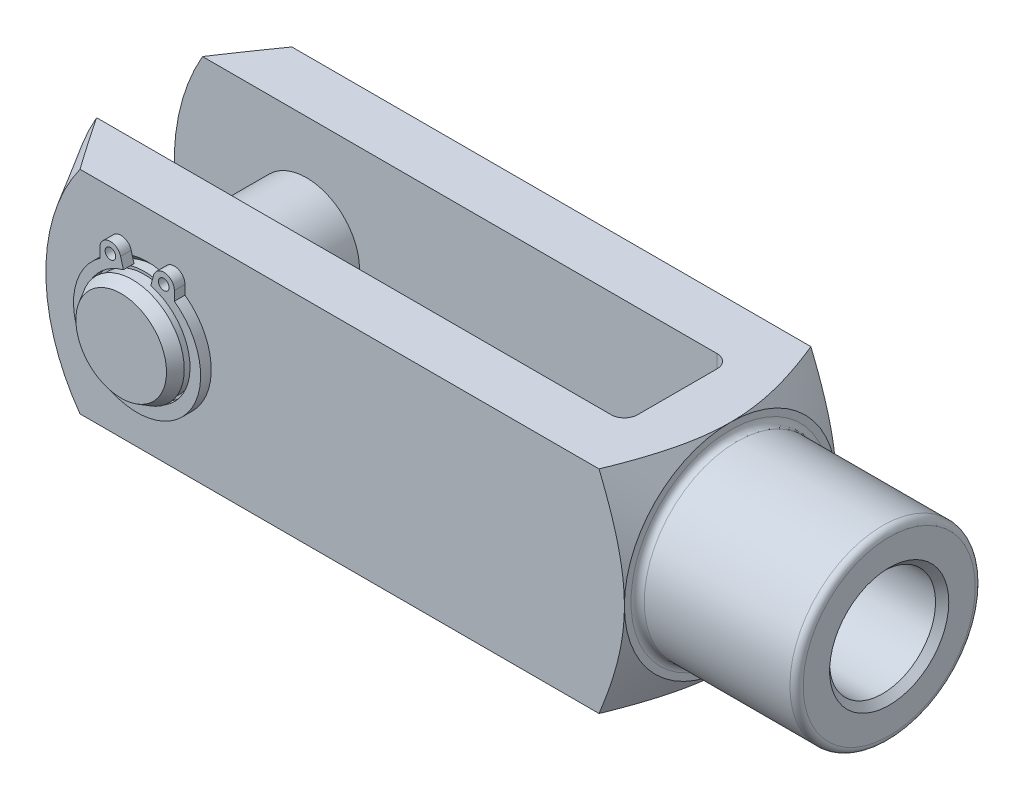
ISO-10303-21;
HEADER;
FILE_DESCRIPTION(('STEP AP214'),'2;1');
FILE_NAME('part.step','',(''),(''),'','','');
FILE_SCHEMA(('AUTOMOTIVE_DESIGN { 1 0 10303 214 1 1 1 1 }'));
ENDSEC;
DATA;
#1=APPLICATION_CONTEXT('core data for automotive mechanical design processes');
#2=APPLICATION_PROTOCOL_DEFINITION('international standard','automotive_design',2000,#1);
#3=PRODUCT_CONTEXT('',#1,'mechanical');
#4=PRODUCT('Part','Part','',(#3));
#5=PRODUCT_RELATED_PRODUCT_CATEGORY('part','',(#4));
#6=PRODUCT_DEFINITION_FORMATION('','',#4);
#7=PRODUCT_DEFINITION_CONTEXT('part definition',#1,'design');
#8=PRODUCT_DEFINITION('design','',#6,#7);
#9=PRODUCT_DEFINITION_SHAPE('','',#8);
#10=(LENGTH_UNIT() NAMED_UNIT(*) SI_UNIT(.MILLI.,.METRE.));
#11=(NAMED_UNIT(*) PLANE_ANGLE_UNIT() SI_UNIT($,.RADIAN.));
#12=(NAMED_UNIT(*) SI_UNIT($,.STERADIAN.) SOLID_ANGLE_UNIT());
#13=UNCERTAINTY_MEASURE_WITH_UNIT(LENGTH_MEASURE(1.E-05),#10,'distance_accuracy_value','');
#14=(GEOMETRIC_REPRESENTATION_CONTEXT(3) GLOBAL_UNCERTAINTY_ASSIGNED_CONTEXT((#13)) GLOBAL_UNIT_ASSIGNED_CONTEXT((#10,
#11,#12)) REPRESENTATION_CONTEXT('',''));
#15=CARTESIAN_POINT('',(0.,0.,0.));
#16=DIRECTION('',(0.,0.,1.));
#17=DIRECTION('',(1.,0.,0.));
#18=AXIS2_PLACEMENT_3D('',#15,#16,#17);
#19=CARTESIAN_POINT('',(-48.,0.,10.));
#20=DIRECTION('',(0.,0.,-1.));
#21=DIRECTION('',(-1.,0.,0.));
#22=AXIS2_PLACEMENT_3D('',#19,#20,#21);
#23=CYLINDRICAL_SURFACE('',#22,4.);
#24=CARTESIAN_POINT('',(-48.,0.,8.25));
#25=DIRECTION('',(0.,0.,1.));
#26=DIRECTION('',(1.,0.,0.));
#27=AXIS2_PLACEMENT_3D('',#24,#25,#26);
#28=CIRCLE('',#27,4.);
#29=CARTESIAN_POINT('',(-44.,0.,8.25));
#30=VERTEX_POINT('',#29);
#31=EDGE_CURVE('P0_E50',#30,#30,#28,.T.);
#32=ORIENTED_EDGE('',*,*,#31,.F.);
#33=EDGE_LOOP('',(#32));
#34=FACE_BOUND('',#33,.T.);
#35=CARTESIAN_POINT('',(-48.,0.,-8.25));
#36=DIRECTION('',(0.,0.,1.));
#37=DIRECTION('',(1.,0.,0.));
#38=AXIS2_PLACEMENT_3D('',#35,#36,#37);
#39=CIRCLE('',#38,4.);
#40=CARTESIAN_POINT('',(-44.,0.,-8.25));
#41=VERTEX_POINT('',#40);
#42=EDGE_CURVE('P0_E39',#41,#41,#39,.T.);
#43=ORIENTED_EDGE('',*,*,#42,.T.);
#44=EDGE_LOOP('',(#43));
#45=FACE_BOUND('',#44,.T.);
#46=ADVANCED_FACE('P0_F14',(#34,#45),#23,.T.);
#47=CARTESIAN_POINT('',(-48.,4.,-9.15));
#48=DIRECTION('',(0.,0.,-1.));
#49=DIRECTION('',(-1.,0.,0.));
#50=AXIS2_PLACEMENT_3D('',#47,#48,#49);
#51=PLANE('',#50);
#52=CARTESIAN_POINT('',(-48.,0.,-9.15));
#53=DIRECTION('',(0.,0.,-1.));
#54=DIRECTION('',(-1.,0.,0.));
#55=AXIS2_PLACEMENT_3D('',#52,#53,#54);
#56=CIRCLE('',#55,3.91339745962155);
#57=CARTESIAN_POINT('',(-51.9133974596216,0.,-9.15));
#58=VERTEX_POINT('',#57);
#59=EDGE_CURVE('P0_E27',#58,#58,#56,.F.);
#60=ORIENTED_EDGE('',*,*,#59,.T.);
#61=EDGE_LOOP('',(#60));
#62=FACE_BOUND('',#61,.T.);
#63=CARTESIAN_POINT('',(-48.,0.,-9.15));
#64=DIRECTION('',(0.,0.,1.));
#65=DIRECTION('',(1.,0.,0.));
#66=AXIS2_PLACEMENT_3D('',#63,#64,#65);
#67=CIRCLE('',#66,3.8);
#68=CARTESIAN_POINT('',(-44.2,0.,-9.15));
#69=VERTEX_POINT('',#68);
#70=EDGE_CURVE('P0_E31',#69,#69,#67,.T.);
#71=ORIENTED_EDGE('',*,*,#70,.F.);
#72=EDGE_LOOP('',(#71));
#73=FACE_BOUND('',#72,.T.);
#74=ADVANCED_FACE('P0_F58',(#62,#73),#51,.F.);
#75=CARTESIAN_POINT('',(-48.,0.,8.99999999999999));
#76=DIRECTION('',(0.,0.,1.));
#77=DIRECTION('',(1.,0.,0.));
#78=AXIS2_PLACEMENT_3D('',#75,#76,#77);
#79=CYLINDRICAL_SURFACE('',#78,3.8);
#80=CARTESIAN_POINT('',(-48.,0.,-8.25));
#81=DIRECTION('',(0.,0.,1.));
#82=DIRECTION('',(1.,0.,0.));
#83=AXIS2_PLACEMENT_3D('',#80,#81,#82);
#84=CIRCLE('',#83,3.8);
#85=CARTESIAN_POINT('',(-44.2,0.,-8.25));
#86=VERTEX_POINT('',#85);
#87=EDGE_CURVE('P0_E35',#86,#86,#84,.T.);
#88=ORIENTED_EDGE('',*,*,#87,.F.);
#89=EDGE_LOOP('',(#88));
#90=FACE_BOUND('',#89,.T.);
#91=ORIENTED_EDGE('',*,*,#70,.T.);
#92=EDGE_LOOP('',(#91));
#93=FACE_BOUND('',#92,.T.);
#94=ADVANCED_FACE('P0_F66',(#90,#93),#79,.T.);
#95=CARTESIAN_POINT('',(-48.,4.,-8.25));
#96=DIRECTION('',(0.,0.,1.));
#97=DIRECTION('',(1.,0.,0.));
#98=AXIS2_PLACEMENT_3D('',#95,#96,#97);
#99=PLANE('',#98);
#100=ORIENTED_EDGE('',*,*,#42,.F.);
#101=EDGE_LOOP('',(#100));
#102=FACE_BOUND('',#101,.T.);
#103=ORIENTED_EDGE('',*,*,#87,.T.);
#104=EDGE_LOOP('',(#103));
#105=FACE_BOUND('',#104,.T.);
#106=ADVANCED_FACE('P0_F62',(#102,#105),#99,.F.);
#107=CARTESIAN_POINT('',(-48.,0.,-10.));
#108=DIRECTION('',(0.,0.,1.));
#109=DIRECTION('',(1.,0.,0.));
#110=AXIS2_PLACEMENT_3D('',#107,#108,#109);
#111=PLANE('',#110);
#112=CARTESIAN_POINT('',(-48.,0.,-10.));
#113=DIRECTION('',(0.,0.,1.));
#114=DIRECTION('',(1.,0.,0.));
#115=AXIS2_PLACEMENT_3D('',#112,#113,#114);
#116=CIRCLE('',#115,3.42264973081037);
#117=CARTESIAN_POINT('',(-44.5773502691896,0.,-10.));
#118=VERTEX_POINT('',#117);
#119=EDGE_CURVE('P0_E22',#118,#118,#116,.F.);
#120=ORIENTED_EDGE('',*,*,#119,.T.);
#121=EDGE_LOOP('',(#120));
#122=FACE_BOUND('',#121,.T.);
#123=ADVANCED_FACE('P0_F65',(#122),#111,.F.);
#124=CARTESIAN_POINT('',(-48.,0.,-8.99999999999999));
#125=DIRECTION('',(0.,0.,1.));
#126=DIRECTION('',(1.,0.,0.));
#127=AXIS2_PLACEMENT_3D('',#124,#125,#126);
#128=CONICAL_SURFACE('',#127,4.,0.523598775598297);
#129=ORIENTED_EDGE('',*,*,#59,.F.);
#130=EDGE_LOOP('',(#129));
#131=FACE_BOUND('',#130,.T.);
#132=ORIENTED_EDGE('',*,*,#119,.F.);
#133=EDGE_LOOP('',(#132));
#134=FACE_BOUND('',#133,.T.);
#135=ADVANCED_FACE('P0_F84',(#131,#134),#128,.T.);
#136=CARTESIAN_POINT('',(-48.,4.,8.25));
#137=DIRECTION('',(0.,0.,-1.));
#138=DIRECTION('',(-1.,0.,0.));
#139=AXIS2_PLACEMENT_3D('',#136,#137,#138);
#140=PLANE('',#139);
#141=CARTESIAN_POINT('',(-48.,0.,8.25));
#142=DIRECTION('',(0.,0.,1.));
#143=DIRECTION('',(1.,0.,0.));
#144=AXIS2_PLACEMENT_3D('',#141,#142,#143);
#145=CIRCLE('',#144,3.8);
#146=CARTESIAN_POINT('',(-44.2,0.,8.25));
#147=VERTEX_POINT('',#146);
#148=EDGE_CURVE('P0_E44',#147,#147,#145,.T.);
#149=ORIENTED_EDGE('',*,*,#148,.F.);
#150=EDGE_LOOP('',(#149));
#151=FACE_BOUND('',#150,.T.);
#152=ORIENTED_EDGE('',*,*,#31,.T.);
#153=EDGE_LOOP('',(#152));
#154=FACE_BOUND('',#153,.T.);
#155=ADVANCED_FACE('P0_F54',(#151,#154),#140,.F.);
#156=CARTESIAN_POINT('',(-48.,0.,8.99999999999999));
#157=DIRECTION('',(0.,0.,1.));
#158=DIRECTION('',(1.,0.,0.));
#159=AXIS2_PLACEMENT_3D('',#156,#157,#158);
#160=CYLINDRICAL_SURFACE('',#159,3.8);
#161=CARTESIAN_POINT('',(-48.,0.,9.15));
#162=DIRECTION('',(0.,0.,1.));
#163=DIRECTION('',(1.,0.,0.));
#164=AXIS2_PLACEMENT_3D('',#161,#162,#163);
#165=CIRCLE('',#164,3.8);
#166=CARTESIAN_POINT('',(-44.2,0.,9.15));
#167=VERTEX_POINT('',#166);
#168=EDGE_CURVE('P0_E47',#167,#167,#165,.T.);
#169=ORIENTED_EDGE('',*,*,#168,.F.);
#170=EDGE_LOOP('',(#169));
#171=FACE_BOUND('',#170,.T.);
#172=ORIENTED_EDGE('',*,*,#148,.T.);
#173=EDGE_LOOP('',(#172));
#174=FACE_BOUND('',#173,.T.);
#175=ADVANCED_FACE('P0_F91',(#171,#174),#160,.T.);
#176=CARTESIAN_POINT('',(-48.,4.,9.15));
#177=DIRECTION('',(0.,0.,1.));
#178=DIRECTION('',(1.,0.,0.));
#179=AXIS2_PLACEMENT_3D('',#176,#177,#178);
#180=PLANE('',#179);
#181=CARTESIAN_POINT('',(-48.,0.,9.15));
#182=DIRECTION('',(0.,0.,1.));
#183=DIRECTION('',(1.,0.,0.));
#184=AXIS2_PLACEMENT_3D('',#181,#182,#183);
#185=CIRCLE('',#184,3.91339745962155);
#186=CARTESIAN_POINT('',(-44.0866025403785,0.,9.15));
#187=VERTEX_POINT('',#186);
#188=EDGE_CURVE('P0_E18',#187,#187,#185,.F.);
#189=ORIENTED_EDGE('',*,*,#188,.T.);
#190=EDGE_LOOP('',(#189));
#191=FACE_BOUND('',#190,.T.);
#192=ORIENTED_EDGE('',*,*,#168,.T.);
#193=EDGE_LOOP('',(#192));
#194=FACE_BOUND('',#193,.T.);
#195=ADVANCED_FACE('P0_F82',(#191,#194),#180,.F.);
#196=CARTESIAN_POINT('',(-48.,0.,10.));
#197=DIRECTION('',(0.,0.,1.));
#198=DIRECTION('',(1.,0.,0.));
#199=AXIS2_PLACEMENT_3D('',#196,#197,#198);
#200=PLANE('',#199);
#201=CARTESIAN_POINT('',(-48.,0.,10.));
#202=DIRECTION('',(0.,0.,1.));
#203=DIRECTION('',(1.,0.,0.));
#204=AXIS2_PLACEMENT_3D('',#201,#202,#203);
#205=CIRCLE('',#204,3.42264973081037);
#206=CARTESIAN_POINT('',(-44.5773502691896,0.,10.));
#207=VERTEX_POINT('',#206);
#208=EDGE_CURVE('P0_E10',#207,#207,#205,.T.);
#209=ORIENTED_EDGE('',*,*,#208,.T.);
#210=EDGE_LOOP('',(#209));
#211=FACE_BOUND('',#210,.T.);
#212=ADVANCED_FACE('P0_F79',(#211),#200,.T.);
#213=CARTESIAN_POINT('',(-48.,0.,10.));
#214=DIRECTION('',(0.,0.,-1.));
#215=DIRECTION('',(-1.,0.,0.));
#216=AXIS2_PLACEMENT_3D('',#213,#214,#215);
#217=CONICAL_SURFACE('',#216,3.42264973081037,0.523598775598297);
#218=ORIENTED_EDGE('',*,*,#188,.F.);
#219=EDGE_LOOP('',(#218));
#220=FACE_BOUND('',#219,.T.);
#221=ORIENTED_EDGE('',*,*,#208,.F.);
#222=EDGE_LOOP('',(#221));
#223=FACE_BOUND('',#222,.T.);
#224=ADVANCED_FACE('P0_F16',(#220,#223),#217,.T.);
#225=CLOSED_SHELL('',(#46,#74,#94,#106,#123,#135,#155,#175,#195,#212,#224));
#226=MANIFOLD_SOLID_BREP('P0_B1',#225);
#227=CARTESIAN_POINT('',(-48.,0.,8.79999999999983));
#228=DIRECTION('',(0.,0.,1.));
#229=DIRECTION('',(1.,0.,0.));
#230=AXIS2_PLACEMENT_3D('',#227,#228,#229);
#231=PLANE('',#230);
#232=CARTESIAN_POINT('',(-50.0150720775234,4.42938873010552,8.79999999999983));
#233=DIRECTION('',(0.,0.,1.));
#234=DIRECTION('',(1.,0.,0.));
#235=AXIS2_PLACEMENT_3D('',#232,#233,#234);
#236=CIRCLE('',#235,0.4);
#237=CARTESIAN_POINT('',(-49.6150720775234,4.42938873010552,8.79999999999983));
#238=VERTEX_POINT('',#237);
#239=EDGE_CURVE('P1_E117',#238,#238,#236,.T.);
#240=ORIENTED_EDGE('',*,*,#239,.F.);
#241=EDGE_LOOP('',(#240));
#242=FACE_BOUND('',#241,.T.);
#243=CARTESIAN_POINT('',(-48.,0.,8.79999999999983));
#244=DIRECTION('',(0.,0.,-1.));
#245=DIRECTION('',(1.,0.,0.));
#246=AXIS2_PLACEMENT_3D('',#243,#244,#245);
#247=CIRCLE('',#246,4.);
#248=CARTESIAN_POINT('',(-46.9647238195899,3.86370330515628,8.79999999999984));
#249=VERTEX_POINT('',#248);
#250=CARTESIAN_POINT('',(-49.0352761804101,3.86370330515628,8.79999999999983));
#251=VERTEX_POINT('',#250);
#252=EDGE_CURVE('P1_E128',#249,#251,#247,.T.);
#253=ORIENTED_EDGE('',*,*,#252,.T.);
#254=DIRECTION('',(-0.258819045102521,0.965925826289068,0.));
#255=VECTOR('',#254,1.);
#256=CARTESIAN_POINT('',(-49.0352761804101,3.86370330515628,8.79999999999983));
#257=LINE('',#256,#255);
#258=CARTESIAN_POINT('',(-49.2423314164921,4.63644396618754,8.79999999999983));
#259=VERTEX_POINT('',#258);
#260=EDGE_CURVE('P1_E76',#251,#259,#257,.T.);
#261=ORIENTED_EDGE('',*,*,#260,.T.);
#262=CARTESIAN_POINT('',(-50.0150720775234,4.42938873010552,8.79999999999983));
#263=DIRECTION('',(0.,0.,1.));
#264=DIRECTION('',(1.,0.,0.));
#265=AXIS2_PLACEMENT_3D('',#262,#263,#264);
#266=CIRCLE('',#265,0.8);
#267=CARTESIAN_POINT('',(-50.8150720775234,4.42938873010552,8.79999999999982));
#268=VERTEX_POINT('',#267);
#269=EDGE_CURVE('P1_E143',#259,#268,#266,.T.);
#270=ORIENTED_EDGE('',*,*,#269,.T.);
#271=DIRECTION('',(0.,-1.,0.));
#272=VECTOR('',#271,1.);
#273=CARTESIAN_POINT('',(-50.8150720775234,4.42938873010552,8.79999999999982));
#274=LINE('',#273,#272);
#275=CARTESIAN_POINT('',(-50.8150720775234,3.72784891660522,8.79999999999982));
#276=VERTEX_POINT('',#275);
#277=EDGE_CURVE('P1_E156',#268,#276,#274,.T.);
#278=ORIENTED_EDGE('',*,*,#277,.T.);
#279=CARTESIAN_POINT('',(-48.,-0.159999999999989,8.79999999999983));
#280=DIRECTION('',(0.,0.,1.));
#281=DIRECTION('',(1.,0.,0.));
#282=AXIS2_PLACEMENT_3D('',#279,#280,#281);
#283=CIRCLE('',#282,4.8);
#284=CARTESIAN_POINT('',(-45.1849279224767,3.72784891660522,8.79999999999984));
#285=VERTEX_POINT('',#284);
#286=EDGE_CURVE('P1_E95',#276,#285,#283,.T.);
#287=ORIENTED_EDGE('',*,*,#286,.T.);
#288=DIRECTION('',(0.,1.,0.));
#289=VECTOR('',#288,1.);
#290=CARTESIAN_POINT('',(-45.1849279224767,4.42938873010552,8.79999999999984));
#291=LINE('',#290,#289);
#292=CARTESIAN_POINT('',(-45.1849279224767,4.42938873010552,8.79999999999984));
#293=VERTEX_POINT('',#292);
#294=EDGE_CURVE('P1_E89',#285,#293,#291,.T.);
#295=ORIENTED_EDGE('',*,*,#294,.T.);
#296=CARTESIAN_POINT('',(-45.9849279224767,4.42938873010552,8.79999999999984));
#297=DIRECTION('',(0.,0.,1.));
#298=DIRECTION('',(-1.,0.,0.));
#299=AXIS2_PLACEMENT_3D('',#296,#297,#298);
#300=CIRCLE('',#299,0.8);
#301=CARTESIAN_POINT('',(-46.7576685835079,4.63644396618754,8.79999999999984));
#302=VERTEX_POINT('',#301);
#303=EDGE_CURVE('P1_E93',#293,#302,#300,.T.);
#304=ORIENTED_EDGE('',*,*,#303,.T.);
#305=DIRECTION('',(-0.258819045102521,-0.965925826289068,0.));
#306=VECTOR('',#305,1.);
#307=CARTESIAN_POINT('',(-46.9647238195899,3.86370330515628,8.79999999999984));
#308=LINE('',#307,#306);
#309=EDGE_CURVE('P1_E33',#302,#249,#308,.T.);
#310=ORIENTED_EDGE('',*,*,#309,.T.);
#311=EDGE_LOOP('',(#253,#261,#270,#278,#287,#295,#304,#310));
#312=FACE_BOUND('',#311,.T.);
#313=CARTESIAN_POINT('',(-45.9849279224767,4.42938873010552,8.79999999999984));
#314=DIRECTION('',(0.,0.,1.));
#315=DIRECTION('',(-1.,0.,0.));
#316=AXIS2_PLACEMENT_3D('',#313,#314,#315);
#317=CIRCLE('',#316,0.4);
#318=CARTESIAN_POINT('',(-46.3849279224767,4.42938873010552,8.79999999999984));
#319=VERTEX_POINT('',#318);
#320=EDGE_CURVE('P1_E165',#319,#319,#317,.T.);
#321=ORIENTED_EDGE('',*,*,#320,.F.);
#322=EDGE_LOOP('',(#321));
#323=FACE_BOUND('',#322,.T.);
#324=ADVANCED_FACE('P1_F16',(#242,#312,#323),#231,.T.);
#325=CARTESIAN_POINT('',(-48.,0.,7.99999999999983));
#326=DIRECTION('',(0.,0.,1.));
#327=DIRECTION('',(1.,0.,0.));
#328=AXIS2_PLACEMENT_3D('',#325,#326,#327);
#329=PLANE('',#328);
#330=CARTESIAN_POINT('',(-50.0150720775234,4.42938873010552,7.99999999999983));
#331=DIRECTION('',(0.,0.,1.));
#332=DIRECTION('',(1.,0.,0.));
#333=AXIS2_PLACEMENT_3D('',#330,#331,#332);
#334=CIRCLE('',#333,0.4);
#335=CARTESIAN_POINT('',(-49.6150720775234,4.42938873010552,7.99999999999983));
#336=VERTEX_POINT('',#335);
#337=EDGE_CURVE('P1_E162',#336,#336,#334,.T.);
#338=ORIENTED_EDGE('',*,*,#337,.T.);
#339=EDGE_LOOP('',(#338));
#340=FACE_BOUND('',#339,.T.);
#341=CARTESIAN_POINT('',(-48.,0.,7.99999999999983));
#342=DIRECTION('',(0.,0.,-1.));
#343=DIRECTION('',(1.,0.,0.));
#344=AXIS2_PLACEMENT_3D('',#341,#342,#343);
#345=CIRCLE('',#344,4.);
#346=CARTESIAN_POINT('',(-46.9647238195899,3.86370330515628,7.99999999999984));
#347=VERTEX_POINT('',#346);
#348=CARTESIAN_POINT('',(-49.0352761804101,3.86370330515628,7.99999999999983));
#349=VERTEX_POINT('',#348);
#350=EDGE_CURVE('P1_E113',#347,#349,#345,.T.);
#351=ORIENTED_EDGE('',*,*,#350,.F.);
#352=DIRECTION('',(-0.258819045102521,-0.965925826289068,0.));
#353=VECTOR('',#352,1.);
#354=CARTESIAN_POINT('',(-46.9647238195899,3.86370330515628,7.99999999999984));
#355=LINE('',#354,#353);
#356=CARTESIAN_POINT('',(-46.7576685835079,4.63644396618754,7.99999999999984));
#357=VERTEX_POINT('',#356);
#358=EDGE_CURVE('P1_E68',#357,#347,#355,.T.);
#359=ORIENTED_EDGE('',*,*,#358,.F.);
#360=CARTESIAN_POINT('',(-45.9849279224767,4.42938873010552,7.99999999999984));
#361=DIRECTION('',(0.,0.,1.));
#362=DIRECTION('',(-1.,0.,0.));
#363=AXIS2_PLACEMENT_3D('',#360,#361,#362);
#364=CIRCLE('',#363,0.8);
#365=CARTESIAN_POINT('',(-45.1849279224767,4.42938873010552,7.99999999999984));
#366=VERTEX_POINT('',#365);
#367=EDGE_CURVE('P1_E62',#366,#357,#364,.T.);
#368=ORIENTED_EDGE('',*,*,#367,.F.);
#369=DIRECTION('',(0.,1.,0.));
#370=VECTOR('',#369,1.);
#371=CARTESIAN_POINT('',(-45.1849279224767,4.42938873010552,7.99999999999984));
#372=LINE('',#371,#370);
#373=CARTESIAN_POINT('',(-45.1849279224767,3.72784891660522,7.99999999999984));
#374=VERTEX_POINT('',#373);
#375=EDGE_CURVE('P1_E103',#374,#366,#372,.T.);
#376=ORIENTED_EDGE('',*,*,#375,.F.);
#377=CARTESIAN_POINT('',(-48.,-0.159999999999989,7.99999999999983));
#378=DIRECTION('',(0.,0.,1.));
#379=DIRECTION('',(1.,0.,0.));
#380=AXIS2_PLACEMENT_3D('',#377,#378,#379);
#381=CIRCLE('',#380,4.8);
#382=CARTESIAN_POINT('',(-50.8150720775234,3.72784891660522,7.99999999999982));
#383=VERTEX_POINT('',#382);
#384=EDGE_CURVE('P1_E123',#383,#374,#381,.T.);
#385=ORIENTED_EDGE('',*,*,#384,.F.);
#386=DIRECTION('',(0.,-1.,0.));
#387=VECTOR('',#386,1.);
#388=CARTESIAN_POINT('',(-50.8150720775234,4.42938873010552,7.99999999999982));
#389=LINE('',#388,#387);
#390=CARTESIAN_POINT('',(-50.8150720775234,4.42938873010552,7.99999999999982));
#391=VERTEX_POINT('',#390);
#392=EDGE_CURVE('P1_E121',#391,#383,#389,.T.);
#393=ORIENTED_EDGE('',*,*,#392,.F.);
#394=CARTESIAN_POINT('',(-50.0150720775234,4.42938873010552,7.99999999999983));
#395=DIRECTION('',(0.,0.,1.));
#396=DIRECTION('',(1.,0.,0.));
#397=AXIS2_PLACEMENT_3D('',#394,#395,#396);
#398=CIRCLE('',#397,0.8);
#399=CARTESIAN_POINT('',(-49.2423314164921,4.63644396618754,7.99999999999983));
#400=VERTEX_POINT('',#399);
#401=EDGE_CURVE('P1_E119',#400,#391,#398,.T.);
#402=ORIENTED_EDGE('',*,*,#401,.F.);
#403=DIRECTION('',(-0.258819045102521,0.965925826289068,0.));
#404=VECTOR('',#403,1.);
#405=CARTESIAN_POINT('',(-49.0352761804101,3.86370330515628,7.99999999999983));
#406=LINE('',#405,#404);
#407=EDGE_CURVE('P1_E116',#349,#400,#406,.T.);
#408=ORIENTED_EDGE('',*,*,#407,.F.);
#409=EDGE_LOOP('',(#351,#359,#368,#376,#385,#393,#402,#408));
#410=FACE_BOUND('',#409,.T.);
#411=CARTESIAN_POINT('',(-45.9849279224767,4.42938873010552,7.99999999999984));
#412=DIRECTION('',(0.,0.,1.));
#413=DIRECTION('',(-1.,0.,0.));
#414=AXIS2_PLACEMENT_3D('',#411,#412,#413);
#415=CIRCLE('',#414,0.4);
#416=CARTESIAN_POINT('',(-46.3849279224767,4.42938873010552,7.99999999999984));
#417=VERTEX_POINT('',#416);
#418=EDGE_CURVE('P1_E168',#417,#417,#415,.T.);
#419=ORIENTED_EDGE('',*,*,#418,.T.);
#420=EDGE_LOOP('',(#419));
#421=FACE_BOUND('',#420,.T.);
#422=ADVANCED_FACE('P1_F147',(#340,#410,#421),#329,.F.);
#423=CARTESIAN_POINT('',(-48.,0.,8.79999999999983));
#424=DIRECTION('',(0.,0.,-1.));
#425=DIRECTION('',(-1.,0.,0.));
#426=AXIS2_PLACEMENT_3D('',#423,#424,#425);
#427=CYLINDRICAL_SURFACE('',#426,4.);
#428=ORIENTED_EDGE('',*,*,#350,.T.);
#429=DIRECTION('',(0.,0.,-1.));
#430=VECTOR('',#429,1.);
#431=CARTESIAN_POINT('',(-49.0352761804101,3.86370330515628,8.79999999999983));
#432=LINE('',#431,#430);
#433=EDGE_CURVE('P1_E11',#251,#349,#432,.T.);
#434=ORIENTED_EDGE('',*,*,#433,.F.);
#435=ORIENTED_EDGE('',*,*,#252,.F.);
#436=DIRECTION('',(0.,0.,-1.));
#437=VECTOR('',#436,1.);
#438=CARTESIAN_POINT('',(-46.9647238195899,3.86370330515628,8.79999999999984));
#439=LINE('',#438,#437);
#440=EDGE_CURVE('P1_E109',#249,#347,#439,.T.);
#441=ORIENTED_EDGE('',*,*,#440,.T.);
#442=EDGE_LOOP('',(#428,#434,#435,#441));
#443=FACE_BOUND('',#442,.T.);
#444=ADVANCED_FACE('P1_F18',(#443),#427,.F.);
#445=CARTESIAN_POINT('',(-49.0352761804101,3.86370330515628,8.79999999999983));
#446=DIRECTION('',(-0.965925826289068,-0.258819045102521,0.));
#447=DIRECTION('',(0.258819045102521,-0.965925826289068,0.));
#448=AXIS2_PLACEMENT_3D('',#445,#446,#447);
#449=PLANE('',#448);
#450=ORIENTED_EDGE('',*,*,#407,.T.);
#451=DIRECTION('',(0.,0.,-1.));
#452=VECTOR('',#451,1.);
#453=CARTESIAN_POINT('',(-49.2423314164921,4.63644396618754,8.79999999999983));
#454=LINE('',#453,#452);
#455=EDGE_CURVE('P1_E25',#259,#400,#454,.T.);
#456=ORIENTED_EDGE('',*,*,#455,.F.);
#457=ORIENTED_EDGE('',*,*,#260,.F.);
#458=ORIENTED_EDGE('',*,*,#433,.T.);
#459=EDGE_LOOP('',(#450,#456,#457,#458));
#460=FACE_BOUND('',#459,.T.);
#461=ADVANCED_FACE('P1_F202',(#460),#449,.F.);
#462=CARTESIAN_POINT('',(-50.0150720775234,4.42938873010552,8.79999999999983));
#463=DIRECTION('',(0.,0.,-1.));
#464=DIRECTION('',(-1.,0.,0.));
#465=AXIS2_PLACEMENT_3D('',#462,#463,#464);
#466=CYLINDRICAL_SURFACE('',#465,0.8);
#467=ORIENTED_EDGE('',*,*,#401,.T.);
#468=DIRECTION('',(0.,0.,-1.));
#469=VECTOR('',#468,1.);
#470=CARTESIAN_POINT('',(-50.8150720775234,4.42938873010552,8.79999999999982));
#471=LINE('',#470,#469);
#472=EDGE_CURVE('P1_E135',#268,#391,#471,.T.);
#473=ORIENTED_EDGE('',*,*,#472,.F.);
#474=ORIENTED_EDGE('',*,*,#269,.F.);
#475=ORIENTED_EDGE('',*,*,#455,.T.);
#476=EDGE_LOOP('',(#467,#473,#474,#475));
#477=FACE_BOUND('',#476,.T.);
#478=ADVANCED_FACE('P1_F141',(#477),#466,.T.);
#479=CARTESIAN_POINT('',(-50.8150720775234,4.42938873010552,8.79999999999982));
#480=DIRECTION('',(1.,0.,0.));
#481=DIRECTION('',(0.,1.,0.));
#482=AXIS2_PLACEMENT_3D('',#479,#480,#481);
#483=PLANE('',#482);
#484=ORIENTED_EDGE('',*,*,#392,.T.);
#485=DIRECTION('',(0.,0.,-1.));
#486=VECTOR('',#485,1.);
#487=CARTESIAN_POINT('',(-50.8150720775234,3.72784891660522,8.79999999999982));
#488=LINE('',#487,#486);
#489=EDGE_CURVE('P1_E132',#276,#383,#488,.T.);
#490=ORIENTED_EDGE('',*,*,#489,.F.);
#491=ORIENTED_EDGE('',*,*,#277,.F.);
#492=ORIENTED_EDGE('',*,*,#472,.T.);
#493=EDGE_LOOP('',(#484,#490,#491,#492));
#494=FACE_BOUND('',#493,.T.);
#495=ADVANCED_FACE('P1_F152',(#494),#483,.F.);
#496=CARTESIAN_POINT('',(-48.,-0.159999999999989,8.79999999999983));
#497=DIRECTION('',(0.,0.,-1.));
#498=DIRECTION('',(-1.,0.,0.));
#499=AXIS2_PLACEMENT_3D('',#496,#497,#498);
#500=CYLINDRICAL_SURFACE('',#499,4.8);
#501=ORIENTED_EDGE('',*,*,#384,.T.);
#502=DIRECTION('',(0.,0.,-1.));
#503=VECTOR('',#502,1.);
#504=CARTESIAN_POINT('',(-45.1849279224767,3.72784891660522,8.79999999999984));
#505=LINE('',#504,#503);
#506=EDGE_CURVE('P1_E104',#285,#374,#505,.T.);
#507=ORIENTED_EDGE('',*,*,#506,.F.);
#508=ORIENTED_EDGE('',*,*,#286,.F.);
#509=ORIENTED_EDGE('',*,*,#489,.T.);
#510=EDGE_LOOP('',(#501,#507,#508,#509));
#511=FACE_BOUND('',#510,.T.);
#512=ADVANCED_FACE('P1_F155',(#511),#500,.T.);
#513=CARTESIAN_POINT('',(-45.1849279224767,4.42938873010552,8.79999999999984));
#514=DIRECTION('',(-1.,0.,0.));
#515=DIRECTION('',(0.,-1.,0.));
#516=AXIS2_PLACEMENT_3D('',#513,#514,#515);
#517=PLANE('',#516);
#518=ORIENTED_EDGE('',*,*,#375,.T.);
#519=DIRECTION('',(0.,0.,-1.));
#520=VECTOR('',#519,1.);
#521=CARTESIAN_POINT('',(-45.1849279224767,4.42938873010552,8.79999999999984));
#522=LINE('',#521,#520);
#523=EDGE_CURVE('P1_E100',#293,#366,#522,.T.);
#524=ORIENTED_EDGE('',*,*,#523,.F.);
#525=ORIENTED_EDGE('',*,*,#294,.F.);
#526=ORIENTED_EDGE('',*,*,#506,.T.);
#527=EDGE_LOOP('',(#518,#524,#525,#526));
#528=FACE_BOUND('',#527,.T.);
#529=ADVANCED_FACE('P1_F101',(#528),#517,.F.);
#530=CARTESIAN_POINT('',(-45.9849279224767,4.42938873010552,8.79999999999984));
#531=DIRECTION('',(0.,0.,-1.));
#532=DIRECTION('',(-1.,0.,0.));
#533=AXIS2_PLACEMENT_3D('',#530,#531,#532);
#534=CYLINDRICAL_SURFACE('',#533,0.8);
#535=ORIENTED_EDGE('',*,*,#367,.T.);
#536=DIRECTION('',(0.,0.,-1.));
#537=VECTOR('',#536,1.);
#538=CARTESIAN_POINT('',(-46.7576685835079,4.63644396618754,8.79999999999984));
#539=LINE('',#538,#537);
#540=EDGE_CURVE('P1_E105',#302,#357,#539,.T.);
#541=ORIENTED_EDGE('',*,*,#540,.F.);
#542=ORIENTED_EDGE('',*,*,#303,.F.);
#543=ORIENTED_EDGE('',*,*,#523,.T.);
#544=EDGE_LOOP('',(#535,#541,#542,#543));
#545=FACE_BOUND('',#544,.T.);
#546=ADVANCED_FACE('P1_F107',(#545),#534,.T.);
#547=CARTESIAN_POINT('',(-46.9647238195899,3.86370330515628,8.79999999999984));
#548=DIRECTION('',(0.965925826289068,-0.258819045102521,0.));
#549=DIRECTION('',(0.258819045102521,0.965925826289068,0.));
#550=AXIS2_PLACEMENT_3D('',#547,#548,#549);
#551=PLANE('',#550);
#552=ORIENTED_EDGE('',*,*,#358,.T.);
#553=ORIENTED_EDGE('',*,*,#440,.F.);
#554=ORIENTED_EDGE('',*,*,#309,.F.);
#555=ORIENTED_EDGE('',*,*,#540,.T.);
#556=EDGE_LOOP('',(#552,#553,#554,#555));
#557=FACE_BOUND('',#556,.T.);
#558=ADVANCED_FACE('P1_F190',(#557),#551,.F.);
#559=CARTESIAN_POINT('',(-50.0150720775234,4.42938873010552,8.79999999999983));
#560=DIRECTION('',(0.,0.,-1.));
#561=DIRECTION('',(-1.,0.,0.));
#562=AXIS2_PLACEMENT_3D('',#559,#560,#561);
#563=CYLINDRICAL_SURFACE('',#562,0.4);
#564=ORIENTED_EDGE('',*,*,#239,.T.);
#565=EDGE_LOOP('',(#564));
#566=FACE_BOUND('',#565,.T.);
#567=ORIENTED_EDGE('',*,*,#337,.F.);
#568=EDGE_LOOP('',(#567));
#569=FACE_BOUND('',#568,.T.);
#570=ADVANCED_FACE('P1_F187',(#566,#569),#563,.F.);
#571=CARTESIAN_POINT('',(-45.9849279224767,4.42938873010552,8.79999999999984));
#572=DIRECTION('',(0.,0.,-1.));
#573=DIRECTION('',(-1.,0.,0.));
#574=AXIS2_PLACEMENT_3D('',#571,#572,#573);
#575=CYLINDRICAL_SURFACE('',#574,0.4);
#576=ORIENTED_EDGE('',*,*,#320,.T.);
#577=EDGE_LOOP('',(#576));
#578=FACE_BOUND('',#577,.T.);
#579=ORIENTED_EDGE('',*,*,#418,.F.);
#580=EDGE_LOOP('',(#579));
#581=FACE_BOUND('',#580,.T.);
#582=ADVANCED_FACE('P1_F174',(#578,#581),#575,.F.);
#583=CLOSED_SHELL('',(#324,#422,#444,#461,#478,#495,#512,#529,#546,#558,#570,#582));
#584=MANIFOLD_SOLID_BREP('P1_B1',#583);
#585=CARTESIAN_POINT('',(-48.,0.,-8.79999999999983));
#586=DIRECTION('',(0.,0.,-1.));
#587=DIRECTION('',(-1.,0.,0.));
#588=AXIS2_PLACEMENT_3D('',#585,#586,#587);
#589=PLANE('',#588);
#590=CARTESIAN_POINT('',(-45.9849279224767,4.4293887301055,-8.79999999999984));
#591=DIRECTION('',(0.,0.,-1.));
#592=DIRECTION('',(-1.,0.,0.));
#593=AXIS2_PLACEMENT_3D('',#590,#591,#592);
#594=CIRCLE('',#593,0.4);
#595=CARTESIAN_POINT('',(-46.3849279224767,4.4293887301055,-8.79999999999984));
#596=VERTEX_POINT('',#595);
#597=EDGE_CURVE('P2_E117',#596,#596,#594,.T.);
#598=ORIENTED_EDGE('',*,*,#597,.F.);
#599=EDGE_LOOP('',(#598));
#600=FACE_BOUND('',#599,.T.);
#601=CARTESIAN_POINT('',(-48.,0.,-8.79999999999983));
#602=DIRECTION('',(0.,0.,1.));
#603=DIRECTION('',(-1.,0.,0.));
#604=AXIS2_PLACEMENT_3D('',#601,#602,#603);
#605=CIRCLE('',#604,4.);
#606=CARTESIAN_POINT('',(-49.0352761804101,3.86370330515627,-8.79999999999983));
#607=VERTEX_POINT('',#606);
#608=CARTESIAN_POINT('',(-46.9647238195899,3.86370330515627,-8.79999999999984));
#609=VERTEX_POINT('',#608);
#610=EDGE_CURVE('P2_E128',#607,#609,#605,.T.);
#611=ORIENTED_EDGE('',*,*,#610,.T.);
#612=DIRECTION('',(0.258819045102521,0.965925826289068,0.));
#613=VECTOR('',#612,1.);
#614=CARTESIAN_POINT('',(-46.9647238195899,3.86370330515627,-8.79999999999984));
#615=LINE('',#614,#613);
#616=CARTESIAN_POINT('',(-46.7576685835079,4.63644396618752,-8.79999999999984));
#617=VERTEX_POINT('',#616);
#618=EDGE_CURVE('P2_E76',#609,#617,#615,.T.);
#619=ORIENTED_EDGE('',*,*,#618,.T.);
#620=CARTESIAN_POINT('',(-45.9849279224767,4.4293887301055,-8.79999999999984));
#621=DIRECTION('',(0.,0.,-1.));
#622=DIRECTION('',(-1.,0.,0.));
#623=AXIS2_PLACEMENT_3D('',#620,#621,#622);
#624=CIRCLE('',#623,0.8);
#625=CARTESIAN_POINT('',(-45.1849279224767,4.4293887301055,-8.79999999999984));
#626=VERTEX_POINT('',#625);
#627=EDGE_CURVE('P2_E143',#617,#626,#624,.T.);
#628=ORIENTED_EDGE('',*,*,#627,.T.);
#629=DIRECTION('',(0.,-1.,0.));
#630=VECTOR('',#629,1.);
#631=CARTESIAN_POINT('',(-45.1849279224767,4.4293887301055,-8.79999999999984));
#632=LINE('',#631,#630);
#633=CARTESIAN_POINT('',(-45.1849279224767,3.7278489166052,-8.79999999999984));
#634=VERTEX_POINT('',#633);
#635=EDGE_CURVE('P2_E156',#626,#634,#632,.T.);
#636=ORIENTED_EDGE('',*,*,#635,.T.);
#637=CARTESIAN_POINT('',(-48.,-0.160000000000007,-8.79999999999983));
#638=DIRECTION('',(0.,0.,-1.));
#639=DIRECTION('',(-1.,0.,0.));
#640=AXIS2_PLACEMENT_3D('',#637,#638,#639);
#641=CIRCLE('',#640,4.8);
#642=CARTESIAN_POINT('',(-50.8150720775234,3.7278489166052,-8.79999999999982));
#643=VERTEX_POINT('',#642);
#644=EDGE_CURVE('P2_E95',#634,#643,#641,.T.);
#645=ORIENTED_EDGE('',*,*,#644,.T.);
#646=DIRECTION('',(0.,1.,0.));
#647=VECTOR('',#646,1.);
#648=CARTESIAN_POINT('',(-50.8150720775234,4.4293887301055,-8.79999999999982));
#649=LINE('',#648,#647);
#650=CARTESIAN_POINT('',(-50.8150720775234,4.4293887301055,-8.79999999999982));
#651=VERTEX_POINT('',#650);
#652=EDGE_CURVE('P2_E89',#643,#651,#649,.T.);
#653=ORIENTED_EDGE('',*,*,#652,.T.);
#654=CARTESIAN_POINT('',(-50.0150720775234,4.4293887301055,-8.79999999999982));
#655=DIRECTION('',(0.,0.,-1.));
#656=DIRECTION('',(1.,0.,0.));
#657=AXIS2_PLACEMENT_3D('',#654,#655,#656);
#658=CIRCLE('',#657,0.8);
#659=CARTESIAN_POINT('',(-49.2423314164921,4.63644396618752,-8.79999999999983));
#660=VERTEX_POINT('',#659);
#661=EDGE_CURVE('P2_E93',#651,#660,#658,.T.);
#662=ORIENTED_EDGE('',*,*,#661,.T.);
#663=DIRECTION('',(0.258819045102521,-0.965925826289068,0.));
#664=VECTOR('',#663,1.);
#665=CARTESIAN_POINT('',(-49.0352761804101,3.86370330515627,-8.79999999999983));
#666=LINE('',#665,#664);
#667=EDGE_CURVE('P2_E33',#660,#607,#666,.T.);
#668=ORIENTED_EDGE('',*,*,#667,.T.);
#669=EDGE_LOOP('',(#611,#619,#628,#636,#645,#653,#662,#668));
#670=FACE_BOUND('',#669,.T.);
#671=CARTESIAN_POINT('',(-50.0150720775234,4.4293887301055,-8.79999999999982));
#672=DIRECTION('',(0.,0.,-1.));
#673=DIRECTION('',(1.,0.,0.));
#674=AXIS2_PLACEMENT_3D('',#671,#672,#673);
#675=CIRCLE('',#674,0.4);
#676=CARTESIAN_POINT('',(-49.6150720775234,4.4293887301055,-8.79999999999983));
#677=VERTEX_POINT('',#676);
#678=EDGE_CURVE('P2_E165',#677,#677,#675,.T.);
#679=ORIENTED_EDGE('',*,*,#678,.F.);
#680=EDGE_LOOP('',(#679));
#681=FACE_BOUND('',#680,.T.);
#682=ADVANCED_FACE('P2_F16',(#600,#670,#681),#589,.T.);
#683=CARTESIAN_POINT('',(-48.,0.,-7.99999999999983));
#684=DIRECTION('',(0.,0.,-1.));
#685=DIRECTION('',(-1.,0.,0.));
#686=AXIS2_PLACEMENT_3D('',#683,#684,#685);
#687=PLANE('',#686);
#688=CARTESIAN_POINT('',(-45.9849279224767,4.4293887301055,-7.99999999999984));
#689=DIRECTION('',(0.,0.,-1.));
#690=DIRECTION('',(-1.,0.,0.));
#691=AXIS2_PLACEMENT_3D('',#688,#689,#690);
#692=CIRCLE('',#691,0.4);
#693=CARTESIAN_POINT('',(-46.3849279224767,4.4293887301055,-7.99999999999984));
#694=VERTEX_POINT('',#693);
#695=EDGE_CURVE('P2_E162',#694,#694,#692,.T.);
#696=ORIENTED_EDGE('',*,*,#695,.T.);
#697=EDGE_LOOP('',(#696));
#698=FACE_BOUND('',#697,.T.);
#699=CARTESIAN_POINT('',(-48.,0.,-7.99999999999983));
#700=DIRECTION('',(0.,0.,1.));
#701=DIRECTION('',(-1.,0.,0.));
#702=AXIS2_PLACEMENT_3D('',#699,#700,#701);
#703=CIRCLE('',#702,4.);
#704=CARTESIAN_POINT('',(-49.0352761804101,3.86370330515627,-7.99999999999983));
#705=VERTEX_POINT('',#704);
#706=CARTESIAN_POINT('',(-46.9647238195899,3.86370330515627,-7.99999999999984));
#707=VERTEX_POINT('',#706);
#708=EDGE_CURVE('P2_E113',#705,#707,#703,.T.);
#709=ORIENTED_EDGE('',*,*,#708,.F.);
#710=DIRECTION('',(0.258819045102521,-0.965925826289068,0.));
#711=VECTOR('',#710,1.);
#712=CARTESIAN_POINT('',(-49.0352761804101,3.86370330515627,-7.99999999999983));
#713=LINE('',#712,#711);
#714=CARTESIAN_POINT('',(-49.2423314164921,4.63644396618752,-7.99999999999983));
#715=VERTEX_POINT('',#714);
#716=EDGE_CURVE('P2_E68',#715,#705,#713,.T.);
#717=ORIENTED_EDGE('',*,*,#716,.F.);
#718=CARTESIAN_POINT('',(-50.0150720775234,4.4293887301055,-7.99999999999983));
#719=DIRECTION('',(0.,0.,-1.));
#720=DIRECTION('',(1.,0.,0.));
#721=AXIS2_PLACEMENT_3D('',#718,#719,#720);
#722=CIRCLE('',#721,0.8);
#723=CARTESIAN_POINT('',(-50.8150720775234,4.4293887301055,-7.99999999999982));
#724=VERTEX_POINT('',#723);
#725=EDGE_CURVE('P2_E62',#724,#715,#722,.T.);
#726=ORIENTED_EDGE('',*,*,#725,.F.);
#727=DIRECTION('',(0.,1.,0.));
#728=VECTOR('',#727,1.);
#729=CARTESIAN_POINT('',(-50.8150720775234,4.4293887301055,-7.99999999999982));
#730=LINE('',#729,#728);
#731=CARTESIAN_POINT('',(-50.8150720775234,3.7278489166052,-7.99999999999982));
#732=VERTEX_POINT('',#731);
#733=EDGE_CURVE('P2_E103',#732,#724,#730,.T.);
#734=ORIENTED_EDGE('',*,*,#733,.F.);
#735=CARTESIAN_POINT('',(-48.,-0.160000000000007,-7.99999999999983));
#736=DIRECTION('',(0.,0.,-1.));
#737=DIRECTION('',(-1.,0.,0.));
#738=AXIS2_PLACEMENT_3D('',#735,#736,#737);
#739=CIRCLE('',#738,4.8);
#740=CARTESIAN_POINT('',(-45.1849279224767,3.7278489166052,-7.99999999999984));
#741=VERTEX_POINT('',#740);
#742=EDGE_CURVE('P2_E123',#741,#732,#739,.T.);
#743=ORIENTED_EDGE('',*,*,#742,.F.);
#744=DIRECTION('',(0.,-1.,0.));
#745=VECTOR('',#744,1.);
#746=CARTESIAN_POINT('',(-45.1849279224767,4.4293887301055,-7.99999999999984));
#747=LINE('',#746,#745);
#748=CARTESIAN_POINT('',(-45.1849279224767,4.4293887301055,-7.99999999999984));
#749=VERTEX_POINT('',#748);
#750=EDGE_CURVE('P2_E121',#749,#741,#747,.T.);
#751=ORIENTED_EDGE('',*,*,#750,.F.);
#752=CARTESIAN_POINT('',(-45.9849279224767,4.4293887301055,-7.99999999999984));
#753=DIRECTION('',(0.,0.,-1.));
#754=DIRECTION('',(-1.,0.,0.));
#755=AXIS2_PLACEMENT_3D('',#752,#753,#754);
#756=CIRCLE('',#755,0.8);
#757=CARTESIAN_POINT('',(-46.7576685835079,4.63644396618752,-7.99999999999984));
#758=VERTEX_POINT('',#757);
#759=EDGE_CURVE('P2_E119',#758,#749,#756,.T.);
#760=ORIENTED_EDGE('',*,*,#759,.F.);
#761=DIRECTION('',(0.258819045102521,0.965925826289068,0.));
#762=VECTOR('',#761,1.);
#763=CARTESIAN_POINT('',(-46.9647238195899,3.86370330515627,-7.99999999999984));
#764=LINE('',#763,#762);
#765=EDGE_CURVE('P2_E116',#707,#758,#764,.T.);
#766=ORIENTED_EDGE('',*,*,#765,.F.);
#767=EDGE_LOOP('',(#709,#717,#726,#734,#743,#751,#760,#766));
#768=FACE_BOUND('',#767,.T.);
#769=CARTESIAN_POINT('',(-50.0150720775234,4.4293887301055,-7.99999999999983));
#770=DIRECTION('',(0.,0.,-1.));
#771=DIRECTION('',(1.,0.,0.));
#772=AXIS2_PLACEMENT_3D('',#769,#770,#771);
#773=CIRCLE('',#772,0.4);
#774=CARTESIAN_POINT('',(-49.6150720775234,4.4293887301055,-7.99999999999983));
#775=VERTEX_POINT('',#774);
#776=EDGE_CURVE('P2_E168',#775,#775,#773,.T.);
#777=ORIENTED_EDGE('',*,*,#776,.T.);
#778=EDGE_LOOP('',(#777));
#779=FACE_BOUND('',#778,.T.);
#780=ADVANCED_FACE('P2_F147',(#698,#768,#779),#687,.F.);
#781=CARTESIAN_POINT('',(-48.,0.,-8.79999999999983));
#782=DIRECTION('',(0.,0.,1.));
#783=DIRECTION('',(1.,0.,0.));
#784=AXIS2_PLACEMENT_3D('',#781,#782,#783);
#785=CYLINDRICAL_SURFACE('',#784,4.);
#786=ORIENTED_EDGE('',*,*,#708,.T.);
#787=DIRECTION('',(0.,0.,1.));
#788=VECTOR('',#787,1.);
#789=CARTESIAN_POINT('',(-46.9647238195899,3.86370330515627,-8.79999999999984));
#790=LINE('',#789,#788);
#791=EDGE_CURVE('P2_E11',#609,#707,#790,.T.);
#792=ORIENTED_EDGE('',*,*,#791,.F.);
#793=ORIENTED_EDGE('',*,*,#610,.F.);
#794=DIRECTION('',(0.,0.,1.));
#795=VECTOR('',#794,1.);
#796=CARTESIAN_POINT('',(-49.0352761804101,3.86370330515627,-8.79999999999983));
#797=LINE('',#796,#795);
#798=EDGE_CURVE('P2_E109',#607,#705,#797,.T.);
#799=ORIENTED_EDGE('',*,*,#798,.T.);
#800=EDGE_LOOP('',(#786,#792,#793,#799));
#801=FACE_BOUND('',#800,.T.);
#802=ADVANCED_FACE('P2_F18',(#801),#785,.F.);
#803=CARTESIAN_POINT('',(-46.9647238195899,3.86370330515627,-8.79999999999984));
#804=DIRECTION('',(0.965925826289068,-0.258819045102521,0.));
#805=DIRECTION('',(-0.258819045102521,-0.965925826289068,0.));
#806=AXIS2_PLACEMENT_3D('',#803,#804,#805);
#807=PLANE('',#806);
#808=ORIENTED_EDGE('',*,*,#765,.T.);
#809=DIRECTION('',(0.,0.,1.));
#810=VECTOR('',#809,1.);
#811=CARTESIAN_POINT('',(-46.7576685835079,4.63644396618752,-8.79999999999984));
#812=LINE('',#811,#810);
#813=EDGE_CURVE('P2_E25',#617,#758,#812,.T.);
#814=ORIENTED_EDGE('',*,*,#813,.F.);
#815=ORIENTED_EDGE('',*,*,#618,.F.);
#816=ORIENTED_EDGE('',*,*,#791,.T.);
#817=EDGE_LOOP('',(#808,#814,#815,#816));
#818=FACE_BOUND('',#817,.T.);
#819=ADVANCED_FACE('P2_F202',(#818),#807,.F.);
#820=CARTESIAN_POINT('',(-45.9849279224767,4.4293887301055,-8.79999999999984));
#821=DIRECTION('',(0.,0.,1.));
#822=DIRECTION('',(1.,0.,0.));
#823=AXIS2_PLACEMENT_3D('',#820,#821,#822);
#824=CYLINDRICAL_SURFACE('',#823,0.8);
#825=ORIENTED_EDGE('',*,*,#759,.T.);
#826=DIRECTION('',(0.,0.,1.));
#827=VECTOR('',#826,1.);
#828=CARTESIAN_POINT('',(-45.1849279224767,4.4293887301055,-8.79999999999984));
#829=LINE('',#828,#827);
#830=EDGE_CURVE('P2_E135',#626,#749,#829,.T.);
#831=ORIENTED_EDGE('',*,*,#830,.F.);
#832=ORIENTED_EDGE('',*,*,#627,.F.);
#833=ORIENTED_EDGE('',*,*,#813,.T.);
#834=EDGE_LOOP('',(#825,#831,#832,#833));
#835=FACE_BOUND('',#834,.T.);
#836=ADVANCED_FACE('P2_F141',(#835),#824,.T.);
#837=CARTESIAN_POINT('',(-45.1849279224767,4.4293887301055,-8.79999999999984));
#838=DIRECTION('',(-1.,0.,0.));
#839=DIRECTION('',(0.,1.,0.));
#840=AXIS2_PLACEMENT_3D('',#837,#838,#839);
#841=PLANE('',#840);
#842=ORIENTED_EDGE('',*,*,#750,.T.);
#843=DIRECTION('',(0.,0.,1.));
#844=VECTOR('',#843,1.);
#845=CARTESIAN_POINT('',(-45.1849279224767,3.7278489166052,-8.79999999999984));
#846=LINE('',#845,#844);
#847=EDGE_CURVE('P2_E132',#634,#741,#846,.T.);
#848=ORIENTED_EDGE('',*,*,#847,.F.);
#849=ORIENTED_EDGE('',*,*,#635,.F.);
#850=ORIENTED_EDGE('',*,*,#830,.T.);
#851=EDGE_LOOP('',(#842,#848,#849,#850));
#852=FACE_BOUND('',#851,.T.);
#853=ADVANCED_FACE('P2_F152',(#852),#841,.F.);
#854=CARTESIAN_POINT('',(-48.,-0.160000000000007,-8.79999999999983));
#855=DIRECTION('',(0.,0.,1.));
#856=DIRECTION('',(1.,0.,0.));
#857=AXIS2_PLACEMENT_3D('',#854,#855,#856);
#858=CYLINDRICAL_SURFACE('',#857,4.8);
#859=ORIENTED_EDGE('',*,*,#742,.T.);
#860=DIRECTION('',(0.,0.,1.));
#861=VECTOR('',#860,1.);
#862=CARTESIAN_POINT('',(-50.8150720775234,3.7278489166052,-8.79999999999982));
#863=LINE('',#862,#861);
#864=EDGE_CURVE('P2_E104',#643,#732,#863,.T.);
#865=ORIENTED_EDGE('',*,*,#864,.F.);
#866=ORIENTED_EDGE('',*,*,#644,.F.);
#867=ORIENTED_EDGE('',*,*,#847,.T.);
#868=EDGE_LOOP('',(#859,#865,#866,#867));
#869=FACE_BOUND('',#868,.T.);
#870=ADVANCED_FACE('P2_F155',(#869),#858,.T.);
#871=CARTESIAN_POINT('',(-50.8150720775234,4.4293887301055,-8.79999999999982));
#872=DIRECTION('',(1.,0.,0.));
#873=DIRECTION('',(0.,-1.,0.));
#874=AXIS2_PLACEMENT_3D('',#871,#872,#873);
#875=PLANE('',#874);
#876=ORIENTED_EDGE('',*,*,#733,.T.);
#877=DIRECTION('',(0.,0.,1.));
#878=VECTOR('',#877,1.);
#879=CARTESIAN_POINT('',(-50.8150720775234,4.4293887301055,-8.79999999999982));
#880=LINE('',#879,#878);
#881=EDGE_CURVE('P2_E100',#651,#724,#880,.T.);
#882=ORIENTED_EDGE('',*,*,#881,.F.);
#883=ORIENTED_EDGE('',*,*,#652,.F.);
#884=ORIENTED_EDGE('',*,*,#864,.T.);
#885=EDGE_LOOP('',(#876,#882,#883,#884));
#886=FACE_BOUND('',#885,.T.);
#887=ADVANCED_FACE('P2_F101',(#886),#875,.F.);
#888=CARTESIAN_POINT('',(-50.0150720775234,4.4293887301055,-8.79999999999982));
#889=DIRECTION('',(0.,0.,1.));
#890=DIRECTION('',(1.,0.,0.));
#891=AXIS2_PLACEMENT_3D('',#888,#889,#890);
#892=CYLINDRICAL_SURFACE('',#891,0.8);
#893=ORIENTED_EDGE('',*,*,#725,.T.);
#894=DIRECTION('',(0.,0.,1.));
#895=VECTOR('',#894,1.);
#896=CARTESIAN_POINT('',(-49.2423314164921,4.63644396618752,-8.79999999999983));
#897=LINE('',#896,#895);
#898=EDGE_CURVE('P2_E105',#660,#715,#897,.T.);
#899=ORIENTED_EDGE('',*,*,#898,.F.);
#900=ORIENTED_EDGE('',*,*,#661,.F.);
#901=ORIENTED_EDGE('',*,*,#881,.T.);
#902=EDGE_LOOP('',(#893,#899,#900,#901));
#903=FACE_BOUND('',#902,.T.);
#904=ADVANCED_FACE('P2_F107',(#903),#892,.T.);
#905=CARTESIAN_POINT('',(-49.0352761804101,3.86370330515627,-8.79999999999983));
#906=DIRECTION('',(-0.965925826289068,-0.258819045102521,0.));
#907=DIRECTION('',(-0.258819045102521,0.965925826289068,0.));
#908=AXIS2_PLACEMENT_3D('',#905,#906,#907);
#909=PLANE('',#908);
#910=ORIENTED_EDGE('',*,*,#716,.T.);
#911=ORIENTED_EDGE('',*,*,#798,.F.);
#912=ORIENTED_EDGE('',*,*,#667,.F.);
#913=ORIENTED_EDGE('',*,*,#898,.T.);
#914=EDGE_LOOP('',(#910,#911,#912,#913));
#915=FACE_BOUND('',#914,.T.);
#916=ADVANCED_FACE('P2_F190',(#915),#909,.F.);
#917=CARTESIAN_POINT('',(-45.9849279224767,4.4293887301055,-8.79999999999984));
#918=DIRECTION('',(0.,0.,1.));
#919=DIRECTION('',(1.,0.,0.));
#920=AXIS2_PLACEMENT_3D('',#917,#918,#919);
#921=CYLINDRICAL_SURFACE('',#920,0.4);
#922=ORIENTED_EDGE('',*,*,#597,.T.);
#923=EDGE_LOOP('',(#922));
#924=FACE_BOUND('',#923,.T.);
#925=ORIENTED_EDGE('',*,*,#695,.F.);
#926=EDGE_LOOP('',(#925));
#927=FACE_BOUND('',#926,.T.);
#928=ADVANCED_FACE('P2_F187',(#924,#927),#921,.F.);
#929=CARTESIAN_POINT('',(-50.0150720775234,4.4293887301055,-8.79999999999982));
#930=DIRECTION('',(0.,0.,1.));
#931=DIRECTION('',(1.,0.,0.));
#932=AXIS2_PLACEMENT_3D('',#929,#930,#931);
#933=CYLINDRICAL_SURFACE('',#932,0.4);
#934=ORIENTED_EDGE('',*,*,#678,.T.);
#935=EDGE_LOOP('',(#934));
#936=FACE_BOUND('',#935,.T.);
#937=ORIENTED_EDGE('',*,*,#776,.F.);
#938=EDGE_LOOP('',(#937));
#939=FACE_BOUND('',#938,.T.);
#940=ADVANCED_FACE('P2_F174',(#936,#939),#933,.F.);
#941=CLOSED_SHELL('',(#682,#780,#802,#819,#836,#853,#870,#887,#904,#916,#928,#940));
#942=MANIFOLD_SOLID_BREP('P2_B1',#941);
#943=CARTESIAN_POINT('',(-17.,-8.,-2.99999999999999));
#944=DIRECTION('',(0.,-1.,0.));
#945=DIRECTION('',(0.,0.,-1.));
#946=AXIS2_PLACEMENT_3D('',#943,#944,#945);
#947=CYLINDRICAL_SURFACE('',#946,1.);
#948=DIRECTION('',(0.,1.,0.));
#949=VECTOR('',#948,1.);
#950=CARTESIAN_POINT('',(-16.,-8.,-2.99999999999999));
#951=LINE('',#950,#949);
#952=CARTESIAN_POINT('',(-16.,-2.6457513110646,-2.99999999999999));
#953=VERTEX_POINT('',#952);
#954=CARTESIAN_POINT('',(-16.,-8.,-2.99999999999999));
#955=VERTEX_POINT('',#954);
#956=EDGE_CURVE('P3_E304',#953,#955,#951,.F.);
#957=ORIENTED_EDGE('',*,*,#956,.F.);
#958=CARTESIAN_POINT('',(-16.,-2.6457513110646,-2.99999999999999));
#959=CARTESIAN_POINT('',(-16.0000222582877,-2.59691643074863,-3.04308129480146));
#960=CARTESIAN_POINT('',(-16.0027813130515,-2.54706628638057,-3.08491225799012));
#961=CARTESIAN_POINT('',(-16.012996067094,-2.44577843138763,-3.1658078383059));
#962=CARTESIAN_POINT('',(-16.0204427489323,-2.39434394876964,-3.20487760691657));
#963=CARTESIAN_POINT('',(-16.0391856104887,-2.2905622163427,-3.27984708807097));
#964=CARTESIAN_POINT('',(-16.0504501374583,-2.23822572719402,-3.31576990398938));
#965=CARTESIAN_POINT('',(-16.0762500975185,-2.1324542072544,-3.38476417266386));
#966=CARTESIAN_POINT('',(-16.0907876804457,-2.07901847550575,-3.41783373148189));
#967=CARTESIAN_POINT('',(-16.1314716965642,-1.94128133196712,-3.49869690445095));
#968=CARTESIAN_POINT('',(-16.159576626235,-1.85634962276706,-3.54444475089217));
#969=CARTESIAN_POINT('',(-16.2208922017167,-1.68494910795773,-3.62906229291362));
#970=CARTESIAN_POINT('',(-16.2541046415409,-1.59847977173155,-3.66792956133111));
#971=CARTESIAN_POINT('',(-16.3598954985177,-1.33652816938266,-3.77483346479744));
#972=CARTESIAN_POINT('',(-16.4383939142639,-1.15922544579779,-3.832754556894));
#973=CARTESIAN_POINT('',(-16.5956023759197,-0.820227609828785,-3.91850936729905));
#974=CARTESIAN_POINT('',(-16.673512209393,-0.658737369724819,-3.94876568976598));
#975=CARTESIAN_POINT('',(-16.8324153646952,-0.335223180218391,-3.98924683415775));
#976=CARTESIAN_POINT('',(-16.913399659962,-0.173201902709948,-3.99952627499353));
#977=CARTESIAN_POINT('',(-16.9962288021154,-0.00754240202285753,-3.99999466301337));
#978=CARTESIAN_POINT('',(-16.9981144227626,-0.00377116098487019,-3.99999999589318));
#979=CARTESIAN_POINT('',(-17.,0.,-3.99999999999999));
#980=B_SPLINE_CURVE_WITH_KNOTS('',3,(#958,#959,#960,#961,#962,#963,#964,#965,#966,#967,#968,
#969,#970,#971,#972,#973,#974,#975,#976,#977,#978,#979),.UNSPECIFIED.,.F.,.F.,(4,2,2,2,2,2,2,2,
2,2,4),(0.,0.19519436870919,0.39001439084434,0.583257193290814,0.776627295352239,
1.07759313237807,1.3786649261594,1.98338003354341,2.52784959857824,3.07082842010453,
3.08347754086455),.UNSPECIFIED.);
#981=CARTESIAN_POINT('',(-17.,0.,-3.99999999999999));
#982=VERTEX_POINT('',#981);
#983=EDGE_CURVE('P3_E327',#953,#982,#980,.T.);
#984=ORIENTED_EDGE('',*,*,#983,.T.);
#985=DIRECTION('',(0.,1.,0.));
#986=VECTOR('',#985,1.);
#987=CARTESIAN_POINT('',(-17.,8.,-3.99999999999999));
#988=LINE('',#987,#986);
#989=CARTESIAN_POINT('',(-17.,-8.,-3.99999999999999));
#990=VERTEX_POINT('',#989);
#991=EDGE_CURVE('P3_E153',#990,#982,#988,.T.);
#992=ORIENTED_EDGE('',*,*,#991,.F.);
#993=CARTESIAN_POINT('',(-17.,-8.,-2.99999999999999));
#994=DIRECTION('',(0.,-1.,0.));
#995=DIRECTION('',(0.,0.,-1.));
#996=AXIS2_PLACEMENT_3D('',#993,#994,#995);
#997=CIRCLE('',#996,1.);
#998=EDGE_CURVE('P3_E164',#955,#990,#997,.F.);
#999=ORIENTED_EDGE('',*,*,#998,.F.);
#1000=EDGE_LOOP('',(#957,#984,#992,#999));
#1001=FACE_BOUND('',#1000,.T.);
#1002=ADVANCED_FACE('P3_F15',(#1001),#947,.F.);
#1003=CARTESIAN_POINT('',(-16.,-8.,-3.99999999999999));
#1004=DIRECTION('',(1.,0.,0.));
#1005=DIRECTION('',(0.,0.,-1.));
#1006=AXIS2_PLACEMENT_3D('',#1003,#1004,#1005);
#1007=PLANE('',#1006);
#1008=CARTESIAN_POINT('',(-16.,8.,-2.99999999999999));
#1009=VERTEX_POINT('',#1008);
#1010=CARTESIAN_POINT('',(-16.,2.6457513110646,-2.99999999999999));
#1011=VERTEX_POINT('',#1010);
#1012=EDGE_CURVE('P3_E315',#1009,#1011,#951,.F.);
#1013=ORIENTED_EDGE('',*,*,#1012,.T.);
#1014=CARTESIAN_POINT('',(-16.,0.,0.));
#1015=DIRECTION('',(1.,0.,0.));
#1016=DIRECTION('',(0.,0.,-1.));
#1017=AXIS2_PLACEMENT_3D('',#1014,#1015,#1016);
#1018=CIRCLE('',#1017,4.);
#1019=CARTESIAN_POINT('',(-16.,2.6457513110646,2.99999999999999));
#1020=VERTEX_POINT('',#1019);
#1021=EDGE_CURVE('P3_E380',#1011,#1020,#1018,.T.);
#1022=ORIENTED_EDGE('',*,*,#1021,.T.);
#1023=DIRECTION('',(0.,1.,0.));
#1024=VECTOR('',#1023,1.);
#1025=CARTESIAN_POINT('',(-16.,8.,2.99999999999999));
#1026=LINE('',#1025,#1024);
#1027=CARTESIAN_POINT('',(-16.,8.,2.99999999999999));
#1028=VERTEX_POINT('',#1027);
#1029=EDGE_CURVE('P3_E136',#1020,#1028,#1026,.T.);
#1030=ORIENTED_EDGE('',*,*,#1029,.T.);
#1031=DIRECTION('',(0.,0.,-1.));
#1032=VECTOR('',#1031,1.);
#1033=CARTESIAN_POINT('',(-16.,8.,-3.99999999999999));
#1034=LINE('',#1033,#1032);
#1035=EDGE_CURVE('P3_E290',#1028,#1009,#1034,.T.);
#1036=ORIENTED_EDGE('',*,*,#1035,.T.);
#1037=EDGE_LOOP('',(#1013,#1022,#1030,#1036));
#1038=FACE_BOUND('',#1037,.T.);
#1039=ADVANCED_FACE('P3_F375',(#1038),#1007,.F.);
#1040=CARTESIAN_POINT('',(-17.,-8.,2.99999999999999));
#1041=DIRECTION('',(0.,-1.,0.));
#1042=DIRECTION('',(0.,0.,-1.));
#1043=AXIS2_PLACEMENT_3D('',#1040,#1041,#1042);
#1044=CYLINDRICAL_SURFACE('',#1043,1.);
#1045=ORIENTED_EDGE('',*,*,#1029,.F.);
#1046=CARTESIAN_POINT('',(-16.,2.6457513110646,2.99999999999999));
#1047=CARTESIAN_POINT('',(-16.0000222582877,2.59691643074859,3.04308129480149));
#1048=CARTESIAN_POINT('',(-16.0027813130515,2.54706628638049,3.08491225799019));
#1049=CARTESIAN_POINT('',(-16.012996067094,2.44577843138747,3.16580783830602));
#1050=CARTESIAN_POINT('',(-16.0204427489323,2.39434394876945,3.20487760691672));
#1051=CARTESIAN_POINT('',(-16.0391856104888,2.29056221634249,3.27984708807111));
#1052=CARTESIAN_POINT('',(-16.0504501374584,2.23822572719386,3.31576990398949));
#1053=CARTESIAN_POINT('',(-16.0762500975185,2.13245420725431,3.38476417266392));
#1054=CARTESIAN_POINT('',(-16.0907876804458,2.0790184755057,3.41783373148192));
#1055=CARTESIAN_POINT('',(-16.1314716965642,1.94128133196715,3.49869690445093));
#1056=CARTESIAN_POINT('',(-16.159576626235,1.8563496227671,3.54444475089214));
#1057=CARTESIAN_POINT('',(-16.2208922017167,1.68494910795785,3.62906229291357));
#1058=CARTESIAN_POINT('',(-16.2541046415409,1.59847977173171,3.66792956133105));
#1059=CARTESIAN_POINT('',(-16.3598954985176,1.33652816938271,3.7748334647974));
#1060=CARTESIAN_POINT('',(-16.4383939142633,1.15922544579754,3.83275455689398));
#1061=CARTESIAN_POINT('',(-16.5956023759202,0.820227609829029,3.91850936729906));
#1062=CARTESIAN_POINT('',(-16.673512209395,0.658737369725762,3.94876568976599));
#1063=CARTESIAN_POINT('',(-16.8324153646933,0.335223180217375,3.98924683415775));
#1064=CARTESIAN_POINT('',(-16.9133996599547,0.173201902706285,3.99952627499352));
#1065=CARTESIAN_POINT('',(-16.9962288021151,0.0075424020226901,3.99999466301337));
#1066=CARTESIAN_POINT('',(-16.9981144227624,0.00377116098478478,3.99999999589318));
#1067=CARTESIAN_POINT('',(-17.,0.,4.));
#1068=B_SPLINE_CURVE_WITH_KNOTS('',3,(#1046,#1047,#1048,#1049,#1050,#1051,#1052,#1053,#1054,
#1055,#1056,#1057,#1058,#1059,#1060,#1061,#1062,#1063,#1064,#1065,#1066,#1067),.UNSPECIFIED.,
.F.,.F.,(4,2,2,2,2,2,2,2,2,2,4),(0.,0.195194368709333,0.390014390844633,0.583257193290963,
0.77662729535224,1.07759313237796,1.3786649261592,1.98338003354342,2.52784959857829,
3.07082842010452,3.08347754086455),.UNSPECIFIED.);
#1069=CARTESIAN_POINT('',(-17.,0.,4.));
#1070=VERTEX_POINT('',#1069);
#1071=EDGE_CURVE('P3_E122',#1020,#1070,#1068,.T.);
#1072=ORIENTED_EDGE('',*,*,#1071,.T.);
#1073=DIRECTION('',(0.,1.,0.));
#1074=VECTOR('',#1073,1.);
#1075=CARTESIAN_POINT('',(-17.,-8.,3.99999999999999));
#1076=LINE('',#1075,#1074);
#1077=CARTESIAN_POINT('',(-17.,8.,3.99999999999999));
#1078=VERTEX_POINT('',#1077);
#1079=EDGE_CURVE('P3_E135',#1078,#1070,#1076,.F.);
#1080=ORIENTED_EDGE('',*,*,#1079,.F.);
#1081=CARTESIAN_POINT('',(-17.,8.,2.99999999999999));
#1082=DIRECTION('',(0.,1.,0.));
#1083=DIRECTION('',(0.,0.,1.));
#1084=AXIS2_PLACEMENT_3D('',#1081,#1082,#1083);
#1085=CIRCLE('',#1084,1.);
#1086=EDGE_CURVE('P3_E159',#1028,#1078,#1085,.F.);
#1087=ORIENTED_EDGE('',*,*,#1086,.F.);
#1088=EDGE_LOOP('',(#1045,#1072,#1080,#1087));
#1089=FACE_BOUND('',#1088,.T.);
#1090=ADVANCED_FACE('P3_F132',(#1089),#1044,.F.);
#1091=CARTESIAN_POINT('',(-58.,-8.,-3.99999999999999));
#1092=DIRECTION('',(0.,0.,-1.));
#1093=DIRECTION('',(-1.,0.,0.));
#1094=AXIS2_PLACEMENT_3D('',#1091,#1092,#1093);
#1095=PLANE('',#1094);
#1096=CARTESIAN_POINT('',(-48.,0.,-3.99999999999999));
#1097=DIRECTION('',(0.,0.,-1.));
#1098=DIRECTION('',(-1.,0.,0.));
#1099=AXIS2_PLACEMENT_3D('',#1096,#1097,#1098);
#1100=CIRCLE('',#1099,4.00000000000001);
#1101=CARTESIAN_POINT('',(-52.,0.,-3.99999999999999));
#1102=VERTEX_POINT('',#1101);
#1103=EDGE_CURVE('P3_E311',#1102,#1102,#1100,.F.);
#1104=ORIENTED_EDGE('',*,*,#1103,.F.);
#1105=EDGE_LOOP('',(#1104));
#1106=FACE_BOUND('',#1105,.T.);
#1107=CARTESIAN_POINT('',(-42.,0.,-3.99999999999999));
#1108=DIRECTION('',(0.,0.,1.));
#1109=DIRECTION('',(1.,0.,0.));
#1110=AXIS2_PLACEMENT_3D('',#1107,#1108,#1109);
#1111=CIRCLE('',#1110,16.);
#1112=CARTESIAN_POINT('',(-55.856406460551,8.,-3.99999999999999));
#1113=VERTEX_POINT('',#1112);
#1114=CARTESIAN_POINT('',(-55.856406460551,-8.,-3.99999999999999));
#1115=VERTEX_POINT('',#1114);
#1116=EDGE_CURVE('P3_E231',#1113,#1115,#1111,.T.);
#1117=ORIENTED_EDGE('',*,*,#1116,.T.);
#1118=DIRECTION('',(-1.,0.,0.));
#1119=VECTOR('',#1118,1.);
#1120=CARTESIAN_POINT('',(-58.,-8.,-3.99999999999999));
#1121=LINE('',#1120,#1119);
#1122=EDGE_CURVE('P3_E286',#990,#1115,#1121,.T.);
#1123=ORIENTED_EDGE('',*,*,#1122,.F.);
#1124=ORIENTED_EDGE('',*,*,#991,.T.);
#1125=CARTESIAN_POINT('',(-17.,8.,-3.99999999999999));
#1126=VERTEX_POINT('',#1125);
#1127=EDGE_CURVE('P3_E152',#982,#1126,#988,.T.);
#1128=ORIENTED_EDGE('',*,*,#1127,.T.);
#1129=DIRECTION('',(-1.,0.,0.));
#1130=VECTOR('',#1129,1.);
#1131=CARTESIAN_POINT('',(-58.,8.,-3.99999999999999));
#1132=LINE('',#1131,#1130);
#1133=EDGE_CURVE('P3_E296',#1126,#1113,#1132,.T.);
#1134=ORIENTED_EDGE('',*,*,#1133,.T.);
#1135=EDGE_LOOP('',(#1117,#1123,#1124,#1128,#1134));
#1136=FACE_BOUND('',#1135,.T.);
#1137=ADVANCED_FACE('P3_F330',(#1106,#1136),#1095,.F.);
#1138=CARTESIAN_POINT('',(-58.,-8.,4.));
#1139=DIRECTION('',(0.,0.,1.));
#1140=DIRECTION('',(1.,0.,0.));
#1141=AXIS2_PLACEMENT_3D('',#1138,#1139,#1140);
#1142=PLANE('',#1141);
#1143=CARTESIAN_POINT('',(-48.,0.,4.));
#1144=DIRECTION('',(0.,0.,1.));
#1145=DIRECTION('',(1.,0.,0.));
#1146=AXIS2_PLACEMENT_3D('',#1143,#1144,#1145);
#1147=CIRCLE('',#1146,4.00000000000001);
#1148=CARTESIAN_POINT('',(-44.,0.,4.));
#1149=VERTEX_POINT('',#1148);
#1150=EDGE_CURVE('P3_E295',#1149,#1149,#1147,.F.);
#1151=ORIENTED_EDGE('',*,*,#1150,.F.);
#1152=EDGE_LOOP('',(#1151));
#1153=FACE_BOUND('',#1152,.T.);
#1154=DIRECTION('',(1.,0.,0.));
#1155=VECTOR('',#1154,1.);
#1156=CARTESIAN_POINT('',(-58.,-8.,4.));
#1157=LINE('',#1156,#1155);
#1158=CARTESIAN_POINT('',(-55.856406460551,-8.,4.));
#1159=VERTEX_POINT('',#1158);
#1160=CARTESIAN_POINT('',(-17.,-8.,3.99999999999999));
#1161=VERTEX_POINT('',#1160);
#1162=EDGE_CURVE('P3_E289',#1159,#1161,#1157,.T.);
#1163=ORIENTED_EDGE('',*,*,#1162,.F.);
#1164=CARTESIAN_POINT('',(-42.,0.,4.));
#1165=DIRECTION('',(0.,0.,1.));
#1166=DIRECTION('',(1.,0.,0.));
#1167=AXIS2_PLACEMENT_3D('',#1164,#1165,#1166);
#1168=CIRCLE('',#1167,16.);
#1169=CARTESIAN_POINT('',(-55.856406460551,8.,4.));
#1170=VERTEX_POINT('',#1169);
#1171=EDGE_CURVE('P3_E370',#1170,#1159,#1168,.T.);
#1172=ORIENTED_EDGE('',*,*,#1171,.F.);
#1173=DIRECTION('',(1.,0.,0.));
#1174=VECTOR('',#1173,1.);
#1175=CARTESIAN_POINT('',(-58.,8.,4.));
#1176=LINE('',#1175,#1174);
#1177=EDGE_CURVE('P3_E150',#1170,#1078,#1176,.T.);
#1178=ORIENTED_EDGE('',*,*,#1177,.T.);
#1179=ORIENTED_EDGE('',*,*,#1079,.T.);
#1180=EDGE_CURVE('P3_E139',#1070,#1161,#1076,.F.);
#1181=ORIENTED_EDGE('',*,*,#1180,.T.);
#1182=EDGE_LOOP('',(#1163,#1172,#1178,#1179,#1181));
#1183=FACE_BOUND('',#1182,.T.);
#1184=ADVANCED_FACE('P3_F147',(#1153,#1183),#1142,.F.);
#1185=CARTESIAN_POINT('',(-58.,-8.,8.));
#1186=DIRECTION('',(0.,0.,1.));
#1187=DIRECTION('',(1.,0.,0.));
#1188=AXIS2_PLACEMENT_3D('',#1185,#1186,#1187);
#1189=PLANE('',#1188);
#1190=CARTESIAN_POINT('',(-48.,0.,8.));
#1191=DIRECTION('',(0.,0.,1.));
#1192=DIRECTION('',(1.,0.,0.));
#1193=AXIS2_PLACEMENT_3D('',#1190,#1191,#1192);
#1194=CIRCLE('',#1193,4.50000000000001);
#1195=CARTESIAN_POINT('',(-43.5,0.,8.));
#1196=VERTEX_POINT('',#1195);
#1197=EDGE_CURVE('P3_E187',#1196,#1196,#1194,.F.);
#1198=ORIENTED_EDGE('',*,*,#1197,.T.);
#1199=EDGE_LOOP('',(#1198));
#1200=FACE_BOUND('',#1199,.T.);
#1201=DIRECTION('',(1.,0.,0.));
#1202=VECTOR('',#1201,1.);
#1203=CARTESIAN_POINT('',(-58.,8.,8.));
#1204=LINE('',#1203,#1202);
#1205=CARTESIAN_POINT('',(-53.1100179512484,8.,8.));
#1206=VERTEX_POINT('',#1205);
#1207=CARTESIAN_POINT('',(-13.9131704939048,8.,8.));
#1208=VERTEX_POINT('',#1207);
#1209=EDGE_CURVE('P3_E309',#1206,#1208,#1204,.T.);
#1210=ORIENTED_EDGE('',*,*,#1209,.F.);
#1211=CARTESIAN_POINT('',(-42.,0.,8.));
#1212=DIRECTION('',(0.,0.,1.));
#1213=DIRECTION('',(1.,0.,0.));
#1214=AXIS2_PLACEMENT_3D('',#1211,#1212,#1213);
#1215=CIRCLE('',#1214,13.6905989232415);
#1216=CARTESIAN_POINT('',(-53.1100179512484,-8.,8.));
#1217=VERTEX_POINT('',#1216);
#1218=EDGE_CURVE('P3_E38',#1206,#1217,#1215,.T.);
#1219=ORIENTED_EDGE('',*,*,#1218,.T.);
#1220=DIRECTION('',(1.,0.,0.));
#1221=VECTOR('',#1220,1.);
#1222=CARTESIAN_POINT('',(-58.,-8.,8.));
#1223=LINE('',#1222,#1221);
#1224=CARTESIAN_POINT('',(-13.9131704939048,-8.,8.));
#1225=VERTEX_POINT('',#1224);
#1226=EDGE_CURVE('P3_E307',#1217,#1225,#1223,.T.);
#1227=ORIENTED_EDGE('',*,*,#1226,.T.);
#1228=CARTESIAN_POINT('',(-17.8846987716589,-16.3392348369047,8.));
#1229=CARTESIAN_POINT('',(-17.6802772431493,-15.9449469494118,8.));
#1230=CARTESIAN_POINT('',(-17.4769364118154,-15.5500935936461,8.));
#1231=CARTESIAN_POINT('',(-17.0729892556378,-14.7589649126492,8.));
#1232=CARTESIAN_POINT('',(-16.8723830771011,-14.3626895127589,8.));
#1233=CARTESIAN_POINT('',(-16.474153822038,-13.56777616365,8.));
#1234=CARTESIAN_POINT('',(-16.2765365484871,-13.1691353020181,8.));
#1235=CARTESIAN_POINT('',(-15.88546114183,-12.3698241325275,8.));
#1236=CARTESIAN_POINT('',(-15.6920029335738,-11.9691538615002,8.));
#1237=CARTESIAN_POINT('',(-15.2985635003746,-11.1406012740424,8.));
#1238=CARTESIAN_POINT('',(-15.0989132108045,-10.7125613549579,8.));
#1239=CARTESIAN_POINT('',(-14.7072115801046,-9.85297670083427,8.));
#1240=CARTESIAN_POINT('',(-14.5151606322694,-9.42143178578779,8.));
#1241=CARTESIAN_POINT('',(-14.1411578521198,-8.55419814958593,8.));
#1242=CARTESIAN_POINT('',(-13.959201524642,-8.1185113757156,8.));
#1243=CARTESIAN_POINT('',(-13.6086480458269,-7.24179288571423,8.));
#1244=CARTESIAN_POINT('',(-13.4400493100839,-6.80076181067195,8.));
#1245=CARTESIAN_POINT('',(-13.1834024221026,-6.08615976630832,8.));
#1246=CARTESIAN_POINT('',(-13.0896630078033,-5.81463561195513,8.));
#1247=CARTESIAN_POINT('',(-12.9102546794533,-5.2689424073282,8.));
#1248=CARTESIAN_POINT('',(-12.8245850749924,-4.99477358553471,8.));
#1249=CARTESIAN_POINT('',(-12.6629013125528,-4.44359021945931,8.));
#1250=CARTESIAN_POINT('',(-12.5868869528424,-4.16657573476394,8.));
#1251=CARTESIAN_POINT('',(-12.4463305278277,-3.60962774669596,8.));
#1252=CARTESIAN_POINT('',(-12.3817883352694,-3.32969427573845,8.));
#1253=CARTESIAN_POINT('',(-12.267479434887,-2.77364565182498,8.));
#1254=CARTESIAN_POINT('',(-12.2174014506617,-2.49759512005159,8.));
#1255=CARTESIAN_POINT('',(-12.1318063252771,-1.94322662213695,8.));
#1256=CARTESIAN_POINT('',(-12.0962887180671,-1.66490872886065,8.));
#1257=CARTESIAN_POINT('',(-12.0412989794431,-1.10685523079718,8.));
#1258=CARTESIAN_POINT('',(-12.0218163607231,-0.827120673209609,8.));
#1259=CARTESIAN_POINT('',(-11.9997560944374,-0.266983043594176,8.));
#1260=CARTESIAN_POINT('',(-11.9971778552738,0.0134200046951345,8.));
#1261=CARTESIAN_POINT('',(-12.0086102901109,0.55343206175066,8.));
#1262=CARTESIAN_POINT('',(-12.0214258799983,0.813067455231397,8.));
#1263=CARTESIAN_POINT('',(-12.0611642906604,1.3312448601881,8.));
#1264=CARTESIAN_POINT('',(-12.0880870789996,1.5897868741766,8.));
#1265=CARTESIAN_POINT('',(-12.155052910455,2.10528244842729,8.));
#1266=CARTESIAN_POINT('',(-12.195102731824,2.36223511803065,8.));
#1267=CARTESIAN_POINT('',(-12.2870021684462,2.87400792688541,8.));
#1268=CARTESIAN_POINT('',(-12.3388521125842,3.12882800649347,8.));
#1269=CARTESIAN_POINT('',(-12.4545600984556,3.6434629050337,8.));
#1270=CARTESIAN_POINT('',(-12.518722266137,3.90320881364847,8.));
#1271=CARTESIAN_POINT('',(-12.6564654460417,4.42017468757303,8.));
#1272=CARTESIAN_POINT('',(-12.7300465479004,4.67739462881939,8.));
#1273=CARTESIAN_POINT('',(-12.8852035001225,5.18938513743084,8.));
#1274=CARTESIAN_POINT('',(-12.9667789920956,5.44415581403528,8.));
#1275=CARTESIAN_POINT('',(-13.1366771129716,5.95141147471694,8.));
#1276=CARTESIAN_POINT('',(-13.224999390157,6.20389657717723,8.));
#1277=CARTESIAN_POINT('',(-13.4147611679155,6.7272922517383,8.));
#1278=CARTESIAN_POINT('',(-13.5166830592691,6.99802735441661,8.));
#1279=CARTESIAN_POINT('',(-13.7260618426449,7.53735530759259,8.));
#1280=CARTESIAN_POINT('',(-13.8335190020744,7.80594805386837,8.));
#1281=CARTESIAN_POINT('',(-14.0530704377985,8.3412927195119,8.));
#1282=CARTESIAN_POINT('',(-14.1651656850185,8.60804423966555,8.));
#1283=CARTESIAN_POINT('',(-14.3932328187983,9.13988748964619,8.));
#1284=CARTESIAN_POINT('',(-14.5092047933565,9.40497918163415,8.));
#1285=CARTESIAN_POINT('',(-14.8621889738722,10.1985259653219,8.));
#1286=CARTESIAN_POINT('',(-15.1040848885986,10.7248088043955,8.));
#1287=CARTESIAN_POINT('',(-15.5972155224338,11.7728810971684,8.));
#1288=CARTESIAN_POINT('',(-15.8484492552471,12.2946710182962,8.));
#1289=CARTESIAN_POINT('',(-16.3586491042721,13.3364224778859,8.));
#1290=CARTESIAN_POINT('',(-16.6176364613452,13.8563735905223,8.));
#1291=CARTESIAN_POINT('',(-17.1409123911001,14.8936090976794,8.));
#1292=CARTESIAN_POINT('',(-17.4052010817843,15.4108934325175,8.));
#1293=CARTESIAN_POINT('',(-17.9377393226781,16.4430931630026,8.));
#1294=CARTESIAN_POINT('',(-18.2059868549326,16.9580096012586,8.));
#1295=CARTESIAN_POINT('',(-18.7457004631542,17.9861456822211,8.));
#1296=CARTESIAN_POINT('',(-19.0171665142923,18.4993653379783,8.));
#1297=CARTESIAN_POINT('',(-19.754394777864,19.8847467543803,8.));
#1298=CARTESIAN_POINT('',(-20.2225895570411,20.7556134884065,8.));
#1299=CARTESIAN_POINT('',(-21.164259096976,22.494640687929,8.));
#1300=CARTESIAN_POINT('',(-21.6377345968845,23.3628007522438,8.));
#1301=CARTESIAN_POINT('',(-22.5857843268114,25.0920581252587,8.));
#1302=CARTESIAN_POINT('',(-23.0603367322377,25.9531674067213,8.));
#1303=CARTESIAN_POINT('',(-23.7742624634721,27.2435811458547,8.));
#1304=CARTESIAN_POINT('',(-24.0125683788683,27.6734768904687,8.));
#1305=CARTESIAN_POINT('',(-24.4898082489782,28.5329190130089,8.));
#1306=CARTESIAN_POINT('',(-24.7287422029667,28.9624653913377,8.));
#1307=CARTESIAN_POINT('',(-24.9679488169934,29.3918599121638,8.));
#1308=B_SPLINE_CURVE_WITH_KNOTS('',3,(#1228,#1229,#1230,#1231,#1232,#1233,#1234,#1235,#1236,
#1237,#1238,#1239,#1240,#1241,#1242,#1243,#1244,#1245,#1246,#1247,#1248,#1249,#1250,#1251,#1252,
#1253,#1254,#1255,#1256,#1257,#1258,#1259,#1260,#1261,#1262,#1263,#1264,#1265,#1266,#1267,#1268,
#1269,#1270,#1271,#1272,#1273,#1274,#1275,#1276,#1277,#1278,#1279,#1280,#1281,#1282,#1283,#1284,
#1285,#1286,#1287,#1288,#1289,#1290,#1291,#1292,#1293,#1294,#1295,#1296,#1297,#1298,#1299,#1300,
#1301,#1302,#1303,#1304,#1305,#1306,#1307),.UNSPECIFIED.,.F.,.F.,(4,2,2,2,2,2,2,2,2,2,2,2,2,2,2,
2,2,2,2,2,2,2,2,2,2,2,2,2,2,2,2,2,2,2,2,2,2,2,2,4),(0.,1.33239397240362,2.66485895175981,
3.99964423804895,5.33440538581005,6.7512847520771,8.16823735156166,9.58455382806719,
11.0007020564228,11.8623516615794,12.7239274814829,13.5854852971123,14.4470335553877,
15.2883577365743,16.1296549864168,16.9704015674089,17.8111187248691,18.590575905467,
19.3700312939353,20.149889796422,20.9297700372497,21.732223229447,22.5346840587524,
23.3371089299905,24.139491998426,25.0072719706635,25.8750939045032,26.7430984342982,
27.6111226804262,29.3486130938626,31.085920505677,32.8285250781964,34.5711684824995,
36.312952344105,38.0547227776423,41.0209268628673,43.9875514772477,46.9371849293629,
48.4117694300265,49.8863522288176),.UNSPECIFIED.);
#1309=CARTESIAN_POINT('',(-12.,0.,8.));
#1310=VERTEX_POINT('',#1309);
#1311=EDGE_CURVE('P3_E259',#1310,#1225,#1308,.F.);
#1312=ORIENTED_EDGE('',*,*,#1311,.F.);
#1313=EDGE_CURVE('P3_E257',#1208,#1310,#1308,.F.);
#1314=ORIENTED_EDGE('',*,*,#1313,.F.);
#1315=EDGE_LOOP('',(#1210,#1219,#1227,#1312,#1314));
#1316=FACE_BOUND('',#1315,.T.);
#1317=ADVANCED_FACE('P3_F242',(#1200,#1316),#1189,.T.);
#1318=CARTESIAN_POINT('',(-58.,-8.,8.));
#1319=DIRECTION('',(0.,-1.,0.));
#1320=DIRECTION('',(0.,0.,-1.));
#1321=AXIS2_PLACEMENT_3D('',#1318,#1319,#1320);
#1322=PLANE('',#1321);
#1323=ORIENTED_EDGE('',*,*,#1122,.T.);
#1324=CARTESIAN_POINT('',(-62.1857767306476,-8.,5.89565350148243));
#1325=CARTESIAN_POINT('',(-61.7965292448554,-8.,5.26892979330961));
#1326=CARTESIAN_POINT('',(-61.4062157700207,-8.,4.64286516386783));
#1327=CARTESIAN_POINT('',(-60.6229580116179,-8.,3.39236663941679));
#1328=CARTESIAN_POINT('',(-60.230013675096,-8.,2.76793277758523));
#1329=CARTESIAN_POINT('',(-59.4405400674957,-8.,1.52028939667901));
#1330=CARTESIAN_POINT('',(-59.0440070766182,-8.,0.897082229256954));
#1331=CARTESIAN_POINT('',(-58.2471530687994,-8.,-0.346899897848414));
#1332=CARTESIAN_POINT('',(-57.8468320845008,-8.,-0.96767487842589));
#1333=CARTESIAN_POINT('',(-57.0247666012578,-8.,-2.23198790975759));
#1334=CARTESIAN_POINT('',(-56.6028241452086,-8.,-2.87539744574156));
#1335=CARTESIAN_POINT('',(-55.7525673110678,-8.,-4.15798891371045));
#1336=CARTESIAN_POINT('',(-55.3242529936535,-8.,-4.79717088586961));
#1337=CARTESIAN_POINT('',(-54.4597392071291,-8.,-6.06950936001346));
#1338=CARTESIAN_POINT('',(-54.0235458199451,-8.,-6.70266997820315));
#1339=CARTESIAN_POINT('',(-53.3611233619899,-8.,-7.6466856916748));
#1340=CARTESIAN_POINT('',(-53.138964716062,-8.,-7.96039757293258));
#1341=CARTESIAN_POINT('',(-52.6914753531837,-8.,-8.58554886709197));
#1342=CARTESIAN_POINT('',(-52.4661446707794,-8.,-8.89698830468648));
#1343=CARTESIAN_POINT('',(-52.0138777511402,-8.,-9.51426261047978));
#1344=CARTESIAN_POINT('',(-51.7869759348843,-8.,-9.82012266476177));
#1345=CARTESIAN_POINT('',(-51.3288611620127,-8.,-10.428591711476));
#1346=CARTESIAN_POINT('',(-51.0976483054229,-8.,-10.7312007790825));
#1347=CARTESIAN_POINT('',(-50.6297403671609,-8.,-11.3328374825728));
#1348=CARTESIAN_POINT('',(-50.3930380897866,-8.,-11.6318595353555));
#1349=CARTESIAN_POINT('',(-49.9133962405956,-8.,-12.2248466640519));
#1350=CARTESIAN_POINT('',(-49.6704570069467,-8.,-12.5188120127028));
#1351=CARTESIAN_POINT('',(-49.1794855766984,-8.,-13.0972598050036));
#1352=CARTESIAN_POINT('',(-48.9315323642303,-8.,-13.381808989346));
#1353=CARTESIAN_POINT('',(-48.4262856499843,-8.,-13.9426547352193));
#1354=CARTESIAN_POINT('',(-48.1689897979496,-8.,-14.2189491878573));
#1355=CARTESIAN_POINT('',(-47.6433260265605,-8.,-14.759725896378));
#1356=CARTESIAN_POINT('',(-47.3749843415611,-8.,-15.0242333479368));
#1357=CARTESIAN_POINT('',(-46.9615433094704,-8.,-15.4091163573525));
#1358=CARTESIAN_POINT('',(-46.8219428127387,-8.,-15.5354022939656));
#1359=CARTESIAN_POINT('',(-46.5385996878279,-8.,-15.7832263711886));
#1360=CARTESIAN_POINT('',(-46.3948575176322,-8.,-15.9047650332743));
#1361=CARTESIAN_POINT('',(-46.0975226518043,-8.,-16.1463249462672));
#1362=CARTESIAN_POINT('',(-45.9437613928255,-8.,-16.2661397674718));
#1363=CARTESIAN_POINT('',(-45.6305832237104,-8.,-16.4982387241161));
#1364=CARTESIAN_POINT('',(-45.4711652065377,-8.,-16.6105213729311));
#1365=CARTESIAN_POINT('',(-45.1461892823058,-8.,-16.8256372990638));
#1366=CARTESIAN_POINT('',(-44.9806363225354,-8.,-16.928477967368));
#1367=CARTESIAN_POINT('',(-44.6428904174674,-8.,-17.1224621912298));
#1368=CARTESIAN_POINT('',(-44.4706992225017,-8.,-17.2136088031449));
#1369=CARTESIAN_POINT('',(-44.02365757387,-8.,-17.4270731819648));
#1370=CARTESIAN_POINT('',(-43.7438013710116,-8.,-17.5394682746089));
#1371=CARTESIAN_POINT('',(-43.3134448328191,-8.,-17.6730277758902));
#1372=CARTESIAN_POINT('',(-43.1682897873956,-8.,-17.7117004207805));
#1373=CARTESIAN_POINT('',(-42.8750748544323,-8.,-17.7760297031));
#1374=CARTESIAN_POINT('',(-42.7270150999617,-8.,-17.801686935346));
#1375=CARTESIAN_POINT('',(-42.4276254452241,-8.,-17.8390585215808));
#1376=CARTESIAN_POINT('',(-42.2762776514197,-8.,-17.8506309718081));
#1377=CARTESIAN_POINT('',(-41.9731780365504,-8.,-17.8588139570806));
#1378=CARTESIAN_POINT('',(-41.8214262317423,-8.,-17.855425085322));
#1379=CARTESIAN_POINT('',(-41.5189603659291,-8.,-17.8338479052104));
#1380=CARTESIAN_POINT('',(-41.3682465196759,-8.,-17.8156566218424));
#1381=CARTESIAN_POINT('',(-41.0691796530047,-8.,-17.7653124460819));
#1382=CARTESIAN_POINT('',(-40.9208270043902,-8.,-17.733157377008));
#1383=CARTESIAN_POINT('',(-40.6002883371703,-8.,-17.6490655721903));
#1384=CARTESIAN_POINT('',(-40.4287768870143,-8.,-17.5945681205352));
#1385=CARTESIAN_POINT('',(-40.0913326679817,-8.,-17.4703646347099));
#1386=CARTESIAN_POINT('',(-39.9254030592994,-8.,-17.4006501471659));
#1387=CARTESIAN_POINT('',(-39.5990125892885,-8.,-17.2483781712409));
#1388=CARTESIAN_POINT('',(-39.4385691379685,-8.,-17.1657837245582));
#1389=CARTESIAN_POINT('',(-39.1235514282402,-8.,-16.9902060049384));
#1390=CARTESIAN_POINT('',(-38.9689765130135,-8.,-16.897223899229));
#1391=CARTESIAN_POINT('',(-38.6154702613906,-8.,-16.670882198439));
#1392=CARTESIAN_POINT('',(-38.4186208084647,-8.,-16.534282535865));
#1393=CARTESIAN_POINT('',(-38.0333734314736,-8.,-16.2495879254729));
#1394=CARTESIAN_POINT('',(-37.8449795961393,-8.,-16.1014875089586));
#1395=CARTESIAN_POINT('',(-37.4752188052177,-8.,-15.7961052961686));
#1396=CARTESIAN_POINT('',(-37.2938660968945,-8.,-15.6388063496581));
#1397=CARTESIAN_POINT('',(-36.9375595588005,-8.,-15.3172162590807));
#1398=CARTESIAN_POINT('',(-36.7626046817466,-8.,-15.1529262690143));
#1399=CARTESIAN_POINT('',(-36.4170062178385,-8.,-14.8176183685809));
#1400=CARTESIAN_POINT('',(-36.2463993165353,-8.,-14.6465627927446));
#1401=CARTESIAN_POINT('',(-35.9099413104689,-8.,-14.2998402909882));
#1402=CARTESIAN_POINT('',(-35.7440903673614,-8.,-14.12417320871));
#1403=CARTESIAN_POINT('',(-35.4166747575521,-8.,-13.7692439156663));
#1404=CARTESIAN_POINT('',(-35.2551057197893,-8.,-13.5899857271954));
#1405=CARTESIAN_POINT('',(-34.9355274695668,-8.,-13.22832069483));
#1406=CARTESIAN_POINT('',(-34.7775183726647,-8.,-13.0459137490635));
#1407=CARTESIAN_POINT('',(-34.3998299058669,-8.,-12.6023889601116));
#1408=CARTESIAN_POINT('',(-34.181702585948,-8.,-12.3399501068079));
#1409=CARTESIAN_POINT('',(-33.7505813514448,-8.,-11.8108173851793));
#1410=CARTESIAN_POINT('',(-33.5375884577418,-8.,-11.5441226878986));
#1411=CARTESIAN_POINT('',(-33.1191841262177,-8.,-11.0114334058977));
#1412=CARTESIAN_POINT('',(-32.9137065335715,-8.,-10.7454906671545));
#1413=CARTESIAN_POINT('',(-32.506432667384,-8.,-10.2109265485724));
#1414=CARTESIAN_POINT('',(-32.3046352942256,-8.,-9.9423060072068));
#1415=CARTESIAN_POINT('',(-32.1043464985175,-8.,-9.67257983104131));
#1416=B_SPLINE_CURVE_WITH_KNOTS('',3,(#1324,#1325,#1326,#1327,#1328,#1329,#1330,#1331,#1332,
#1333,#1334,#1335,#1336,#1337,#1338,#1339,#1340,#1341,#1342,#1343,#1344,#1345,#1346,#1347,#1348,
#1349,#1350,#1351,#1352,#1353,#1354,#1355,#1356,#1357,#1358,#1359,#1360,#1361,#1362,#1363,#1364,
#1365,#1366,#1367,#1368,#1369,#1370,#1371,#1372,#1373,#1374,#1375,#1376,#1377,#1378,#1379,#1380,
#1381,#1382,#1383,#1384,#1385,#1386,#1387,#1388,#1389,#1390,#1391,#1392,#1393,#1394,#1395,#1396,
#1397,#1398,#1399,#1400,#1401,#1402,#1403,#1404,#1405,#1406,#1407,#1408,#1409,#1410,#1411,#1412,
#1413,#1414,#1415),.UNSPECIFIED.,.F.,.F.,(4,2,2,2,2,2,2,2,2,2,2,2,2,2,2,2,2,2,2,2,2,2,2,2,2,2,2,
2,2,2,2,2,2,2,2,2,2,2,2,2,2,2,2,2,2,4),(0.,2.21329571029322,4.42663610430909,6.6426188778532,
8.85858257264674,11.1668200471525,13.4750355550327,15.7815396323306,16.9347484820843,
18.0879447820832,19.2304162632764,20.3728612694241,21.5168995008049,22.6608758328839,
23.7929840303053,24.9253790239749,26.0552243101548,26.6198776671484,27.1844688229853,
27.7690691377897,28.3537844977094,28.9380381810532,29.5221388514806,30.4231831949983,
30.8733513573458,31.3234989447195,31.7781451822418,32.2327733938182,32.687492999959,
33.1422835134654,33.6813034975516,34.2206236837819,34.761520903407,35.3023574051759,
36.0205977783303,36.7391817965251,37.4591511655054,38.1790021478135,38.9036703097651,
39.6283630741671,40.352285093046,41.0762305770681,42.0999043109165,43.1237799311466,
44.1319728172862,45.1398593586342),.UNSPECIFIED.);
#1417=CARTESIAN_POINT('',(-53.1100179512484,-8.,-8.));
#1418=VERTEX_POINT('',#1417);
#1419=EDGE_CURVE('P3_E230',#1115,#1418,#1416,.T.);
#1420=ORIENTED_EDGE('',*,*,#1419,.T.);
#1421=DIRECTION('',(1.,0.,0.));
#1422=VECTOR('',#1421,1.);
#1423=CARTESIAN_POINT('',(-58.,-8.,-8.));
#1424=LINE('',#1423,#1422);
#1425=CARTESIAN_POINT('',(-13.9131704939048,-8.,-8.));
#1426=VERTEX_POINT('',#1425);
#1427=EDGE_CURVE('P3_E305',#1418,#1426,#1424,.T.);
#1428=ORIENTED_EDGE('',*,*,#1427,.T.);
#1429=CARTESIAN_POINT('',(-17.8846987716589,-8.,-16.3392348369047));
#1430=CARTESIAN_POINT('',(-17.6802772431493,-8.,-15.9449469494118));
#1431=CARTESIAN_POINT('',(-17.4769364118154,-8.,-15.550093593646));
#1432=CARTESIAN_POINT('',(-17.0729892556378,-8.,-14.7589649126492));
#1433=CARTESIAN_POINT('',(-16.8723830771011,-8.,-14.3626895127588));
#1434=CARTESIAN_POINT('',(-16.474153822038,-8.,-13.56777616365));
#1435=CARTESIAN_POINT('',(-16.2765365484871,-8.,-13.1691353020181));
#1436=CARTESIAN_POINT('',(-15.88546114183,-8.,-12.3698241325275));
#1437=CARTESIAN_POINT('',(-15.6920029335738,-8.,-11.9691538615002));
#1438=CARTESIAN_POINT('',(-15.2985635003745,-8.,-11.1406012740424));
#1439=CARTESIAN_POINT('',(-15.0989132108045,-8.,-10.7125613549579));
#1440=CARTESIAN_POINT('',(-14.7072115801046,-8.,-9.85297670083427));
#1441=CARTESIAN_POINT('',(-14.5151606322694,-8.,-9.42143178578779));
#1442=CARTESIAN_POINT('',(-14.1411578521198,-8.,-8.55419814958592));
#1443=CARTESIAN_POINT('',(-13.959201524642,-8.,-8.11851137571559));
#1444=CARTESIAN_POINT('',(-13.6086480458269,-8.,-7.24179288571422));
#1445=CARTESIAN_POINT('',(-13.4400493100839,-8.,-6.80076181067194));
#1446=CARTESIAN_POINT('',(-13.1834024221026,-8.,-6.08615976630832));
#1447=CARTESIAN_POINT('',(-13.0896630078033,-8.,-5.81463561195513));
#1448=CARTESIAN_POINT('',(-12.9102546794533,-8.,-5.2689424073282));
#1449=CARTESIAN_POINT('',(-12.8245850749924,-8.,-4.99477358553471));
#1450=CARTESIAN_POINT('',(-12.6629013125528,-8.,-4.44359021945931));
#1451=CARTESIAN_POINT('',(-12.5868869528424,-8.,-4.16657573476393));
#1452=CARTESIAN_POINT('',(-12.4463305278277,-8.,-3.60962774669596));
#1453=CARTESIAN_POINT('',(-12.3817883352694,-8.,-3.32969427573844));
#1454=CARTESIAN_POINT('',(-12.267479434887,-8.,-2.77364565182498));
#1455=CARTESIAN_POINT('',(-12.2174014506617,-8.,-2.49759512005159));
#1456=CARTESIAN_POINT('',(-12.1318063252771,-8.,-1.94322662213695));
#1457=CARTESIAN_POINT('',(-12.0962887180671,-8.,-1.66490872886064));
#1458=CARTESIAN_POINT('',(-12.0412989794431,-8.,-1.10685523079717));
#1459=CARTESIAN_POINT('',(-12.0218163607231,-8.,-0.827120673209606));
#1460=CARTESIAN_POINT('',(-11.9997560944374,-8.,-0.266983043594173));
#1461=CARTESIAN_POINT('',(-11.9971778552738,-8.,0.0134200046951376));
#1462=CARTESIAN_POINT('',(-12.0086102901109,-8.,0.553432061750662));
#1463=CARTESIAN_POINT('',(-12.0214258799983,-8.,0.813067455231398));
#1464=CARTESIAN_POINT('',(-12.0611642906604,-8.,1.3312448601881));
#1465=CARTESIAN_POINT('',(-12.0880870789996,-8.,1.58978687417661));
#1466=CARTESIAN_POINT('',(-12.155052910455,-8.,2.10528244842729));
#1467=CARTESIAN_POINT('',(-12.195102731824,-8.,2.36223511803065));
#1468=CARTESIAN_POINT('',(-12.2870021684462,-8.,2.87400792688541));
#1469=CARTESIAN_POINT('',(-12.3388521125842,-8.,3.12882800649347));
#1470=CARTESIAN_POINT('',(-12.4545600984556,-8.,3.64346290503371));
#1471=CARTESIAN_POINT('',(-12.518722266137,-8.,3.90320881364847));
#1472=CARTESIAN_POINT('',(-12.6564654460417,-8.,4.42017468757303));
#1473=CARTESIAN_POINT('',(-12.7300465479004,-8.,4.67739462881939));
#1474=CARTESIAN_POINT('',(-12.8852035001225,-8.,5.18938513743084));
#1475=CARTESIAN_POINT('',(-12.9667789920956,-8.,5.44415581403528));
#1476=CARTESIAN_POINT('',(-13.1366771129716,-8.,5.95141147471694));
#1477=CARTESIAN_POINT('',(-13.224999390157,-8.,6.20389657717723));
#1478=CARTESIAN_POINT('',(-13.4147611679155,-8.,6.7272922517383));
#1479=CARTESIAN_POINT('',(-13.5166830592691,-8.,6.99802735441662));
#1480=CARTESIAN_POINT('',(-13.7260618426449,-8.,7.5373553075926));
#1481=CARTESIAN_POINT('',(-13.8335190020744,-8.,7.80594805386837));
#1482=CARTESIAN_POINT('',(-14.0530704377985,-8.,8.3412927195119));
#1483=CARTESIAN_POINT('',(-14.1651656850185,-8.,8.60804423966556));
#1484=CARTESIAN_POINT('',(-14.3932328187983,-8.,9.13988748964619));
#1485=CARTESIAN_POINT('',(-14.5092047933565,-8.,9.40497918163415));
#1486=CARTESIAN_POINT('',(-14.8621889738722,-8.,10.1985259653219));
#1487=CARTESIAN_POINT('',(-15.1040848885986,-8.,10.7248088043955));
#1488=CARTESIAN_POINT('',(-15.5972155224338,-8.,11.7728810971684));
#1489=CARTESIAN_POINT('',(-15.8484492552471,-8.,12.2946710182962));
#1490=CARTESIAN_POINT('',(-16.3586491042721,-8.,13.3364224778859));
#1491=CARTESIAN_POINT('',(-16.6176364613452,-8.,13.8563735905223));
#1492=CARTESIAN_POINT('',(-17.1409123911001,-8.,14.8936090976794));
#1493=CARTESIAN_POINT('',(-17.4052010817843,-8.,15.4108934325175));
#1494=CARTESIAN_POINT('',(-17.9377393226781,-8.,16.4430931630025));
#1495=CARTESIAN_POINT('',(-18.2059868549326,-8.,16.9580096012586));
#1496=CARTESIAN_POINT('',(-18.7457004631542,-8.,17.9861456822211));
#1497=CARTESIAN_POINT('',(-19.0171665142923,-8.,18.4993653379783));
#1498=CARTESIAN_POINT('',(-19.754394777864,-8.,19.8847467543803));
#1499=CARTESIAN_POINT('',(-20.2225895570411,-8.,20.7556134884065));
#1500=CARTESIAN_POINT('',(-21.164259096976,-8.,22.494640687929));
#1501=CARTESIAN_POINT('',(-21.6377345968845,-8.,23.3628007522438));
#1502=CARTESIAN_POINT('',(-22.5857843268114,-8.,25.0920581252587));
#1503=CARTESIAN_POINT('',(-23.0603367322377,-8.,25.9531674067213));
#1504=CARTESIAN_POINT('',(-23.7742624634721,-8.,27.2435811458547));
#1505=CARTESIAN_POINT('',(-24.0125683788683,-8.,27.6734768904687));
#1506=CARTESIAN_POINT('',(-24.4898082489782,-8.,28.5329190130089));
#1507=CARTESIAN_POINT('',(-24.7287422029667,-8.,28.9624653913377));
#1508=CARTESIAN_POINT('',(-24.9679488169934,-8.,29.3918599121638));
#1509=B_SPLINE_CURVE_WITH_KNOTS('',3,(#1429,#1430,#1431,#1432,#1433,#1434,#1435,#1436,#1437,
#1438,#1439,#1440,#1441,#1442,#1443,#1444,#1445,#1446,#1447,#1448,#1449,#1450,#1451,#1452,#1453,
#1454,#1455,#1456,#1457,#1458,#1459,#1460,#1461,#1462,#1463,#1464,#1465,#1466,#1467,#1468,#1469,
#1470,#1471,#1472,#1473,#1474,#1475,#1476,#1477,#1478,#1479,#1480,#1481,#1482,#1483,#1484,#1485,
#1486,#1487,#1488,#1489,#1490,#1491,#1492,#1493,#1494,#1495,#1496,#1497,#1498,#1499,#1500,#1501,
#1502,#1503,#1504,#1505,#1506,#1507,#1508),.UNSPECIFIED.,.F.,.F.,(4,2,2,2,2,2,2,2,2,2,2,2,2,2,2,
2,2,2,2,2,2,2,2,2,2,2,2,2,2,2,2,2,2,2,2,2,2,2,2,4),(0.,1.33239397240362,2.66485895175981,
3.99964423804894,5.33440538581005,6.7512847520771,8.16823735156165,9.58455382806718,
11.0007020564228,11.8623516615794,12.7239274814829,13.5854852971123,14.4470335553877,
15.2883577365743,16.1296549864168,16.9704015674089,17.8111187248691,18.590575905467,
19.3700312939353,20.1498897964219,20.9297700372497,21.732223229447,22.5346840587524,
23.3371089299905,24.139491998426,25.0072719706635,25.8750939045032,26.7430984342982,
27.6111226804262,29.3486130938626,31.085920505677,32.8285250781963,34.5711684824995,
36.3129523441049,38.0547227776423,41.0209268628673,43.9875514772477,46.9371849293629,
48.4117694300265,49.8863522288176),.UNSPECIFIED.);
#1510=CARTESIAN_POINT('',(-12.,-8.,0.));
#1511=VERTEX_POINT('',#1510);
#1512=EDGE_CURVE('P3_E258',#1511,#1426,#1509,.F.);
#1513=ORIENTED_EDGE('',*,*,#1512,.F.);
#1514=EDGE_CURVE('P3_E250',#1225,#1511,#1509,.F.);
#1515=ORIENTED_EDGE('',*,*,#1514,.F.);
#1516=ORIENTED_EDGE('',*,*,#1226,.F.);
#1517=CARTESIAN_POINT('',(-32.1043464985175,-8.,9.67257983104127));
#1518=CARTESIAN_POINT('',(-32.2670589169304,-8.,9.89172310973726));
#1519=CARTESIAN_POINT('',(-32.4307769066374,-8.,10.1101254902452));
#1520=CARTESIAN_POINT('',(-32.7605411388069,-8.,10.5451887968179));
#1521=CARTESIAN_POINT('',(-32.9265875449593,-8.,10.7618495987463));
#1522=CARTESIAN_POINT('',(-33.2615996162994,-8.,11.193521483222));
#1523=CARTESIAN_POINT('',(-33.4305699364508,-8.,11.408528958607));
#1524=CARTESIAN_POINT('',(-33.7715201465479,-8.,11.8361395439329));
#1525=CARTESIAN_POINT('',(-33.943499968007,-8.,12.0487427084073));
#1526=CARTESIAN_POINT('',(-34.2926381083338,-8.,12.4731812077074));
#1527=CARTESIAN_POINT('',(-34.4698307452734,-8.,12.6849883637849));
#1528=CARTESIAN_POINT('',(-34.8283156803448,-8.,13.1051024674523));
#1529=CARTESIAN_POINT('',(-35.009607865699,-8.,13.3134095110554));
#1530=CARTESIAN_POINT('',(-35.3768683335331,-8.,13.7256241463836));
#1531=CARTESIAN_POINT('',(-35.5628334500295,-8.,13.9295345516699));
#1532=CARTESIAN_POINT('',(-35.9403853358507,-8.,14.3320667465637));
#1533=CARTESIAN_POINT('',(-36.1319715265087,-8.,14.5306890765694));
#1534=CARTESIAN_POINT('',(-36.4910790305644,-8.,14.8904806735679));
#1535=CARTESIAN_POINT('',(-36.6576300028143,-8.,15.0526161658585));
#1536=CARTESIAN_POINT('',(-36.9962433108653,-8.,15.371085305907));
#1537=CARTESIAN_POINT('',(-37.1683061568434,-8.,15.5274184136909));
#1538=CARTESIAN_POINT('',(-37.5189019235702,-8.,15.8328947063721));
#1539=CARTESIAN_POINT('',(-37.6974384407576,-8.,15.9820337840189));
#1540=CARTESIAN_POINT('',(-38.0618750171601,-8.,16.2710601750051));
#1541=CARTESIAN_POINT('',(-38.2477741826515,-8.,16.410948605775));
#1542=CARTESIAN_POINT('',(-38.6012192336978,-8.,16.6599597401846));
#1543=CARTESIAN_POINT('',(-38.7676616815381,-8.,16.7706404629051));
#1544=CARTESIAN_POINT('',(-39.1074374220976,-8.,16.9810366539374));
#1545=CARTESIAN_POINT('',(-39.2807717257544,-8.,17.080750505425));
#1546=CARTESIAN_POINT('',(-39.6341644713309,-8.,17.266126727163));
#1547=CARTESIAN_POINT('',(-39.8141997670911,-8.,17.3518327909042));
#1548=CARTESIAN_POINT('',(-40.1813997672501,-8.,17.506229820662));
#1549=CARTESIAN_POINT('',(-40.3685589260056,-8.,17.5749337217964));
#1550=CARTESIAN_POINT('',(-40.6892302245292,-8.,17.6734067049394));
#1551=CARTESIAN_POINT('',(-40.8210753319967,-8.,17.7086234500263));
#1552=CARTESIAN_POINT('',(-41.0871179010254,-8.,17.7683536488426));
#1553=CARTESIAN_POINT('',(-41.221313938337,-8.,17.7928733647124));
#1554=CARTESIAN_POINT('',(-41.491267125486,-8.,17.830372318));
#1555=CARTESIAN_POINT('',(-41.6270236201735,-8.,17.8433562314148));
#1556=CARTESIAN_POINT('',(-41.8991612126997,-8.,17.857307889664));
#1557=CARTESIAN_POINT('',(-42.0355423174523,-8.,17.8582755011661));
#1558=CARTESIAN_POINT('',(-42.307915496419,-8.,17.8481532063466));
#1559=CARTESIAN_POINT('',(-42.4439073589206,-8.,17.8370576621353));
#1560=CARTESIAN_POINT('',(-42.7144209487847,-8.,17.8032271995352));
#1561=CARTESIAN_POINT('',(-42.8489426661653,-8.,17.7804922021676));
#1562=CARTESIAN_POINT('',(-43.1157304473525,-8.,17.7241769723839));
#1563=CARTESIAN_POINT('',(-43.2479956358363,-8.,17.6905926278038));
#1564=CARTESIAN_POINT('',(-43.5096572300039,-8.,17.6136188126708));
#1565=CARTESIAN_POINT('',(-43.6390526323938,-8.,17.5702259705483));
#1566=CARTESIAN_POINT('',(-43.9668256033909,-8.,17.4477922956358));
#1567=CARTESIAN_POINT('',(-44.1628623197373,-8.,17.362464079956));
#1568=CARTESIAN_POINT('',(-44.5466114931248,-8.,17.1748002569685));
#1569=CARTESIAN_POINT('',(-44.7343181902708,-8.,17.0724531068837));
#1570=CARTESIAN_POINT('',(-45.1024964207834,-8.,16.8539318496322));
#1571=CARTESIAN_POINT('',(-45.2829346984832,-8.,16.7377021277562));
#1572=CARTESIAN_POINT('',(-45.5480246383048,-8.,16.5554465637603));
#1573=CARTESIAN_POINT('',(-45.6354476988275,-8.,16.4933858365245));
#1574=CARTESIAN_POINT('',(-45.8085665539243,-8.,16.3668994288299));
#1575=CARTESIAN_POINT('',(-45.8942623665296,-8.,16.3024737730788));
#1576=CARTESIAN_POINT('',(-46.1509068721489,-8.,16.1045124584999));
#1577=CARTESIAN_POINT('',(-46.3193520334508,-8.,15.9677243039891));
#1578=CARTESIAN_POINT('',(-46.6504524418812,-8.,15.6872833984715));
#1579=CARTESIAN_POINT('',(-46.8131062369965,-8.,15.543628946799));
#1580=CARTESIAN_POINT('',(-47.1334782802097,-8.,15.2506679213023));
#1581=CARTESIAN_POINT('',(-47.2911922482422,-8.,15.1013566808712));
#1582=CARTESIAN_POINT('',(-47.6022002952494,-8.,14.7981897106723));
#1583=CARTESIAN_POINT('',(-47.7554939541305,-8.,14.6443335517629));
#1584=CARTESIAN_POINT('',(-48.2106452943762,-8.,14.1760951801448));
#1585=CARTESIAN_POINT('',(-48.5066859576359,-8.,13.8560564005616));
#1586=CARTESIAN_POINT('',(-49.0866885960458,-8.,13.2055832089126));
#1587=CARTESIAN_POINT('',(-49.3706558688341,-8.,12.8751534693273));
#1588=CARTESIAN_POINT('',(-49.9327011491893,-8.,12.2023539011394));
#1589=CARTESIAN_POINT('',(-50.2106622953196,-8.,11.859886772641));
#1590=CARTESIAN_POINT('',(-50.7589757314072,-8.,11.1688846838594));
#1591=CARTESIAN_POINT('',(-51.0293272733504,-8.,10.8203491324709));
#1592=CARTESIAN_POINT('',(-51.5632703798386,-8.,10.1193488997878));
#1593=CARTESIAN_POINT('',(-51.8268753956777,-8.,9.76689443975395));
#1594=CARTESIAN_POINT('',(-52.3490347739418,-8.,9.05825995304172));
#1595=CARTESIAN_POINT('',(-52.6075890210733,-8.,8.70207984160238));
#1596=CARTESIAN_POINT('',(-53.2858549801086,-8.,7.75611753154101));
#1597=CARTESIAN_POINT('',(-53.7019973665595,-8.,7.16377742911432));
#1598=CARTESIAN_POINT('',(-54.5257418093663,-8.,5.97318133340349));
#1599=CARTESIAN_POINT('',(-54.9333435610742,-8.,5.37492513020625));
#1600=CARTESIAN_POINT('',(-55.7422615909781,-8.,4.17339815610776));
#1601=CARTESIAN_POINT('',(-56.143571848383,-8.,3.5701233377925));
#1602=CARTESIAN_POINT('',(-56.940913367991,-8.,2.36009537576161));
#1603=CARTESIAN_POINT('',(-57.3369445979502,-8.,1.75334221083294));
#1604=CARTESIAN_POINT('',(-58.1085410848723,-8.,0.562091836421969));
#1605=CARTESIAN_POINT('',(-58.4842781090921,-8.,-0.0222942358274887));
#1606=CARTESIAN_POINT('',(-59.2325150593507,-8.,-1.19313827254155));
#1607=CARTESIAN_POINT('',(-59.6050149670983,-8.,-1.7795962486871));
#1608=CARTESIAN_POINT('',(-60.3468640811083,-8.,-2.95351044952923));
#1609=CARTESIAN_POINT('',(-60.7162165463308,-8.,-3.54096461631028));
#1610=CARTESIAN_POINT('',(-61.4526206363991,-8.,-4.71730170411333));
#1611=CARTESIAN_POINT('',(-61.8196722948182,-8.,-5.30618460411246));
#1612=CARTESIAN_POINT('',(-62.1857767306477,-8.,-5.89565350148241));
#1613=B_SPLINE_CURVE_WITH_KNOTS('',3,(#1517,#1518,#1519,#1520,#1521,#1522,#1523,#1524,#1525,
#1526,#1527,#1528,#1529,#1530,#1531,#1532,#1533,#1534,#1535,#1536,#1537,#1538,#1539,#1540,#1541,
#1542,#1543,#1544,#1545,#1546,#1547,#1548,#1549,#1550,#1551,#1552,#1553,#1554,#1555,#1556,#1557,
#1558,#1559,#1560,#1561,#1562,#1563,#1564,#1565,#1566,#1567,#1568,#1569,#1570,#1571,#1572,#1573,
#1574,#1575,#1576,#1577,#1578,#1579,#1580,#1581,#1582,#1583,#1584,#1585,#1586,#1587,#1588,#1589,
#1590,#1591,#1592,#1593,#1594,#1595,#1596,#1597,#1598,#1599,#1600,#1601,#1602,#1603,#1604,#1605,
#1606,#1607,#1608,#1609,#1610,#1611,#1612),.UNSPECIFIED.,.F.,.F.,(4,2,2,2,2,2,2,2,2,2,2,2,2,2,2,
2,2,2,2,2,2,2,2,2,2,2,2,2,2,2,2,2,2,2,2,2,2,2,2,2,2,2,2,2,2,2,2,4),(0.,0.818839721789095,
1.63773730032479,2.45808716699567,3.27841838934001,4.10682794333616,4.93521473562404,
5.76305465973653,6.59080965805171,7.28801039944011,7.98527586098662,8.68293480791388,
9.38050932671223,9.97982031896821,10.5792195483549,11.1767118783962,11.7737482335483,
12.1827648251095,12.5915416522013,13.000152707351,13.4087682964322,13.8175749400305,
14.2263843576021,14.6353489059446,15.0444542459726,15.6847545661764,16.3254909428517,
16.9688861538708,17.2904899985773,17.6120904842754,18.2628098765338,18.9136912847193,
19.5651218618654,20.2166141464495,21.524052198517,22.830910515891,24.1539912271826,
25.4772015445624,26.7975274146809,28.1178833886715,30.2894924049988,32.4611787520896,
34.6348300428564,36.808494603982,38.8927489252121,40.9770150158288,43.058766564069,
45.1404876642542),.UNSPECIFIED.);
#1614=EDGE_CURVE('P3_E222',#1217,#1159,#1613,.T.);
#1615=ORIENTED_EDGE('',*,*,#1614,.T.);
#1616=ORIENTED_EDGE('',*,*,#1162,.T.);
#1617=CARTESIAN_POINT('',(-17.,-8.,2.99999999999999));
#1618=DIRECTION('',(0.,-1.,0.));
#1619=DIRECTION('',(0.,0.,-1.));
#1620=AXIS2_PLACEMENT_3D('',#1617,#1618,#1619);
#1621=CIRCLE('',#1620,1.);
#1622=CARTESIAN_POINT('',(-16.,-8.,2.99999999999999));
#1623=VERTEX_POINT('',#1622);
#1624=EDGE_CURVE('P3_E141',#1161,#1623,#1621,.F.);
#1625=ORIENTED_EDGE('',*,*,#1624,.T.);
#1626=DIRECTION('',(0.,0.,-1.));
#1627=VECTOR('',#1626,1.);
#1628=CARTESIAN_POINT('',(-16.,-8.,-3.99999999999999));
#1629=LINE('',#1628,#1627);
#1630=EDGE_CURVE('P3_E292',#1623,#955,#1629,.T.);
#1631=ORIENTED_EDGE('',*,*,#1630,.T.);
#1632=ORIENTED_EDGE('',*,*,#998,.T.);
#1633=EDGE_LOOP('',(#1323,#1420,#1428,#1513,#1515,#1516,#1615,#1616,#1625,#1631,#1632));
#1634=FACE_BOUND('',#1633,.T.);
#1635=ADVANCED_FACE('P3_F237',(#1634),#1322,.T.);
#1636=CARTESIAN_POINT('',(-58.,-8.,-8.));
#1637=DIRECTION('',(0.,0.,-1.));
#1638=DIRECTION('',(-1.,0.,0.));
#1639=AXIS2_PLACEMENT_3D('',#1636,#1637,#1638);
#1640=PLANE('',#1639);
#1641=CARTESIAN_POINT('',(-48.,0.,-8.));
#1642=DIRECTION('',(0.,0.,-1.));
#1643=DIRECTION('',(-1.,0.,0.));
#1644=AXIS2_PLACEMENT_3D('',#1641,#1642,#1643);
#1645=CIRCLE('',#1644,4.5);
#1646=CARTESIAN_POINT('',(-52.5,0.,-8.));
#1647=VERTEX_POINT('',#1646);
#1648=EDGE_CURVE('P3_E178',#1647,#1647,#1645,.F.);
#1649=ORIENTED_EDGE('',*,*,#1648,.T.);
#1650=EDGE_LOOP('',(#1649));
#1651=FACE_BOUND('',#1650,.T.);
#1652=ORIENTED_EDGE('',*,*,#1427,.F.);
#1653=CARTESIAN_POINT('',(-42.,0.,-8.));
#1654=DIRECTION('',(0.,0.,1.));
#1655=DIRECTION('',(1.,0.,0.));
#1656=AXIS2_PLACEMENT_3D('',#1653,#1654,#1655);
#1657=CIRCLE('',#1656,13.6905989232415);
#1658=CARTESIAN_POINT('',(-53.1100179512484,8.,-8.));
#1659=VERTEX_POINT('',#1658);
#1660=EDGE_CURVE('P3_E342',#1659,#1418,#1657,.T.);
#1661=ORIENTED_EDGE('',*,*,#1660,.F.);
#1662=DIRECTION('',(1.,0.,0.));
#1663=VECTOR('',#1662,1.);
#1664=CARTESIAN_POINT('',(-58.,8.,-8.));
#1665=LINE('',#1664,#1663);
#1666=CARTESIAN_POINT('',(-13.9131704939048,8.,-8.));
#1667=VERTEX_POINT('',#1666);
#1668=EDGE_CURVE('P3_E302',#1659,#1667,#1665,.T.);
#1669=ORIENTED_EDGE('',*,*,#1668,.T.);
#1670=CARTESIAN_POINT('',(-17.8846987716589,-16.3392348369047,-8.));
#1671=CARTESIAN_POINT('',(-17.6802772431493,-15.9449469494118,-8.));
#1672=CARTESIAN_POINT('',(-17.4769364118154,-15.5500935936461,-8.));
#1673=CARTESIAN_POINT('',(-17.0729892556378,-14.7589649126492,-8.));
#1674=CARTESIAN_POINT('',(-16.8723830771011,-14.3626895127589,-8.));
#1675=CARTESIAN_POINT('',(-16.474153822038,-13.56777616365,-8.));
#1676=CARTESIAN_POINT('',(-16.2765365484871,-13.1691353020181,-8.));
#1677=CARTESIAN_POINT('',(-15.88546114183,-12.3698241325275,-8.));
#1678=CARTESIAN_POINT('',(-15.6920029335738,-11.9691538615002,-8.));
#1679=CARTESIAN_POINT('',(-15.2985635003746,-11.1406012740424,-8.));
#1680=CARTESIAN_POINT('',(-15.0989132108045,-10.7125613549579,-8.));
#1681=CARTESIAN_POINT('',(-14.7072115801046,-9.85297670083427,-8.));
#1682=CARTESIAN_POINT('',(-14.5151606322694,-9.42143178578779,-8.));
#1683=CARTESIAN_POINT('',(-14.1411578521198,-8.55419814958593,-8.));
#1684=CARTESIAN_POINT('',(-13.959201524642,-8.1185113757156,-8.));
#1685=CARTESIAN_POINT('',(-13.6086480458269,-7.24179288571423,-8.));
#1686=CARTESIAN_POINT('',(-13.4400493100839,-6.80076181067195,-8.));
#1687=CARTESIAN_POINT('',(-13.1834024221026,-6.08615976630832,-8.));
#1688=CARTESIAN_POINT('',(-13.0896630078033,-5.81463561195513,-8.));
#1689=CARTESIAN_POINT('',(-12.9102546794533,-5.2689424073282,-8.));
#1690=CARTESIAN_POINT('',(-12.8245850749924,-4.99477358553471,-8.));
#1691=CARTESIAN_POINT('',(-12.6629013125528,-4.44359021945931,-8.));
#1692=CARTESIAN_POINT('',(-12.5868869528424,-4.16657573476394,-8.));
#1693=CARTESIAN_POINT('',(-12.4463305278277,-3.60962774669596,-8.));
#1694=CARTESIAN_POINT('',(-12.3817883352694,-3.32969427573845,-8.));
#1695=CARTESIAN_POINT('',(-12.267479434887,-2.77364565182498,-8.));
#1696=CARTESIAN_POINT('',(-12.2174014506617,-2.49759512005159,-8.));
#1697=CARTESIAN_POINT('',(-12.1318063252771,-1.94322662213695,-8.));
#1698=CARTESIAN_POINT('',(-12.0962887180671,-1.66490872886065,-8.));
#1699=CARTESIAN_POINT('',(-12.0412989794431,-1.10685523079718,-8.));
#1700=CARTESIAN_POINT('',(-12.0218163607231,-0.827120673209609,-8.));
#1701=CARTESIAN_POINT('',(-11.9997560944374,-0.266983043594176,-8.));
#1702=CARTESIAN_POINT('',(-11.9971778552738,0.0134200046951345,-8.));
#1703=CARTESIAN_POINT('',(-12.0086102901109,0.55343206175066,-8.));
#1704=CARTESIAN_POINT('',(-12.0214258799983,0.813067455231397,-8.));
#1705=CARTESIAN_POINT('',(-12.0611642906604,1.3312448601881,-8.));
#1706=CARTESIAN_POINT('',(-12.0880870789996,1.5897868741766,-8.));
#1707=CARTESIAN_POINT('',(-12.155052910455,2.10528244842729,-8.));
#1708=CARTESIAN_POINT('',(-12.195102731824,2.36223511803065,-8.));
#1709=CARTESIAN_POINT('',(-12.2870021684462,2.87400792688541,-8.));
#1710=CARTESIAN_POINT('',(-12.3388521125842,3.12882800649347,-8.));
#1711=CARTESIAN_POINT('',(-12.4545600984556,3.6434629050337,-8.));
#1712=CARTESIAN_POINT('',(-12.518722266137,3.90320881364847,-8.));
#1713=CARTESIAN_POINT('',(-12.6564654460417,4.42017468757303,-8.));
#1714=CARTESIAN_POINT('',(-12.7300465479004,4.67739462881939,-8.));
#1715=CARTESIAN_POINT('',(-12.8852035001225,5.18938513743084,-8.));
#1716=CARTESIAN_POINT('',(-12.9667789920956,5.44415581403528,-8.));
#1717=CARTESIAN_POINT('',(-13.1366771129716,5.95141147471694,-8.));
#1718=CARTESIAN_POINT('',(-13.224999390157,6.20389657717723,-8.));
#1719=CARTESIAN_POINT('',(-13.4147611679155,6.7272922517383,-8.));
#1720=CARTESIAN_POINT('',(-13.5166830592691,6.99802735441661,-8.));
#1721=CARTESIAN_POINT('',(-13.7260618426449,7.53735530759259,-8.));
#1722=CARTESIAN_POINT('',(-13.8335190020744,7.80594805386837,-8.));
#1723=CARTESIAN_POINT('',(-14.0530704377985,8.3412927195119,-8.));
#1724=CARTESIAN_POINT('',(-14.1651656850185,8.60804423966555,-8.));
#1725=CARTESIAN_POINT('',(-14.3932328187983,9.13988748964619,-8.));
#1726=CARTESIAN_POINT('',(-14.5092047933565,9.40497918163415,-8.));
#1727=CARTESIAN_POINT('',(-14.8621889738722,10.1985259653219,-8.));
#1728=CARTESIAN_POINT('',(-15.1040848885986,10.7248088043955,-8.));
#1729=CARTESIAN_POINT('',(-15.5972155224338,11.7728810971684,-8.));
#1730=CARTESIAN_POINT('',(-15.8484492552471,12.2946710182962,-8.));
#1731=CARTESIAN_POINT('',(-16.3586491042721,13.3364224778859,-8.));
#1732=CARTESIAN_POINT('',(-16.6176364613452,13.8563735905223,-8.));
#1733=CARTESIAN_POINT('',(-17.1409123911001,14.8936090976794,-8.));
#1734=CARTESIAN_POINT('',(-17.4052010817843,15.4108934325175,-8.));
#1735=CARTESIAN_POINT('',(-17.9377393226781,16.4430931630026,-8.));
#1736=CARTESIAN_POINT('',(-18.2059868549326,16.9580096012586,-8.));
#1737=CARTESIAN_POINT('',(-18.7457004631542,17.9861456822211,-8.));
#1738=CARTESIAN_POINT('',(-19.0171665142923,18.4993653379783,-8.));
#1739=CARTESIAN_POINT('',(-19.754394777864,19.8847467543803,-8.));
#1740=CARTESIAN_POINT('',(-20.2225895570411,20.7556134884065,-8.));
#1741=CARTESIAN_POINT('',(-21.164259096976,22.494640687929,-8.));
#1742=CARTESIAN_POINT('',(-21.6377345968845,23.3628007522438,-8.));
#1743=CARTESIAN_POINT('',(-22.5857843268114,25.0920581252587,-8.));
#1744=CARTESIAN_POINT('',(-23.0603367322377,25.9531674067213,-8.));
#1745=CARTESIAN_POINT('',(-23.7742624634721,27.2435811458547,-8.));
#1746=CARTESIAN_POINT('',(-24.0125683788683,27.6734768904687,-8.));
#1747=CARTESIAN_POINT('',(-24.4898082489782,28.5329190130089,-8.));
#1748=CARTESIAN_POINT('',(-24.7287422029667,28.9624653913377,-8.));
#1749=CARTESIAN_POINT('',(-24.9679488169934,29.3918599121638,-8.));
#1750=B_SPLINE_CURVE_WITH_KNOTS('',3,(#1670,#1671,#1672,#1673,#1674,#1675,#1676,#1677,#1678,
#1679,#1680,#1681,#1682,#1683,#1684,#1685,#1686,#1687,#1688,#1689,#1690,#1691,#1692,#1693,#1694,
#1695,#1696,#1697,#1698,#1699,#1700,#1701,#1702,#1703,#1704,#1705,#1706,#1707,#1708,#1709,#1710,
#1711,#1712,#1713,#1714,#1715,#1716,#1717,#1718,#1719,#1720,#1721,#1722,#1723,#1724,#1725,#1726,
#1727,#1728,#1729,#1730,#1731,#1732,#1733,#1734,#1735,#1736,#1737,#1738,#1739,#1740,#1741,#1742,
#1743,#1744,#1745,#1746,#1747,#1748,#1749),.UNSPECIFIED.,.F.,.F.,(4,2,2,2,2,2,2,2,2,2,2,2,2,2,2,
2,2,2,2,2,2,2,2,2,2,2,2,2,2,2,2,2,2,2,2,2,2,2,2,4),(0.,1.33239397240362,2.66485895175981,
3.99964423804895,5.33440538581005,6.7512847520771,8.16823735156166,9.58455382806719,
11.0007020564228,11.8623516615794,12.7239274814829,13.5854852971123,14.4470335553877,
15.2883577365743,16.1296549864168,16.9704015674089,17.8111187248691,18.590575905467,
19.3700312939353,20.149889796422,20.9297700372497,21.732223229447,22.5346840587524,
23.3371089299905,24.139491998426,25.0072719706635,25.8750939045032,26.7430984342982,
27.6111226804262,29.3486130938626,31.085920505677,32.8285250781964,34.5711684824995,
36.312952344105,38.0547227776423,41.0209268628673,43.9875514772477,46.9371849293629,
48.4117694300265,49.8863522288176),.UNSPECIFIED.);
#1751=CARTESIAN_POINT('',(-12.,0.,-8.));
#1752=VERTEX_POINT('',#1751);
#1753=EDGE_CURVE('P3_E279',#1752,#1667,#1750,.T.);
#1754=ORIENTED_EDGE('',*,*,#1753,.F.);
#1755=EDGE_CURVE('P3_E285',#1426,#1752,#1750,.T.);
#1756=ORIENTED_EDGE('',*,*,#1755,.F.);
#1757=EDGE_LOOP('',(#1652,#1661,#1669,#1754,#1756));
#1758=FACE_BOUND('',#1757,.T.);
#1759=ADVANCED_FACE('P3_F241',(#1651,#1758),#1640,.T.);
#1760=CARTESIAN_POINT('',(-58.,8.,8.));
#1761=DIRECTION('',(0.,1.,0.));
#1762=DIRECTION('',(0.,0.,1.));
#1763=AXIS2_PLACEMENT_3D('',#1760,#1761,#1762);
#1764=PLANE('',#1763);
#1765=ORIENTED_EDGE('',*,*,#1668,.F.);
#1766=CARTESIAN_POINT('',(-32.1043464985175,8.,-9.67257983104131));
#1767=CARTESIAN_POINT('',(-32.2670589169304,8.,-9.8917231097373));
#1768=CARTESIAN_POINT('',(-32.4307769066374,8.,-10.1101254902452));
#1769=CARTESIAN_POINT('',(-32.7605411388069,8.,-10.5451887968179));
#1770=CARTESIAN_POINT('',(-32.9265875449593,8.,-10.7618495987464));
#1771=CARTESIAN_POINT('',(-33.2615996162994,8.,-11.193521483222));
#1772=CARTESIAN_POINT('',(-33.4305699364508,8.,-11.4085289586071));
#1773=CARTESIAN_POINT('',(-33.7715201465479,8.,-11.8361395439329));
#1774=CARTESIAN_POINT('',(-33.9434999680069,8.,-12.0487427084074));
#1775=CARTESIAN_POINT('',(-34.2926381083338,8.,-12.4731812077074));
#1776=CARTESIAN_POINT('',(-34.4698307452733,8.,-12.6849883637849));
#1777=CARTESIAN_POINT('',(-34.8283156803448,8.,-13.1051024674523));
#1778=CARTESIAN_POINT('',(-35.0096078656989,8.,-13.3134095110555));
#1779=CARTESIAN_POINT('',(-35.376868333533,8.,-13.7256241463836));
#1780=CARTESIAN_POINT('',(-35.5628334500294,8.,-13.92953455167));
#1781=CARTESIAN_POINT('',(-35.9403853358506,8.,-14.3320667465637));
#1782=CARTESIAN_POINT('',(-36.1319715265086,8.,-14.5306890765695));
#1783=CARTESIAN_POINT('',(-36.4910790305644,8.,-14.8904806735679));
#1784=CARTESIAN_POINT('',(-36.6576300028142,8.,-15.0526161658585));
#1785=CARTESIAN_POINT('',(-36.9962433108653,8.,-15.3710853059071));
#1786=CARTESIAN_POINT('',(-37.1683061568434,8.,-15.527418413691));
#1787=CARTESIAN_POINT('',(-37.5189019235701,8.,-15.8328947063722));
#1788=CARTESIAN_POINT('',(-37.6974384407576,8.,-15.982033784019));
#1789=CARTESIAN_POINT('',(-38.0618750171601,8.,-16.2710601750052));
#1790=CARTESIAN_POINT('',(-38.2477741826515,8.,-16.4109486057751));
#1791=CARTESIAN_POINT('',(-38.6012192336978,8.,-16.6599597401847));
#1792=CARTESIAN_POINT('',(-38.7676616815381,8.,-16.7706404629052));
#1793=CARTESIAN_POINT('',(-39.1074374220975,8.,-16.9810366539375));
#1794=CARTESIAN_POINT('',(-39.2807717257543,8.,-17.0807505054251));
#1795=CARTESIAN_POINT('',(-39.6341644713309,8.,-17.2661267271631));
#1796=CARTESIAN_POINT('',(-39.8141997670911,8.,-17.3518327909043));
#1797=CARTESIAN_POINT('',(-40.18139976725,8.,-17.5062298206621));
#1798=CARTESIAN_POINT('',(-40.3685589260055,8.,-17.5749337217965));
#1799=CARTESIAN_POINT('',(-40.6892302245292,8.,-17.6734067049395));
#1800=CARTESIAN_POINT('',(-40.8210753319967,8.,-17.7086234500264));
#1801=CARTESIAN_POINT('',(-41.0871179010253,8.,-17.7683536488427));
#1802=CARTESIAN_POINT('',(-41.221313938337,8.,-17.7928733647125));
#1803=CARTESIAN_POINT('',(-41.491267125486,8.,-17.8303723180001));
#1804=CARTESIAN_POINT('',(-41.6270236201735,8.,-17.8433562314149));
#1805=CARTESIAN_POINT('',(-41.8991612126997,8.,-17.8573078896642));
#1806=CARTESIAN_POINT('',(-42.0355423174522,8.,-17.8582755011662));
#1807=CARTESIAN_POINT('',(-42.3079154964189,8.,-17.8481532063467));
#1808=CARTESIAN_POINT('',(-42.4439073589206,8.,-17.8370576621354));
#1809=CARTESIAN_POINT('',(-42.7144209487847,8.,-17.8032271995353));
#1810=CARTESIAN_POINT('',(-42.8489426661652,8.,-17.7804922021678));
#1811=CARTESIAN_POINT('',(-43.1157304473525,8.,-17.724176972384));
#1812=CARTESIAN_POINT('',(-43.2479956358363,8.,-17.690592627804));
#1813=CARTESIAN_POINT('',(-43.5096572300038,8.,-17.6136188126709));
#1814=CARTESIAN_POINT('',(-43.6390526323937,8.,-17.5702259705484));
#1815=CARTESIAN_POINT('',(-43.9668256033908,8.,-17.4477922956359));
#1816=CARTESIAN_POINT('',(-44.1628623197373,8.,-17.3624640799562));
#1817=CARTESIAN_POINT('',(-44.5466114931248,8.,-17.1748002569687));
#1818=CARTESIAN_POINT('',(-44.7343181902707,8.,-17.0724531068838));
#1819=CARTESIAN_POINT('',(-45.1024964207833,8.,-16.8539318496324));
#1820=CARTESIAN_POINT('',(-45.2829346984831,8.,-16.7377021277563));
#1821=CARTESIAN_POINT('',(-45.5480246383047,8.,-16.5554465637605));
#1822=CARTESIAN_POINT('',(-45.6354476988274,8.,-16.4933858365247));
#1823=CARTESIAN_POINT('',(-45.8085665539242,8.,-16.3668994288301));
#1824=CARTESIAN_POINT('',(-45.8942623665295,8.,-16.302473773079));
#1825=CARTESIAN_POINT('',(-46.1509068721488,8.,-16.1045124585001));
#1826=CARTESIAN_POINT('',(-46.3193520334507,8.,-15.9677243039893));
#1827=CARTESIAN_POINT('',(-46.6504524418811,8.,-15.6872833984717));
#1828=CARTESIAN_POINT('',(-46.8131062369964,8.,-15.5436289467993));
#1829=CARTESIAN_POINT('',(-47.1334782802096,8.,-15.2506679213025));
#1830=CARTESIAN_POINT('',(-47.291192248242,8.,-15.1013566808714));
#1831=CARTESIAN_POINT('',(-47.6022002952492,8.,-14.7981897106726));
#1832=CARTESIAN_POINT('',(-47.7554939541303,8.,-14.6443335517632));
#1833=CARTESIAN_POINT('',(-48.210645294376,8.,-14.1760951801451));
#1834=CARTESIAN_POINT('',(-48.5066859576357,8.,-13.8560564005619));
#1835=CARTESIAN_POINT('',(-49.0866885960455,8.,-13.205583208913));
#1836=CARTESIAN_POINT('',(-49.3706558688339,8.,-12.8751534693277));
#1837=CARTESIAN_POINT('',(-49.932701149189,8.,-12.2023539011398));
#1838=CARTESIAN_POINT('',(-50.2106622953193,8.,-11.8598867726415));
#1839=CARTESIAN_POINT('',(-50.7589757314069,8.,-11.1688846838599));
#1840=CARTESIAN_POINT('',(-51.02932727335,8.,-10.8203491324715));
#1841=CARTESIAN_POINT('',(-51.5632703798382,8.,-10.1193488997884));
#1842=CARTESIAN_POINT('',(-51.8268753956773,8.,-9.76689443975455));
#1843=CARTESIAN_POINT('',(-52.3490347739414,8.,-9.05825995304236));
#1844=CARTESIAN_POINT('',(-52.6075890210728,8.,-8.70207984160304));
#1845=CARTESIAN_POINT('',(-53.2858549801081,8.,-7.75611753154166));
#1846=CARTESIAN_POINT('',(-53.7019973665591,8.,-7.16377742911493));
#1847=CARTESIAN_POINT('',(-54.5257418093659,8.,-5.97318133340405));
#1848=CARTESIAN_POINT('',(-54.9333435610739,8.,-5.37492513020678));
#1849=CARTESIAN_POINT('',(-55.7422615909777,8.,-4.17339815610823));
#1850=CARTESIAN_POINT('',(-56.1435718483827,8.,-3.57012333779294));
#1851=CARTESIAN_POINT('',(-56.9409133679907,8.,-2.36009537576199));
#1852=CARTESIAN_POINT('',(-57.33694459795,8.,-1.75334221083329));
#1853=CARTESIAN_POINT('',(-58.1085410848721,8.,-0.562091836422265));
#1854=CARTESIAN_POINT('',(-58.4842781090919,8.,0.0222942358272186));
#1855=CARTESIAN_POINT('',(-59.2325150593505,8.,1.19313827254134));
#1856=CARTESIAN_POINT('',(-59.6050149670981,8.,1.77959624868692));
#1857=CARTESIAN_POINT('',(-60.3468640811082,8.,2.95351044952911));
#1858=CARTESIAN_POINT('',(-60.7162165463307,8.,3.54096461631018));
#1859=CARTESIAN_POINT('',(-61.452620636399,8.,4.71730170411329));
#1860=CARTESIAN_POINT('',(-61.8196722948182,8.,5.30618460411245));
#1861=CARTESIAN_POINT('',(-62.1857767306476,8.,5.89565350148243));
#1862=B_SPLINE_CURVE_WITH_KNOTS('',3,(#1766,#1767,#1768,#1769,#1770,#1771,#1772,#1773,#1774,
#1775,#1776,#1777,#1778,#1779,#1780,#1781,#1782,#1783,#1784,#1785,#1786,#1787,#1788,#1789,#1790,
#1791,#1792,#1793,#1794,#1795,#1796,#1797,#1798,#1799,#1800,#1801,#1802,#1803,#1804,#1805,#1806,
#1807,#1808,#1809,#1810,#1811,#1812,#1813,#1814,#1815,#1816,#1817,#1818,#1819,#1820,#1821,#1822,
#1823,#1824,#1825,#1826,#1827,#1828,#1829,#1830,#1831,#1832,#1833,#1834,#1835,#1836,#1837,#1838,
#1839,#1840,#1841,#1842,#1843,#1844,#1845,#1846,#1847,#1848,#1849,#1850,#1851,#1852,#1853,#1854,
#1855,#1856,#1857,#1858,#1859,#1860,#1861),.UNSPECIFIED.,.F.,.F.,(4,2,2,2,2,2,2,2,2,2,2,2,2,2,2,
2,2,2,2,2,2,2,2,2,2,2,2,2,2,2,2,2,2,2,2,2,2,2,2,2,2,2,2,2,2,2,2,4),(0.,0.81883972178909,
1.63773730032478,2.45808716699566,3.27841838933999,4.10682794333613,4.93521473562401,
5.76305465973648,6.59080965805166,7.28801039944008,7.98527586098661,8.68293480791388,
9.38050932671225,9.97982031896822,10.5792195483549,11.1767118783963,11.7737482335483,
12.1827648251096,12.5915416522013,13.000152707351,13.4087682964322,13.8175749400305,
14.2263843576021,14.6353489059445,15.0444542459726,15.6847545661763,16.3254909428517,
16.9688861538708,17.2904899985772,17.6120904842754,18.2628098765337,18.9136912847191,
19.5651218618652,20.2166141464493,21.5240521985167,22.8309105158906,24.1539912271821,
25.4772015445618,26.7975274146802,28.1178833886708,30.2894924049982,32.4611787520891,
34.634830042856,36.8084946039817,38.892748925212,40.9770150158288,43.058766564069,
45.1404876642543),.UNSPECIFIED.);
#1863=EDGE_CURVE('P3_E202',#1659,#1113,#1862,.T.);
#1864=ORIENTED_EDGE('',*,*,#1863,.T.);
#1865=ORIENTED_EDGE('',*,*,#1133,.F.);
#1866=CARTESIAN_POINT('',(-17.,8.,-2.99999999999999));
#1867=DIRECTION('',(0.,1.,0.));
#1868=DIRECTION('',(0.,0.,1.));
#1869=AXIS2_PLACEMENT_3D('',#1866,#1867,#1868);
#1870=CIRCLE('',#1869,1.);
#1871=EDGE_CURVE('P3_E162',#1126,#1009,#1870,.F.);
#1872=ORIENTED_EDGE('',*,*,#1871,.T.);
#1873=ORIENTED_EDGE('',*,*,#1035,.F.);
#1874=ORIENTED_EDGE('',*,*,#1086,.T.);
#1875=ORIENTED_EDGE('',*,*,#1177,.F.);
#1876=CARTESIAN_POINT('',(-62.1857767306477,8.,-5.89565350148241));
#1877=CARTESIAN_POINT('',(-61.7965292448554,8.,-5.26892979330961));
#1878=CARTESIAN_POINT('',(-61.4062157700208,8.,-4.64286516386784));
#1879=CARTESIAN_POINT('',(-60.6229580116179,8.,-3.39236663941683));
#1880=CARTESIAN_POINT('',(-60.2300136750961,8.,-2.76793277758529));
#1881=CARTESIAN_POINT('',(-59.4405400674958,8.,-1.5202893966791));
#1882=CARTESIAN_POINT('',(-59.0440070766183,8.,-0.897082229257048));
#1883=CARTESIAN_POINT('',(-58.2471530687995,8.,0.346899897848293));
#1884=CARTESIAN_POINT('',(-57.8468320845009,8.,0.967674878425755));
#1885=CARTESIAN_POINT('',(-57.0247666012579,8.,2.23198790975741));
#1886=CARTESIAN_POINT('',(-56.6028241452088,8.,2.87539744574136));
#1887=CARTESIAN_POINT('',(-55.752567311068,8.,4.1579889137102));
#1888=CARTESIAN_POINT('',(-55.3242529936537,8.,4.79717088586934));
#1889=CARTESIAN_POINT('',(-54.4597392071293,8.,6.06950936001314));
#1890=CARTESIAN_POINT('',(-54.0235458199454,8.,6.7026699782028));
#1891=CARTESIAN_POINT('',(-53.3611233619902,8.,7.64668569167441));
#1892=CARTESIAN_POINT('',(-53.1389647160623,8.,7.96039757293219));
#1893=CARTESIAN_POINT('',(-52.6914753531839,8.,8.58554886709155));
#1894=CARTESIAN_POINT('',(-52.4661446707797,8.,8.89698830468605));
#1895=CARTESIAN_POINT('',(-52.0138777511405,8.,9.51426261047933));
#1896=CARTESIAN_POINT('',(-51.7869759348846,8.,9.82012266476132));
#1897=CARTESIAN_POINT('',(-51.328861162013,8.,10.4285917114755));
#1898=CARTESIAN_POINT('',(-51.0976483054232,8.,10.731200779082));
#1899=CARTESIAN_POINT('',(-50.6297403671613,8.,11.3328374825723));
#1900=CARTESIAN_POINT('',(-50.393038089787,8.,11.631859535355));
#1901=CARTESIAN_POINT('',(-49.9133962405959,8.,12.2248466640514));
#1902=CARTESIAN_POINT('',(-49.670457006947,8.,12.5188120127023));
#1903=CARTESIAN_POINT('',(-49.1794855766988,8.,13.0972598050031));
#1904=CARTESIAN_POINT('',(-48.9315323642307,8.,13.3818089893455));
#1905=CARTESIAN_POINT('',(-48.4262856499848,8.,13.9426547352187));
#1906=CARTESIAN_POINT('',(-48.16898979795,8.,14.2189491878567));
#1907=CARTESIAN_POINT('',(-47.643326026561,8.,14.7597258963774));
#1908=CARTESIAN_POINT('',(-47.3749843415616,8.,15.0242333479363));
#1909=CARTESIAN_POINT('',(-46.9615433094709,8.,15.4091163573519));
#1910=CARTESIAN_POINT('',(-46.8219428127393,8.,15.535402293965));
#1911=CARTESIAN_POINT('',(-46.5385996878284,8.,15.783226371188));
#1912=CARTESIAN_POINT('',(-46.3948575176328,8.,15.9047650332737));
#1913=CARTESIAN_POINT('',(-46.0975226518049,8.,16.1463249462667));
#1914=CARTESIAN_POINT('',(-45.943761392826,8.,16.2661397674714));
#1915=CARTESIAN_POINT('',(-45.6305832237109,8.,16.4982387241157));
#1916=CARTESIAN_POINT('',(-45.4711652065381,8.,16.6105213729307));
#1917=CARTESIAN_POINT('',(-45.1461892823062,8.,16.8256372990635));
#1918=CARTESIAN_POINT('',(-44.9806363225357,8.,16.9284779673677));
#1919=CARTESIAN_POINT('',(-44.6428904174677,8.,17.1224621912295));
#1920=CARTESIAN_POINT('',(-44.470699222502,8.,17.2136088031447));
#1921=CARTESIAN_POINT('',(-44.0236575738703,8.,17.4270731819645));
#1922=CARTESIAN_POINT('',(-43.7438013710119,8.,17.5394682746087));
#1923=CARTESIAN_POINT('',(-43.3134448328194,8.,17.67302777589));
#1924=CARTESIAN_POINT('',(-43.1682897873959,8.,17.7117004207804));
#1925=CARTESIAN_POINT('',(-42.8750748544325,8.,17.7760297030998));
#1926=CARTESIAN_POINT('',(-42.727015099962,8.,17.8016869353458));
#1927=CARTESIAN_POINT('',(-42.4276254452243,8.,17.8390585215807));
#1928=CARTESIAN_POINT('',(-42.27627765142,8.,17.850630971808));
#1929=CARTESIAN_POINT('',(-41.9731780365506,8.,17.8588139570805));
#1930=CARTESIAN_POINT('',(-41.8214262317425,8.,17.8554250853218));
#1931=CARTESIAN_POINT('',(-41.5189603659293,8.,17.8338479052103));
#1932=CARTESIAN_POINT('',(-41.3682465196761,8.,17.8156566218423));
#1933=CARTESIAN_POINT('',(-41.0691796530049,8.,17.7653124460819));
#1934=CARTESIAN_POINT('',(-40.9208270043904,8.,17.733157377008));
#1935=CARTESIAN_POINT('',(-40.6002883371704,8.,17.6490655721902));
#1936=CARTESIAN_POINT('',(-40.4287768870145,8.,17.5945681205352));
#1937=CARTESIAN_POINT('',(-40.0913326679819,8.,17.4703646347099));
#1938=CARTESIAN_POINT('',(-39.9254030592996,8.,17.4006501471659));
#1939=CARTESIAN_POINT('',(-39.5990125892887,8.,17.2483781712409));
#1940=CARTESIAN_POINT('',(-39.4385691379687,8.,17.1657837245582));
#1941=CARTESIAN_POINT('',(-39.1235514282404,8.,16.9902060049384));
#1942=CARTESIAN_POINT('',(-38.9689765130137,8.,16.897223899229));
#1943=CARTESIAN_POINT('',(-38.6154702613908,8.,16.670882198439));
#1944=CARTESIAN_POINT('',(-38.418620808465,8.,16.5342825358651));
#1945=CARTESIAN_POINT('',(-38.0333734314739,8.,16.249587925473));
#1946=CARTESIAN_POINT('',(-37.8449795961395,8.,16.1014875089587));
#1947=CARTESIAN_POINT('',(-37.475218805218,8.,15.7961052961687));
#1948=CARTESIAN_POINT('',(-37.2938660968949,8.,15.6388063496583));
#1949=CARTESIAN_POINT('',(-36.9375595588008,8.,15.317216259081));
#1950=CARTESIAN_POINT('',(-36.762604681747,8.,15.1529262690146));
#1951=CARTESIAN_POINT('',(-36.4170062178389,8.,14.8176183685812));
#1952=CARTESIAN_POINT('',(-36.2463993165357,8.,14.646562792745));
#1953=CARTESIAN_POINT('',(-35.9099413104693,8.,14.2998402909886));
#1954=CARTESIAN_POINT('',(-35.7440903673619,8.,14.1241732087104));
#1955=CARTESIAN_POINT('',(-35.4166747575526,8.,13.7692439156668));
#1956=CARTESIAN_POINT('',(-35.2551057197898,8.,13.5899857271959));
#1957=CARTESIAN_POINT('',(-34.9355274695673,8.,13.2283206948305));
#1958=CARTESIAN_POINT('',(-34.7775183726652,8.,13.0459137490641));
#1959=CARTESIAN_POINT('',(-34.3998299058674,8.,12.6023889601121));
#1960=CARTESIAN_POINT('',(-34.1817025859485,8.,12.3399501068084));
#1961=CARTESIAN_POINT('',(-33.7505813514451,8.,11.8108173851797));
#1962=CARTESIAN_POINT('',(-33.5375884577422,8.,11.5441226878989));
#1963=CARTESIAN_POINT('',(-33.1191841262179,8.,11.0114334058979));
#1964=CARTESIAN_POINT('',(-32.9137065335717,8.,10.7454906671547));
#1965=CARTESIAN_POINT('',(-32.5064326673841,8.,10.2109265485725));
#1966=CARTESIAN_POINT('',(-32.3046352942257,8.,9.94230600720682));
#1967=CARTESIAN_POINT('',(-32.1043464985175,8.,9.67257983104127));
#1968=B_SPLINE_CURVE_WITH_KNOTS('',3,(#1876,#1877,#1878,#1879,#1880,#1881,#1882,#1883,#1884,
#1885,#1886,#1887,#1888,#1889,#1890,#1891,#1892,#1893,#1894,#1895,#1896,#1897,#1898,#1899,#1900,
#1901,#1902,#1903,#1904,#1905,#1906,#1907,#1908,#1909,#1910,#1911,#1912,#1913,#1914,#1915,#1916,
#1917,#1918,#1919,#1920,#1921,#1922,#1923,#1924,#1925,#1926,#1927,#1928,#1929,#1930,#1931,#1932,
#1933,#1934,#1935,#1936,#1937,#1938,#1939,#1940,#1941,#1942,#1943,#1944,#1945,#1946,#1947,#1948,
#1949,#1950,#1951,#1952,#1953,#1954,#1955,#1956,#1957,#1958,#1959,#1960,#1961,#1962,#1963,#1964,
#1965,#1966,#1967),.UNSPECIFIED.,.F.,.F.,(4,2,2,2,2,2,2,2,2,2,2,2,2,2,2,2,2,2,2,2,2,2,2,2,2,2,2,
2,2,2,2,2,2,2,2,2,2,2,2,2,2,2,2,2,2,4),(0.,2.21329571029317,4.42663610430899,6.64261887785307,
8.85858257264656,11.1668200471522,13.4750355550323,15.7815396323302,16.9347484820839,
18.0879447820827,19.2304162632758,20.3728612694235,21.5168995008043,22.6608758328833,
23.7929840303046,24.9253790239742,26.0552243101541,26.6198776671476,27.1844688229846,
27.769069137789,28.3537844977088,28.9380381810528,29.5221388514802,30.4231831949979,
30.8733513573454,31.3234989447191,31.7781451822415,32.2327733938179,32.6874929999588,
33.1422835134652,33.6813034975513,34.2206236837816,34.7615209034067,35.3023574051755,
36.0205977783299,36.7391817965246,37.4591511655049,38.1790021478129,38.9036703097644,
39.6283630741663,40.3522850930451,41.0762305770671,42.0999043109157,43.1237799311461,
44.1319728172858,45.1398593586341),.UNSPECIFIED.);
#1969=EDGE_CURVE('P3_E195',#1170,#1206,#1968,.T.);
#1970=ORIENTED_EDGE('',*,*,#1969,.T.);
#1971=ORIENTED_EDGE('',*,*,#1209,.T.);
#1972=CARTESIAN_POINT('',(-17.8846987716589,8.,-16.3392348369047));
#1973=CARTESIAN_POINT('',(-17.6802772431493,8.,-15.9449469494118));
#1974=CARTESIAN_POINT('',(-17.4769364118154,8.,-15.550093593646));
#1975=CARTESIAN_POINT('',(-17.0729892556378,8.,-14.7589649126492));
#1976=CARTESIAN_POINT('',(-16.8723830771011,8.,-14.3626895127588));
#1977=CARTESIAN_POINT('',(-16.474153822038,8.,-13.56777616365));
#1978=CARTESIAN_POINT('',(-16.2765365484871,8.,-13.1691353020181));
#1979=CARTESIAN_POINT('',(-15.88546114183,8.,-12.3698241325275));
#1980=CARTESIAN_POINT('',(-15.6920029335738,8.,-11.9691538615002));
#1981=CARTESIAN_POINT('',(-15.2985635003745,8.,-11.1406012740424));
#1982=CARTESIAN_POINT('',(-15.0989132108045,8.,-10.7125613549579));
#1983=CARTESIAN_POINT('',(-14.7072115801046,8.,-9.85297670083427));
#1984=CARTESIAN_POINT('',(-14.5151606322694,8.,-9.42143178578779));
#1985=CARTESIAN_POINT('',(-14.1411578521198,8.,-8.55419814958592));
#1986=CARTESIAN_POINT('',(-13.959201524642,8.,-8.11851137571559));
#1987=CARTESIAN_POINT('',(-13.6086480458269,8.,-7.24179288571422));
#1988=CARTESIAN_POINT('',(-13.4400493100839,8.,-6.80076181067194));
#1989=CARTESIAN_POINT('',(-13.1834024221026,8.,-6.08615976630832));
#1990=CARTESIAN_POINT('',(-13.0896630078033,8.,-5.81463561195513));
#1991=CARTESIAN_POINT('',(-12.9102546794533,8.,-5.2689424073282));
#1992=CARTESIAN_POINT('',(-12.8245850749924,8.,-4.99477358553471));
#1993=CARTESIAN_POINT('',(-12.6629013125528,8.,-4.44359021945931));
#1994=CARTESIAN_POINT('',(-12.5868869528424,8.,-4.16657573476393));
#1995=CARTESIAN_POINT('',(-12.4463305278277,8.,-3.60962774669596));
#1996=CARTESIAN_POINT('',(-12.3817883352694,8.,-3.32969427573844));
#1997=CARTESIAN_POINT('',(-12.267479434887,8.,-2.77364565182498));
#1998=CARTESIAN_POINT('',(-12.2174014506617,8.,-2.49759512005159));
#1999=CARTESIAN_POINT('',(-12.1318063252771,8.,-1.94322662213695));
#2000=CARTESIAN_POINT('',(-12.0962887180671,8.,-1.66490872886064));
#2001=CARTESIAN_POINT('',(-12.0412989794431,8.,-1.10685523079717));
#2002=CARTESIAN_POINT('',(-12.0218163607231,8.,-0.827120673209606));
#2003=CARTESIAN_POINT('',(-11.9997560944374,8.,-0.266983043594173));
#2004=CARTESIAN_POINT('',(-11.9971778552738,8.,0.0134200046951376));
#2005=CARTESIAN_POINT('',(-12.0086102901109,8.,0.553432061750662));
#2006=CARTESIAN_POINT('',(-12.0214258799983,8.,0.813067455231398));
#2007=CARTESIAN_POINT('',(-12.0611642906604,8.,1.3312448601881));
#2008=CARTESIAN_POINT('',(-12.0880870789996,8.,1.58978687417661));
#2009=CARTESIAN_POINT('',(-12.155052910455,8.,2.10528244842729));
#2010=CARTESIAN_POINT('',(-12.195102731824,8.,2.36223511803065));
#2011=CARTESIAN_POINT('',(-12.2870021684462,8.,2.87400792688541));
#2012=CARTESIAN_POINT('',(-12.3388521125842,8.,3.12882800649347));
#2013=CARTESIAN_POINT('',(-12.4545600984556,8.,3.64346290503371));
#2014=CARTESIAN_POINT('',(-12.518722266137,8.,3.90320881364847));
#2015=CARTESIAN_POINT('',(-12.6564654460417,8.,4.42017468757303));
#2016=CARTESIAN_POINT('',(-12.7300465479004,8.,4.67739462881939));
#2017=CARTESIAN_POINT('',(-12.8852035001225,8.,5.18938513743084));
#2018=CARTESIAN_POINT('',(-12.9667789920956,8.,5.44415581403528));
#2019=CARTESIAN_POINT('',(-13.1366771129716,8.,5.95141147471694));
#2020=CARTESIAN_POINT('',(-13.224999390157,8.,6.20389657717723));
#2021=CARTESIAN_POINT('',(-13.4147611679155,8.,6.7272922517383));
#2022=CARTESIAN_POINT('',(-13.5166830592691,8.,6.99802735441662));
#2023=CARTESIAN_POINT('',(-13.7260618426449,8.,7.5373553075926));
#2024=CARTESIAN_POINT('',(-13.8335190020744,8.,7.80594805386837));
#2025=CARTESIAN_POINT('',(-14.0530704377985,8.,8.3412927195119));
#2026=CARTESIAN_POINT('',(-14.1651656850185,8.,8.60804423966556));
#2027=CARTESIAN_POINT('',(-14.3932328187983,8.,9.13988748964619));
#2028=CARTESIAN_POINT('',(-14.5092047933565,8.,9.40497918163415));
#2029=CARTESIAN_POINT('',(-14.8621889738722,8.,10.1985259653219));
#2030=CARTESIAN_POINT('',(-15.1040848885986,8.,10.7248088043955));
#2031=CARTESIAN_POINT('',(-15.5972155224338,8.,11.7728810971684));
#2032=CARTESIAN_POINT('',(-15.8484492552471,8.,12.2946710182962));
#2033=CARTESIAN_POINT('',(-16.3586491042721,8.,13.3364224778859));
#2034=CARTESIAN_POINT('',(-16.6176364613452,8.,13.8563735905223));
#2035=CARTESIAN_POINT('',(-17.1409123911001,8.,14.8936090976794));
#2036=CARTESIAN_POINT('',(-17.4052010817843,8.,15.4108934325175));
#2037=CARTESIAN_POINT('',(-17.9377393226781,8.,16.4430931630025));
#2038=CARTESIAN_POINT('',(-18.2059868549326,8.,16.9580096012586));
#2039=CARTESIAN_POINT('',(-18.7457004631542,8.,17.9861456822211));
#2040=CARTESIAN_POINT('',(-19.0171665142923,8.,18.4993653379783));
#2041=CARTESIAN_POINT('',(-19.754394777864,8.,19.8847467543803));
#2042=CARTESIAN_POINT('',(-20.2225895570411,8.,20.7556134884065));
#2043=CARTESIAN_POINT('',(-21.164259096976,8.,22.494640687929));
#2044=CARTESIAN_POINT('',(-21.6377345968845,8.,23.3628007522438));
#2045=CARTESIAN_POINT('',(-22.5857843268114,8.,25.0920581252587));
#2046=CARTESIAN_POINT('',(-23.0603367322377,8.,25.9531674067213));
#2047=CARTESIAN_POINT('',(-23.7742624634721,8.,27.2435811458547));
#2048=CARTESIAN_POINT('',(-24.0125683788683,8.,27.6734768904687));
#2049=CARTESIAN_POINT('',(-24.4898082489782,8.,28.5329190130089));
#2050=CARTESIAN_POINT('',(-24.7287422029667,8.,28.9624653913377));
#2051=CARTESIAN_POINT('',(-24.9679488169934,8.,29.3918599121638));
#2052=B_SPLINE_CURVE_WITH_KNOTS('',3,(#1972,#1973,#1974,#1975,#1976,#1977,#1978,#1979,#1980,
#1981,#1982,#1983,#1984,#1985,#1986,#1987,#1988,#1989,#1990,#1991,#1992,#1993,#1994,#1995,#1996,
#1997,#1998,#1999,#2000,#2001,#2002,#2003,#2004,#2005,#2006,#2007,#2008,#2009,#2010,#2011,#2012,
#2013,#2014,#2015,#2016,#2017,#2018,#2019,#2020,#2021,#2022,#2023,#2024,#2025,#2026,#2027,#2028,
#2029,#2030,#2031,#2032,#2033,#2034,#2035,#2036,#2037,#2038,#2039,#2040,#2041,#2042,#2043,#2044,
#2045,#2046,#2047,#2048,#2049,#2050,#2051),.UNSPECIFIED.,.F.,.F.,(4,2,2,2,2,2,2,2,2,2,2,2,2,2,2,
2,2,2,2,2,2,2,2,2,2,2,2,2,2,2,2,2,2,2,2,2,2,2,2,4),(0.,1.33239397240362,2.66485895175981,
3.99964423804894,5.33440538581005,6.7512847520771,8.16823735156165,9.58455382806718,
11.0007020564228,11.8623516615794,12.7239274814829,13.5854852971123,14.4470335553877,
15.2883577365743,16.1296549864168,16.9704015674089,17.8111187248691,18.590575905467,
19.3700312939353,20.1498897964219,20.9297700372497,21.732223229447,22.5346840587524,
23.3371089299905,24.139491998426,25.0072719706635,25.8750939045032,26.7430984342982,
27.6111226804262,29.3486130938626,31.085920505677,32.8285250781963,34.5711684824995,
36.3129523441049,38.0547227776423,41.0209268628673,43.9875514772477,46.9371849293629,
48.4117694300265,49.8863522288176),.UNSPECIFIED.);
#2053=CARTESIAN_POINT('',(-12.,8.,0.));
#2054=VERTEX_POINT('',#2053);
#2055=EDGE_CURVE('P3_E256',#2054,#1208,#2052,.T.);
#2056=ORIENTED_EDGE('',*,*,#2055,.F.);
#2057=EDGE_CURVE('P3_E354',#1667,#2054,#2052,.T.);
#2058=ORIENTED_EDGE('',*,*,#2057,.F.);
#2059=EDGE_LOOP('',(#1765,#1864,#1865,#1872,#1873,#1874,#1875,#1970,#1971,#2056,#2058));
#2060=FACE_BOUND('',#2059,.T.);
#2061=ADVANCED_FACE('P3_F207',(#2060),#1764,.T.);
#2062=CARTESIAN_POINT('',(-12.,0.,0.));
#2063=DIRECTION('',(1.,0.,0.));
#2064=DIRECTION('',(0.,0.,-1.));
#2065=AXIS2_PLACEMENT_3D('',#2062,#2063,#2064);
#2066=PLANE('',#2065);
#2067=CARTESIAN_POINT('',(-12.,0.,0.));
#2068=DIRECTION('',(1.,0.,0.));
#2069=DIRECTION('',(0.,0.,-1.));
#2070=AXIS2_PLACEMENT_3D('',#2067,#2068,#2069);
#2071=CIRCLE('',#2070,7.99999999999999);
#2072=EDGE_CURVE('P3_E194',#1752,#1511,#2071,.F.);
#2073=ORIENTED_EDGE('',*,*,#2072,.F.);
#2074=EDGE_CURVE('P3_E190',#2054,#1752,#2071,.F.);
#2075=ORIENTED_EDGE('',*,*,#2074,.F.);
#2076=CARTESIAN_POINT('',(-12.,0.,0.));
#2077=DIRECTION('',(-1.,0.,0.));
#2078=DIRECTION('',(0.,0.,1.));
#2079=AXIS2_PLACEMENT_3D('',#2076,#2077,#2078);
#2080=CIRCLE('',#2079,8.);
#2081=EDGE_CURVE('P3_E338',#1310,#2054,#2080,.T.);
#2082=ORIENTED_EDGE('',*,*,#2081,.F.);
#2083=EDGE_CURVE('P3_E193',#1511,#1310,#2071,.F.);
#2084=ORIENTED_EDGE('',*,*,#2083,.F.);
#2085=EDGE_LOOP('',(#2073,#2075,#2082,#2084));
#2086=FACE_BOUND('',#2085,.T.);
#2087=CARTESIAN_POINT('',(-12.,0.,0.));
#2088=DIRECTION('',(1.,0.,0.));
#2089=DIRECTION('',(0.,0.,-1.));
#2090=AXIS2_PLACEMENT_3D('',#2087,#2088,#2089);
#2091=CIRCLE('',#2090,7.5);
#2092=CARTESIAN_POINT('',(-12.,0.,-7.5));
#2093=VERTEX_POINT('',#2092);
#2094=EDGE_CURVE('P3_E175',#2093,#2093,#2091,.F.);
#2095=ORIENTED_EDGE('',*,*,#2094,.T.);
#2096=EDGE_LOOP('',(#2095));
#2097=FACE_BOUND('',#2096,.T.);
#2098=ADVANCED_FACE('P3_F357',(#2086,#2097),#2066,.T.);
#2099=CARTESIAN_POINT('',(-12.,0.,0.));
#2100=DIRECTION('',(1.,0.,0.));
#2101=DIRECTION('',(0.,0.,-1.));
#2102=AXIS2_PLACEMENT_3D('',#2099,#2100,#2101);
#2103=CYLINDRICAL_SURFACE('',#2102,7.);
#2104=CARTESIAN_POINT('',(-0.5,0.,0.));
#2105=DIRECTION('',(1.,0.,0.));
#2106=DIRECTION('',(0.,0.,-1.));
#2107=AXIS2_PLACEMENT_3D('',#2104,#2105,#2106);
#2108=CIRCLE('',#2107,7.);
#2109=CARTESIAN_POINT('',(-0.5,0.,-7.));
#2110=VERTEX_POINT('',#2109);
#2111=EDGE_CURVE('P3_E172',#2110,#2110,#2108,.F.);
#2112=ORIENTED_EDGE('',*,*,#2111,.T.);
#2113=EDGE_LOOP('',(#2112));
#2114=FACE_BOUND('',#2113,.T.);
#2115=CARTESIAN_POINT('',(-11.5,0.,0.));
#2116=DIRECTION('',(1.,0.,0.));
#2117=DIRECTION('',(0.,0.,-1.));
#2118=AXIS2_PLACEMENT_3D('',#2115,#2116,#2117);
#2119=CIRCLE('',#2118,7.);
#2120=CARTESIAN_POINT('',(-11.5,0.,-7.));
#2121=VERTEX_POINT('',#2120);
#2122=EDGE_CURVE('P3_E169',#2121,#2121,#2119,.T.);
#2123=ORIENTED_EDGE('',*,*,#2122,.T.);
#2124=EDGE_LOOP('',(#2123));
#2125=FACE_BOUND('',#2124,.T.);
#2126=ADVANCED_FACE('P3_F446',(#2114,#2125),#2103,.T.);
#2127=CARTESIAN_POINT('',(0.,8.,-8.));
#2128=DIRECTION('',(1.,0.,0.));
#2129=DIRECTION('',(0.,0.,-1.));
#2130=AXIS2_PLACEMENT_3D('',#2127,#2128,#2129);
#2131=PLANE('',#2130);
#2132=CARTESIAN_POINT('',(0.,0.,0.));
#2133=DIRECTION('',(1.,0.,0.));
#2134=DIRECTION('',(0.,0.,-1.));
#2135=AXIS2_PLACEMENT_3D('',#2132,#2133,#2134);
#2136=CIRCLE('',#2135,4.49999999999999);
#2137=CARTESIAN_POINT('',(0.,0.,-4.49999999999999));
#2138=VERTEX_POINT('',#2137);
#2139=EDGE_CURVE('P3_E10',#2138,#2138,#2136,.F.);
#2140=ORIENTED_EDGE('',*,*,#2139,.T.);
#2141=EDGE_LOOP('',(#2140));
#2142=FACE_BOUND('',#2141,.T.);
#2143=CARTESIAN_POINT('',(0.,0.,0.));
#2144=DIRECTION('',(1.,0.,0.));
#2145=DIRECTION('',(0.,0.,-1.));
#2146=AXIS2_PLACEMENT_3D('',#2143,#2144,#2145);
#2147=CIRCLE('',#2146,6.5);
#2148=CARTESIAN_POINT('',(0.,0.,-6.5));
#2149=VERTEX_POINT('',#2148);
#2150=EDGE_CURVE('P3_E166',#2149,#2149,#2147,.T.);
#2151=ORIENTED_EDGE('',*,*,#2150,.T.);
#2152=EDGE_LOOP('',(#2151));
#2153=FACE_BOUND('',#2152,.T.);
#2154=ADVANCED_FACE('P3_F401',(#2142,#2153),#2131,.T.);
#2155=CARTESIAN_POINT('',(-0.5,0.,0.));
#2156=DIRECTION('',(1.,0.,0.));
#2157=DIRECTION('',(0.,0.,-1.));
#2158=AXIS2_PLACEMENT_3D('',#2155,#2156,#2157);
#2159=TOROIDAL_SURFACE('',#2158,6.5,0.5);
#2160=ORIENTED_EDGE('',*,*,#2111,.F.);
#2161=EDGE_LOOP('',(#2160));
#2162=FACE_BOUND('',#2161,.T.);
#2163=ORIENTED_EDGE('',*,*,#2150,.F.);
#2164=EDGE_LOOP('',(#2163));
#2165=FACE_BOUND('',#2164,.T.);
#2166=ADVANCED_FACE('P3_F396',(#2162,#2165),#2159,.T.);
#2167=CARTESIAN_POINT('',(-11.5,0.,0.));
#2168=DIRECTION('',(1.,0.,0.));
#2169=DIRECTION('',(0.,0.,-1.));
#2170=AXIS2_PLACEMENT_3D('',#2167,#2168,#2169);
#2171=TOROIDAL_SURFACE('',#2170,7.5,0.5);
#2172=ORIENTED_EDGE('',*,*,#2094,.F.);
#2173=EDGE_LOOP('',(#2172));
#2174=FACE_BOUND('',#2173,.T.);
#2175=ORIENTED_EDGE('',*,*,#2122,.F.);
#2176=EDGE_LOOP('',(#2175));
#2177=FACE_BOUND('',#2176,.T.);
#2178=ADVANCED_FACE('P3_F400',(#2174,#2177),#2171,.F.);
#2179=CARTESIAN_POINT('',(-12.,0.,0.));
#2180=DIRECTION('',(-1.,0.,0.));
#2181=DIRECTION('',(0.,0.,1.));
#2182=AXIS2_PLACEMENT_3D('',#2179,#2180,#2181);
#2183=CONICAL_SURFACE('',#2182,8.,1.0471975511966);
#2184=ORIENTED_EDGE('',*,*,#1753,.T.);
#2185=ORIENTED_EDGE('',*,*,#2057,.T.);
#2186=ORIENTED_EDGE('',*,*,#2074,.T.);
#2187=EDGE_LOOP('',(#2184,#2185,#2186));
#2188=FACE_BOUND('',#2187,.T.);
#2189=ADVANCED_FACE('P3_F352',(#2188),#2183,.T.);
#2190=ORIENTED_EDGE('',*,*,#2055,.T.);
#2191=ORIENTED_EDGE('',*,*,#1313,.T.);
#2192=ORIENTED_EDGE('',*,*,#2081,.T.);
#2193=EDGE_LOOP('',(#2190,#2191,#2192));
#2194=FACE_BOUND('',#2193,.T.);
#2195=ADVANCED_FACE('P3_F272',(#2194),#2183,.T.);
#2196=ORIENTED_EDGE('',*,*,#1514,.T.);
#2197=ORIENTED_EDGE('',*,*,#2083,.T.);
#2198=ORIENTED_EDGE('',*,*,#1311,.T.);
#2199=EDGE_LOOP('',(#2196,#2197,#2198));
#2200=FACE_BOUND('',#2199,.T.);
#2201=ADVANCED_FACE('P3_F267',(#2200),#2183,.T.);
#2202=ORIENTED_EDGE('',*,*,#1755,.T.);
#2203=ORIENTED_EDGE('',*,*,#2072,.T.);
#2204=ORIENTED_EDGE('',*,*,#1512,.T.);
#2205=EDGE_LOOP('',(#2202,#2203,#2204));
#2206=FACE_BOUND('',#2205,.T.);
#2207=ADVANCED_FACE('P3_F271',(#2206),#2183,.T.);
#2208=CARTESIAN_POINT('',(-48.,0.,-8.));
#2209=DIRECTION('',(0.,0.,1.));
#2210=DIRECTION('',(1.,0.,0.));
#2211=AXIS2_PLACEMENT_3D('',#2208,#2209,#2210);
#2212=CYLINDRICAL_SURFACE('',#2211,4.00000000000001);
#2213=CARTESIAN_POINT('',(-48.,0.,-7.50000000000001));
#2214=DIRECTION('',(0.,0.,-1.));
#2215=DIRECTION('',(-1.,0.,0.));
#2216=AXIS2_PLACEMENT_3D('',#2213,#2214,#2215);
#2217=CIRCLE('',#2216,4.00000000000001);
#2218=CARTESIAN_POINT('',(-52.,0.,-7.50000000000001));
#2219=VERTEX_POINT('',#2218);
#2220=EDGE_CURVE('P3_E181',#2219,#2219,#2217,.T.);
#2221=ORIENTED_EDGE('',*,*,#2220,.T.);
#2222=EDGE_LOOP('',(#2221));
#2223=FACE_BOUND('',#2222,.T.);
#2224=ORIENTED_EDGE('',*,*,#1103,.T.);
#2225=EDGE_LOOP('',(#2224));
#2226=FACE_BOUND('',#2225,.T.);
#2227=ADVANCED_FACE('P3_F460',(#2223,#2226),#2212,.F.);
#2228=CARTESIAN_POINT('',(-48.,0.,7.5));
#2229=DIRECTION('',(0.,0.,1.));
#2230=DIRECTION('',(1.,0.,0.));
#2231=AXIS2_PLACEMENT_3D('',#2228,#2229,#2230);
#2232=CIRCLE('',#2231,4.00000000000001);
#2233=CARTESIAN_POINT('',(-44.,0.,7.5));
#2234=VERTEX_POINT('',#2233);
#2235=EDGE_CURVE('P3_E184',#2234,#2234,#2232,.T.);
#2236=ORIENTED_EDGE('',*,*,#2235,.T.);
#2237=EDGE_LOOP('',(#2236));
#2238=FACE_BOUND('',#2237,.T.);
#2239=ORIENTED_EDGE('',*,*,#1150,.T.);
#2240=EDGE_LOOP('',(#2239));
#2241=FACE_BOUND('',#2240,.T.);
#2242=ADVANCED_FACE('P3_F407',(#2238,#2241),#2212,.F.);
#2243=CARTESIAN_POINT('',(-48.,0.,-8.));
#2244=DIRECTION('',(0.,0.,-1.));
#2245=DIRECTION('',(-1.,0.,0.));
#2246=AXIS2_PLACEMENT_3D('',#2243,#2244,#2245);
#2247=CONICAL_SURFACE('',#2246,4.5,0.785398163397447);
#2248=ORIENTED_EDGE('',*,*,#2220,.F.);
#2249=EDGE_LOOP('',(#2248));
#2250=FACE_BOUND('',#2249,.T.);
#2251=ORIENTED_EDGE('',*,*,#1648,.F.);
#2252=EDGE_LOOP('',(#2251));
#2253=FACE_BOUND('',#2252,.T.);
#2254=ADVANCED_FACE('P3_F394',(#2250,#2253),#2247,.F.);
#2255=ORIENTED_EDGE('',*,*,#1127,.F.);
#2256=CARTESIAN_POINT('',(-16.,2.6457513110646,-2.99999999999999));
#2257=CARTESIAN_POINT('',(-16.0000222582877,2.59691643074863,-3.04308129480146));
#2258=CARTESIAN_POINT('',(-16.0027813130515,2.54706628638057,-3.08491225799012));
#2259=CARTESIAN_POINT('',(-16.012996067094,2.44577843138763,-3.1658078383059));
#2260=CARTESIAN_POINT('',(-16.0204427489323,2.39434394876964,-3.20487760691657));
#2261=CARTESIAN_POINT('',(-16.0391856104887,2.2905622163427,-3.27984708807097));
#2262=CARTESIAN_POINT('',(-16.0504501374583,2.23822572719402,-3.31576990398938));
#2263=CARTESIAN_POINT('',(-16.0762500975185,2.1324542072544,-3.38476417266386));
#2264=CARTESIAN_POINT('',(-16.0907876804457,2.07901847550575,-3.41783373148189));
#2265=CARTESIAN_POINT('',(-16.1314716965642,1.94128133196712,-3.49869690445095));
#2266=CARTESIAN_POINT('',(-16.159576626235,1.85634962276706,-3.54444475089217));
#2267=CARTESIAN_POINT('',(-16.2208922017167,1.68494910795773,-3.62906229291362));
#2268=CARTESIAN_POINT('',(-16.2541046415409,1.59847977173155,-3.66792956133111));
#2269=CARTESIAN_POINT('',(-16.3598954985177,1.33652816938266,-3.77483346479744));
#2270=CARTESIAN_POINT('',(-16.4383939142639,1.15922544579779,-3.832754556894));
#2271=CARTESIAN_POINT('',(-16.5956023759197,0.820227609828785,-3.91850936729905));
#2272=CARTESIAN_POINT('',(-16.673512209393,0.658737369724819,-3.94876568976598));
#2273=CARTESIAN_POINT('',(-16.8324153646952,0.335223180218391,-3.98924683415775));
#2274=CARTESIAN_POINT('',(-16.913399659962,0.173201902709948,-3.99952627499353));
#2275=CARTESIAN_POINT('',(-16.9962288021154,0.00754240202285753,-3.99999466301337));
#2276=CARTESIAN_POINT('',(-16.9981144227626,0.00377116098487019,-3.99999999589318));
#2277=CARTESIAN_POINT('',(-17.,0.,-3.99999999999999));
#2278=B_SPLINE_CURVE_WITH_KNOTS('',3,(#2256,#2257,#2258,#2259,#2260,#2261,#2262,#2263,#2264,
#2265,#2266,#2267,#2268,#2269,#2270,#2271,#2272,#2273,#2274,#2275,#2276,#2277),.UNSPECIFIED.,
.F.,.F.,(4,2,2,2,2,2,2,2,2,2,4),(0.,0.19519436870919,0.39001439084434,0.583257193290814,
0.776627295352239,1.07759313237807,1.3786649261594,1.98338003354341,2.52784959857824,
3.07082842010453,3.08347754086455),.UNSPECIFIED.);
#2279=EDGE_CURVE('P3_E379',#982,#1011,#2278,.F.);
#2280=ORIENTED_EDGE('',*,*,#2279,.T.);
#2281=ORIENTED_EDGE('',*,*,#1012,.F.);
#2282=ORIENTED_EDGE('',*,*,#1871,.F.);
#2283=EDGE_LOOP('',(#2255,#2280,#2281,#2282));
#2284=FACE_BOUND('',#2283,.T.);
#2285=ADVANCED_FACE('P3_F378',(#2284),#947,.F.);
#2286=CARTESIAN_POINT('',(-16.,-2.6457513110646,2.99999999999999));
#2287=VERTEX_POINT('',#2286);
#2288=EDGE_CURVE('P3_E145',#1623,#2287,#1026,.T.);
#2289=ORIENTED_EDGE('',*,*,#2288,.T.);
#2290=EDGE_CURVE('P3_E30',#2287,#953,#1018,.T.);
#2291=ORIENTED_EDGE('',*,*,#2290,.T.);
#2292=ORIENTED_EDGE('',*,*,#956,.T.);
#2293=ORIENTED_EDGE('',*,*,#1630,.F.);
#2294=EDGE_LOOP('',(#2289,#2291,#2292,#2293));
#2295=FACE_BOUND('',#2294,.T.);
#2296=ADVANCED_FACE('P3_F274',(#2295),#1007,.F.);
#2297=ORIENTED_EDGE('',*,*,#1180,.F.);
#2298=CARTESIAN_POINT('',(-16.,-2.6457513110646,2.99999999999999));
#2299=CARTESIAN_POINT('',(-16.0000222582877,-2.59691643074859,3.04308129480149));
#2300=CARTESIAN_POINT('',(-16.0027813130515,-2.54706628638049,3.08491225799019));
#2301=CARTESIAN_POINT('',(-16.012996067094,-2.44577843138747,3.16580783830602));
#2302=CARTESIAN_POINT('',(-16.0204427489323,-2.39434394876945,3.20487760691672));
#2303=CARTESIAN_POINT('',(-16.0391856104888,-2.29056221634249,3.27984708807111));
#2304=CARTESIAN_POINT('',(-16.0504501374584,-2.23822572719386,3.31576990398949));
#2305=CARTESIAN_POINT('',(-16.0762500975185,-2.13245420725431,3.38476417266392));
#2306=CARTESIAN_POINT('',(-16.0907876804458,-2.0790184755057,3.41783373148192));
#2307=CARTESIAN_POINT('',(-16.1314716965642,-1.94128133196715,3.49869690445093));
#2308=CARTESIAN_POINT('',(-16.159576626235,-1.8563496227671,3.54444475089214));
#2309=CARTESIAN_POINT('',(-16.2208922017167,-1.68494910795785,3.62906229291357));
#2310=CARTESIAN_POINT('',(-16.2541046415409,-1.59847977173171,3.66792956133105));
#2311=CARTESIAN_POINT('',(-16.3598954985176,-1.33652816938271,3.7748334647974));
#2312=CARTESIAN_POINT('',(-16.4383939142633,-1.15922544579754,3.83275455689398));
#2313=CARTESIAN_POINT('',(-16.5956023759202,-0.820227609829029,3.91850936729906));
#2314=CARTESIAN_POINT('',(-16.673512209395,-0.658737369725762,3.94876568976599));
#2315=CARTESIAN_POINT('',(-16.8324153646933,-0.335223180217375,3.98924683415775));
#2316=CARTESIAN_POINT('',(-16.9133996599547,-0.173201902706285,3.99952627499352));
#2317=CARTESIAN_POINT('',(-16.9962288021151,-0.0075424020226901,3.99999466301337));
#2318=CARTESIAN_POINT('',(-16.9981144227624,-0.00377116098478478,3.99999999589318));
#2319=CARTESIAN_POINT('',(-17.,0.,4.));
#2320=B_SPLINE_CURVE_WITH_KNOTS('',3,(#2298,#2299,#2300,#2301,#2302,#2303,#2304,#2305,#2306,
#2307,#2308,#2309,#2310,#2311,#2312,#2313,#2314,#2315,#2316,#2317,#2318,#2319),.UNSPECIFIED.,
.F.,.F.,(4,2,2,2,2,2,2,2,2,2,4),(0.,0.195194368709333,0.390014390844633,0.583257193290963,
0.77662729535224,1.07759313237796,1.3786649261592,1.98338003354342,2.52784959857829,
3.07082842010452,3.08347754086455),.UNSPECIFIED.);
#2321=EDGE_CURVE('P3_E119',#1070,#2287,#2320,.F.);
#2322=ORIENTED_EDGE('',*,*,#2321,.T.);
#2323=ORIENTED_EDGE('',*,*,#2288,.F.);
#2324=ORIENTED_EDGE('',*,*,#1624,.F.);
#2325=EDGE_LOOP('',(#2297,#2322,#2323,#2324));
#2326=FACE_BOUND('',#2325,.T.);
#2327=ADVANCED_FACE('P3_F140',(#2326),#1044,.F.);
#2328=CARTESIAN_POINT('',(-48.,0.,7.5));
#2329=DIRECTION('',(0.,0.,1.));
#2330=DIRECTION('',(1.,0.,0.));
#2331=AXIS2_PLACEMENT_3D('',#2328,#2329,#2330);
#2332=CONICAL_SURFACE('',#2331,4.00000000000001,0.785398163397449);
#2333=ORIENTED_EDGE('',*,*,#1197,.F.);
#2334=EDGE_LOOP('',(#2333));
#2335=FACE_BOUND('',#2334,.T.);
#2336=ORIENTED_EDGE('',*,*,#2235,.F.);
#2337=EDGE_LOOP('',(#2336));
#2338=FACE_BOUND('',#2337,.T.);
#2339=ADVANCED_FACE('P3_F216',(#2335,#2338),#2332,.F.);
#2340=CARTESIAN_POINT('',(-42.,0.,8.));
#2341=DIRECTION('',(0.,0.,-1.));
#2342=DIRECTION('',(-1.,0.,0.));
#2343=AXIS2_PLACEMENT_3D('',#2340,#2341,#2342);
#2344=CONICAL_SURFACE('',#2343,13.6905989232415,0.523598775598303);
#2345=ORIENTED_EDGE('',*,*,#1218,.F.);
#2346=ORIENTED_EDGE('',*,*,#1969,.F.);
#2347=ORIENTED_EDGE('',*,*,#1171,.T.);
#2348=ORIENTED_EDGE('',*,*,#1614,.F.);
#2349=EDGE_LOOP('',(#2345,#2346,#2347,#2348));
#2350=FACE_BOUND('',#2349,.T.);
#2351=ADVANCED_FACE('P3_F211',(#2350),#2344,.T.);
#2352=CARTESIAN_POINT('',(-42.,0.,-3.99999999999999));
#2353=DIRECTION('',(0.,0.,1.));
#2354=DIRECTION('',(1.,0.,0.));
#2355=AXIS2_PLACEMENT_3D('',#2352,#2353,#2354);
#2356=CONICAL_SURFACE('',#2355,16.,0.523598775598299);
#2357=ORIENTED_EDGE('',*,*,#1116,.F.);
#2358=ORIENTED_EDGE('',*,*,#1863,.F.);
#2359=ORIENTED_EDGE('',*,*,#1660,.T.);
#2360=ORIENTED_EDGE('',*,*,#1419,.F.);
#2361=EDGE_LOOP('',(#2357,#2358,#2359,#2360));
#2362=FACE_BOUND('',#2361,.T.);
#2363=ADVANCED_FACE('P3_F215',(#2362),#2356,.T.);
#2364=CARTESIAN_POINT('',(-58.,0.,0.));
#2365=DIRECTION('',(1.,0.,0.));
#2366=DIRECTION('',(0.,0.,-1.));
#2367=AXIS2_PLACEMENT_3D('',#2364,#2365,#2366);
#2368=CYLINDRICAL_SURFACE('',#2367,4.);
#2369=CARTESIAN_POINT('',(-0.499999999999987,0.,0.));
#2370=DIRECTION('',(1.,0.,0.));
#2371=DIRECTION('',(0.,0.,-1.));
#2372=AXIS2_PLACEMENT_3D('',#2369,#2370,#2371);
#2373=CIRCLE('',#2372,4.);
#2374=CARTESIAN_POINT('',(-0.499999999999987,0.,-4.));
#2375=VERTEX_POINT('',#2374);
#2376=EDGE_CURVE('P3_E23',#2375,#2375,#2373,.T.);
#2377=ORIENTED_EDGE('',*,*,#2376,.T.);
#2378=EDGE_LOOP('',(#2377));
#2379=FACE_BOUND('',#2378,.T.);
#2380=ORIENTED_EDGE('',*,*,#2290,.F.);
#2381=ORIENTED_EDGE('',*,*,#2321,.F.);
#2382=ORIENTED_EDGE('',*,*,#1071,.F.);
#2383=ORIENTED_EDGE('',*,*,#1021,.F.);
#2384=ORIENTED_EDGE('',*,*,#2279,.F.);
#2385=ORIENTED_EDGE('',*,*,#983,.F.);
#2386=EDGE_LOOP('',(#2380,#2381,#2382,#2383,#2384,#2385));
#2387=FACE_BOUND('',#2386,.T.);
#2388=ADVANCED_FACE('P3_F121',(#2379,#2387),#2368,.F.);
#2389=CARTESIAN_POINT('',(-0.499999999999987,0.,0.));
#2390=DIRECTION('',(1.,0.,0.));
#2391=DIRECTION('',(0.,0.,-1.));
#2392=AXIS2_PLACEMENT_3D('',#2389,#2390,#2391);
#2393=CONICAL_SURFACE('',#2392,4.,0.785398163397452);
#2394=ORIENTED_EDGE('',*,*,#2139,.F.);
#2395=EDGE_LOOP('',(#2394));
#2396=FACE_BOUND('',#2395,.T.);
#2397=ORIENTED_EDGE('',*,*,#2376,.F.);
#2398=EDGE_LOOP('',(#2397));
#2399=FACE_BOUND('',#2398,.T.);
#2400=ADVANCED_FACE('P3_F17',(#2396,#2399),#2393,.F.);
#2401=CLOSED_SHELL('',(#1002,#1039,#1090,#1137,#1184,#1317,#1635,#1759,#2061,#2098,#2126,#2154,
#2166,#2178,#2189,#2195,#2201,#2207,#2227,#2242,#2254,#2285,#2296,#2327,#2339,#2351,#2363,#2388,#2400));
#2402=MANIFOLD_SOLID_BREP('P3_B1',#2401);
#2403=ADVANCED_BREP_SHAPE_REPRESENTATION('',(#18,#226,#584,#942,#2402),#14);
#2404=SHAPE_DEFINITION_REPRESENTATION(#9,#2403);
ENDSEC;
END-ISO-10303-21;
